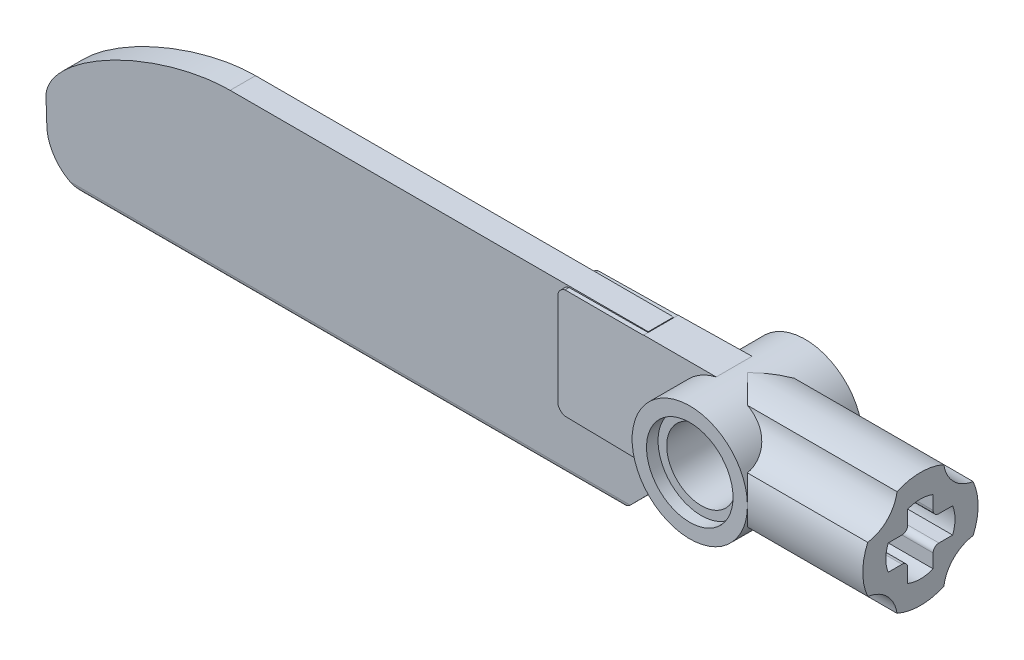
ISO-10303-21;
HEADER;
FILE_DESCRIPTION(('STEP AP214'),'2;1');
FILE_NAME('part.step','',(''),(''),'','','');
FILE_SCHEMA(('AUTOMOTIVE_DESIGN { 1 0 10303 214 1 1 1 1 }'));
ENDSEC;
DATA;
#1=APPLICATION_CONTEXT('core data for automotive mechanical design processes');
#2=APPLICATION_PROTOCOL_DEFINITION('international standard','automotive_design',2000,#1);
#3=PRODUCT_CONTEXT('',#1,'mechanical');
#4=PRODUCT('Part','Part','',(#3));
#5=PRODUCT_RELATED_PRODUCT_CATEGORY('part','',(#4));
#6=PRODUCT_DEFINITION_FORMATION('','',#4);
#7=PRODUCT_DEFINITION_CONTEXT('part definition',#1,'design');
#8=PRODUCT_DEFINITION('design','',#6,#7);
#9=PRODUCT_DEFINITION_SHAPE('','',#8);
#10=(LENGTH_UNIT() NAMED_UNIT(*) SI_UNIT(.MILLI.,.METRE.));
#11=(NAMED_UNIT(*) PLANE_ANGLE_UNIT() SI_UNIT($,.RADIAN.));
#12=(NAMED_UNIT(*) SI_UNIT($,.STERADIAN.) SOLID_ANGLE_UNIT());
#13=UNCERTAINTY_MEASURE_WITH_UNIT(LENGTH_MEASURE(1.E-05),#10,'distance_accuracy_value','');
#14=(GEOMETRIC_REPRESENTATION_CONTEXT(3) GLOBAL_UNCERTAINTY_ASSIGNED_CONTEXT((#13)) GLOBAL_UNIT_ASSIGNED_CONTEXT((#10,
#11,#12)) REPRESENTATION_CONTEXT('',''));
#15=CARTESIAN_POINT('',(0.,0.,0.));
#16=DIRECTION('',(0.,0.,1.));
#17=DIRECTION('',(1.,0.,0.));
#18=AXIS2_PLACEMENT_3D('',#15,#16,#17);
#19=CARTESIAN_POINT('',(-24.,0.,0.));
#20=DIRECTION('',(-1.,0.,0.));
#21=DIRECTION('',(0.,0.,1.));
#22=AXIS2_PLACEMENT_3D('',#19,#20,#21);
#23=PLANE('',#22);
#24=DIRECTION('',(0.,0.999481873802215,-0.0321867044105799));
#25=VECTOR('',#24,1.);
#26=CARTESIAN_POINT('',(-24.,-7.52093367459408,-0.512466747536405));
#27=LINE('',#26,#25);
#28=CARTESIAN_POINT('',(-24.,-3.29962198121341,-0.648407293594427));
#29=VERTEX_POINT('',#28);
#30=CARTESIAN_POINT('',(-24.,3.29945101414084,-0.860919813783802));
#31=VERTEX_POINT('',#30);
#32=EDGE_CURVE('E865',#29,#31,#27,.T.);
#33=ORIENTED_EDGE('',*,*,#32,.T.);
#34=DIRECTION('',(0.,0.0321867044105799,0.999481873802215));
#35=VECTOR('',#34,1.);
#36=CARTESIAN_POINT('',(-24.,3.18685591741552,-4.35729386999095));
#37=LINE('',#36,#35);
#38=CARTESIAN_POINT('',(-24.,3.29029372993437,-1.14527758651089));
#39=VERTEX_POINT('',#38);
#40=EDGE_CURVE('E457',#39,#31,#37,.T.);
#41=ORIENTED_EDGE('',*,*,#40,.F.);
#42=DIRECTION('',(0.,1.,0.));
#43=VECTOR('',#42,1.);
#44=CARTESIAN_POINT('',(-24.,3.9,-1.14527758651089));
#45=LINE('',#44,#43);
#46=CARTESIAN_POINT('',(-24.,-3.29962198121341,-1.1452775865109));
#47=VERTEX_POINT('',#46);
#48=EDGE_CURVE('E886',#47,#39,#45,.T.);
#49=ORIENTED_EDGE('',*,*,#48,.F.);
#50=CARTESIAN_POINT('',(-24.,-3.29962198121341,-0.623347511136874));
#51=CARTESIAN_POINT('',(-24.,-3.29962198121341,-0.807119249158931));
#52=CARTESIAN_POINT('',(-24.,-3.29962198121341,-0.990890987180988));
#53=CARTESIAN_POINT('',(-24.,-3.29962198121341,-1.17466272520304));
#54=(BOUNDED_CURVE() B_SPLINE_CURVE(3,(#50,#51,#52,#53),.UNSPECIFIED.,.F.,
.F.) B_SPLINE_CURVE_WITH_KNOTS((4,4),(-0.000626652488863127,-7.5337274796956E-05),
.UNSPECIFIED.) CURVE() GEOMETRIC_REPRESENTATION_ITEM() RATIONAL_B_SPLINE_CURVE((1.,1.,1.,1.)) REPRESENTATION_ITEM(''));
#55=EDGE_CURVE('E2031',#47,#29,#54,.F.);
#56=ORIENTED_EDGE('',*,*,#55,.T.);
#57=EDGE_LOOP('',(#33,#41,#49,#56));
#58=FACE_BOUND('',#57,.T.);
#59=ADVANCED_FACE('F42',(#58),#23,.T.);
#60=CARTESIAN_POINT('',(-12.,3.9,-1.25));
#61=DIRECTION('',(-0.00872653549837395,0.999961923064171,0.));
#62=DIRECTION('',(-0.999961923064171,-0.00872653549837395,0.));
#63=AXIS2_PLACEMENT_3D('',#60,#61,#62);
#64=PLANE('',#63);
#65=DIRECTION('',(0.,0.,-1.));
#66=VECTOR('',#65,1.);
#67=CARTESIAN_POINT('',(-18.,3.84763879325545,-1.25));
#68=LINE('',#67,#66);
#69=CARTESIAN_POINT('',(-18.,3.84763879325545,1.19763879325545));
#70=VERTEX_POINT('',#69);
#71=CARTESIAN_POINT('',(-18.,3.84763879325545,0.87857331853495));
#72=VERTEX_POINT('',#71);
#73=EDGE_CURVE('E443',#70,#72,#68,.T.);
#74=ORIENTED_EDGE('',*,*,#73,.F.);
#75=DIRECTION('',(0.99992385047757,0.00872620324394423,0.00872620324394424));
#76=VECTOR('',#75,1.);
#77=CARTESIAN_POINT('',(-12.0218138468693,3.89980963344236,1.24980963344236));
#78=LINE('',#77,#76);
#79=CARTESIAN_POINT('',(-12.9234691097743,3.89194100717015,1.24194100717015));
#80=VERTEX_POINT('',#79);
#81=EDGE_CURVE('E1139',#70,#80,#78,.T.);
#82=ORIENTED_EDGE('',*,*,#81,.T.);
#83=DIRECTION('',(0.,0.,1.));
#84=VECTOR('',#83,1.);
#85=CARTESIAN_POINT('',(-12.9234691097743,3.89194100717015,-4.));
#86=LINE('',#85,#84);
#87=CARTESIAN_POINT('',(-12.9234691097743,3.89194100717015,-1.24194100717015));
#88=VERTEX_POINT('',#87);
#89=EDGE_CURVE('E1946',#80,#88,#86,.F.);
#90=ORIENTED_EDGE('',*,*,#89,.T.);
#91=DIRECTION('',(0.99992385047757,0.00872620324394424,-0.00872620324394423));
#92=VECTOR('',#91,1.);
#93=CARTESIAN_POINT('',(-12.,3.9,-1.25));
#94=LINE('',#93,#92);
#95=CARTESIAN_POINT('',(-18.,3.84763879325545,-1.19763879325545));
#96=VERTEX_POINT('',#95);
#97=EDGE_CURVE('E2068',#96,#88,#94,.T.);
#98=ORIENTED_EDGE('',*,*,#97,.F.);
#99=DIRECTION('',(0.,0.,1.));
#100=VECTOR('',#99,1.);
#101=CARTESIAN_POINT('',(-18.,3.84763879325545,-1.25));
#102=LINE('',#101,#100);
#103=CARTESIAN_POINT('',(-18.,3.84763879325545,-0.87857331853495));
#104=VERTEX_POINT('',#103);
#105=EDGE_CURVE('E890',#96,#104,#102,.T.);
#106=ORIENTED_EDGE('',*,*,#105,.T.);
#107=EDGE_CURVE('E1115',#104,#72,#102,.T.);
#108=ORIENTED_EDGE('',*,*,#107,.T.);
#109=EDGE_LOOP('',(#74,#82,#90,#98,#106,#108));
#110=FACE_BOUND('',#109,.T.);
#111=ADVANCED_FACE('F1083',(#110),#64,.T.);
#112=CARTESIAN_POINT('',(-12.,3.9,-1.25));
#113=DIRECTION('',(-0.00872653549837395,0.,-0.999961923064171));
#114=DIRECTION('',(-0.999961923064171,0.,0.00872653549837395));
#115=AXIS2_PLACEMENT_3D('',#112,#113,#114);
#116=PLANE('',#115);
#117=ORIENTED_EDGE('',*,*,#48,.T.);
#118=CARTESIAN_POINT('',(-23.3467209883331,3.13350439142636,-1.15097866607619));
#119=DIRECTION('',(-0.00872653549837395,0.,-0.999961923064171));
#120=DIRECTION('',(-0.261539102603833,0.965190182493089,0.00228241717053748));
#121=AXIS2_PLACEMENT_3D('',#118,#119,#120);
#122=ELLIPSE('',#121,0.67214270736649,0.67176887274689);
#123=CARTESIAN_POINT('',(-23.5008225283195,3.7877414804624,-1.14963384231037));
#124=VERTEX_POINT('',#123);
#125=EDGE_CURVE('E461',#39,#124,#122,.T.);
#126=ORIENTED_EDGE('',*,*,#125,.T.);
#127=DIRECTION('',(0.999936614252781,0.00711469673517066,-0.00872631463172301));
#128=VECTOR('',#127,1.);
#129=CARTESIAN_POINT('',(-11.9997835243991,3.86957307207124,-1.25000188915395));
#130=LINE('',#129,#128);
#131=CARTESIAN_POINT('',(-18.,3.8268806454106,-1.19763879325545));
#132=VERTEX_POINT('',#131);
#133=EDGE_CURVE('E54',#124,#132,#130,.T.);
#134=ORIENTED_EDGE('',*,*,#133,.T.);
#135=DIRECTION('',(0.,1.,0.));
#136=VECTOR('',#135,1.);
#137=CARTESIAN_POINT('',(-18.,3.9,-1.19763879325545));
#138=LINE('',#137,#136);
#139=EDGE_CURVE('E464',#132,#96,#138,.T.);
#140=ORIENTED_EDGE('',*,*,#139,.T.);
#141=ORIENTED_EDGE('',*,*,#97,.T.);
#142=CARTESIAN_POINT('',(-12.,0.,-1.25));
#143=DIRECTION('',(-0.00872653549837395,0.,-0.999961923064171));
#144=DIRECTION('',(-0.999961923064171,0.,0.00872653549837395));
#145=AXIS2_PLACEMENT_3D('',#142,#143,#144);
#146=ELLIPSE('',#145,4.00015231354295,4.);
#147=CARTESIAN_POINT('',(-12.9234691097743,-3.89194100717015,-1.24194100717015));
#148=VERTEX_POINT('',#147);
#149=EDGE_CURVE('E1955',#88,#148,#146,.F.);
#150=ORIENTED_EDGE('',*,*,#149,.T.);
#151=DIRECTION('',(0.99992385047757,-0.00872620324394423,-0.00872620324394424));
#152=VECTOR('',#151,1.);
#153=CARTESIAN_POINT('',(-12.,-3.9,-1.25));
#154=LINE('',#153,#152);
#155=CARTESIAN_POINT('',(-23.5043632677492,-3.79960294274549,-1.14960294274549));
#156=VERTEX_POINT('',#155);
#157=EDGE_CURVE('E1132',#156,#148,#154,.T.);
#158=ORIENTED_EDGE('',*,*,#157,.F.);
#159=CARTESIAN_POINT('',(-24.,-3.29962198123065,-1.14527758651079));
#160=CARTESIAN_POINT('',(-23.9999999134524,-3.30188097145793,-1.14527758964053));
#161=CARTESIAN_POINT('',(-23.9999579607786,-3.30413975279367,-1.14527810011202));
#162=CARTESIAN_POINT('',(-23.9997923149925,-3.30874976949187,-1.14528006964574));
#163=CARTESIAN_POINT('',(-23.9996652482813,-3.31110088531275,-1.14528156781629));
#164=CARTESIAN_POINT('',(-23.9993251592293,-3.31589638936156,-1.14528551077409));
#165=CARTESIAN_POINT('',(-23.9991087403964,-3.31834053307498,-1.14528799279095));
#166=CARTESIAN_POINT('',(-23.9985855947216,-3.32332278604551,-1.14529390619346));
#167=CARTESIAN_POINT('',(-23.9982754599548,-3.32586053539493,-1.14529737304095));
#168=CARTESIAN_POINT('',(-23.9975605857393,-3.33103034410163,-1.14530525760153));
#169=CARTESIAN_POINT('',(-23.9971524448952,-3.33366193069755,-1.14530970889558));
#170=CARTESIAN_POINT('',(-23.9962372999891,-3.33901942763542,-1.1453195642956));
#171=CARTESIAN_POINT('',(-23.9957269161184,-3.34174475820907,-1.14532500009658));
#172=CARTESIAN_POINT('',(-23.9946031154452,-3.34728941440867,-1.14533682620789));
#173=CARTESIAN_POINT('',(-23.9939863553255,-3.35010806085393,-1.14534324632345));
#174=CARTESIAN_POINT('',(-23.9926457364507,-3.35583852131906,-1.14535704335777));
#175=CARTESIAN_POINT('',(-23.9919185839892,-3.35874956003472,-1.14536444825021));
#176=CARTESIAN_POINT('',(-23.9895253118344,-3.36779265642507,-1.14538855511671));
#177=CARTESIAN_POINT('',(-23.9877182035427,-3.37388775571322,-1.14540639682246));
#178=CARTESIAN_POINT('',(-23.983644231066,-3.38643420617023,-1.14544582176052));
#179=CARTESIAN_POINT('',(-23.9813528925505,-3.39287751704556,-1.14546758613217));
#180=CARTESIAN_POINT('',(-23.9762854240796,-3.40609874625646,-1.14551488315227));
#181=CARTESIAN_POINT('',(-23.9734864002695,-3.4128678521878,-1.1455405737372));
#182=CARTESIAN_POINT('',(-23.9673845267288,-3.42670983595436,-1.14559574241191));
#183=CARTESIAN_POINT('',(-23.964060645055,-3.43377339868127,-1.1456253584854));
#184=CARTESIAN_POINT('',(-23.9568970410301,-3.44816493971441,-1.14568839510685));
#185=CARTESIAN_POINT('',(-23.9530383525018,-3.45548344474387,-1.14572193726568));
#186=CARTESIAN_POINT('',(-23.9448015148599,-3.47033683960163,-1.14579283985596));
#187=CARTESIAN_POINT('',(-23.9404066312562,-3.47786242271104,-1.14583030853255));
#188=CARTESIAN_POINT('',(-23.9311031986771,-3.49307386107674,-1.14590907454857));
#189=CARTESIAN_POINT('',(-23.9261802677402,-3.5007509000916,-1.14595046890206));
#190=CARTESIAN_POINT('',(-23.9158367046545,-3.51620196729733,-1.14603709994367));
#191=CARTESIAN_POINT('',(-23.910404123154,-3.52396798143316,-1.14608242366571));
#192=CARTESIAN_POINT('',(-23.8990677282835,-3.53952792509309,-1.1461769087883));
#193=CARTESIAN_POINT('',(-23.8931544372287,-3.54731494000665,-1.14622614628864));
#194=CARTESIAN_POINT('',(-23.8808935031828,-3.56284372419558,-1.14632852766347));
#195=CARTESIAN_POINT('',(-23.8745388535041,-3.57057995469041,-1.14638173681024));
#196=CARTESIAN_POINT('',(-23.8614417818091,-3.5859321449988,-1.14649185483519));
#197=CARTESIAN_POINT('',(-23.8546947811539,-3.59354419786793,-1.14654880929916));
#198=CARTESIAN_POINT('',(-23.8408685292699,-3.60857276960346,-1.14666728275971));
#199=CARTESIAN_POINT('',(-23.8337870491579,-3.61598723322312,-1.14672883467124));
#200=CARTESIAN_POINT('',(-23.8150987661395,-3.63484248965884,-1.14689003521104));
#201=CARTESIAN_POINT('',(-23.8032853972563,-3.64607992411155,-1.14699074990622));
#202=CARTESIAN_POINT('',(-23.77982992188,-3.6670902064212,-1.14718561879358));
#203=CARTESIAN_POINT('',(-23.7682304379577,-3.67691069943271,-1.14727975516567));
#204=CARTESIAN_POINT('',(-23.7454879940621,-3.69504466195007,-1.14746302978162));
#205=CARTESIAN_POINT('',(-23.734390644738,-3.70341520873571,-1.14755190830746));
#206=CARTESIAN_POINT('',(-23.7128607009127,-3.718693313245,-1.14772445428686));
#207=CARTESIAN_POINT('',(-23.7024726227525,-3.72566346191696,-1.14780775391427));
#208=CARTESIAN_POINT('',(-23.6824939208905,-3.73824692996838,-1.14796933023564));
#209=CARTESIAN_POINT('',(-23.672944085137,-3.74392480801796,-1.14804712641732));
#210=CARTESIAN_POINT('',(-23.654710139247,-3.75406720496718,-1.14819774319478));
#211=CARTESIAN_POINT('',(-23.6460615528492,-3.75859535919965,-1.14827002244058));
#212=CARTESIAN_POINT('',(-23.6296479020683,-3.76659871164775,-1.14840963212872));
#213=CARTESIAN_POINT('',(-23.6219124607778,-3.77013441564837,-1.14847640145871));
#214=CARTESIAN_POINT('',(-23.6073066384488,-3.77631505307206,-1.14860497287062));
#215=CARTESIAN_POINT('',(-23.6004599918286,-3.77901582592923,-1.1486662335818));
#216=CARTESIAN_POINT('',(-23.5875895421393,-3.78368054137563,-1.1487837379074));
#217=CARTESIAN_POINT('',(-23.5815840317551,-3.78569471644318,-1.14883949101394));
#218=CARTESIAN_POINT('',(-23.5703399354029,-3.78912611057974,-1.14894590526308));
#219=CARTESIAN_POINT('',(-23.5651149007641,-3.79058751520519,-1.14899614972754));
#220=CARTESIAN_POINT('',(-23.5553696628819,-3.7930364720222,-1.14909145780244));
#221=CARTESIAN_POINT('',(-23.5508590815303,-3.79406211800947,-1.14913619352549));
#222=CARTESIAN_POINT('',(-23.5424797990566,-3.79574528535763,-1.14922038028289));
#223=CARTESIAN_POINT('',(-23.5386176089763,-3.79643505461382,-1.14925960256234));
#224=CARTESIAN_POINT('',(-23.5314748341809,-3.79753551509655,-1.14933266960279));
#225=CARTESIAN_POINT('',(-23.528198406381,-3.79797304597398,-1.14936638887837));
#226=CARTESIAN_POINT('',(-23.5221717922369,-3.79864276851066,-1.14942830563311));
#227=CARTESIAN_POINT('',(-23.5194240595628,-3.79889693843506,-1.14945649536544));
#228=CARTESIAN_POINT('',(-23.514405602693,-3.79926010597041,-1.14950733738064));
#229=CARTESIAN_POINT('',(-23.5121361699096,-3.79938679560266,-1.14953008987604));
#230=CARTESIAN_POINT('',(-23.5080320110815,-3.7995431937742,-1.14956964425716));
#231=CARTESIAN_POINT('',(-23.506197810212,-3.79958688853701,-1.14958674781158));
#232=CARTESIAN_POINT('',(-23.5043632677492,-3.79960294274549,-1.14960294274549));
#233=B_SPLINE_CURVE_WITH_KNOTS('',3,(#159,#160,#161,#162,#163,#164,#165,#166,#167,#168,#169,
#170,#171,#172,#173,#174,#175,#176,#177,#178,#179,#180,#181,#182,#183,#184,#185,#186,#187,#188,
#189,#190,#191,#192,#193,#194,#195,#196,#197,#198,#199,#200,#201,#202,#203,#204,#205,#206,#207,
#208,#209,#210,#211,#212,#213,#214,#215,#216,#217,#218,#219,#220,#221,#222,#223,#224,#225,#226,
#227,#228,#229,#230,#231,#232),.UNSPECIFIED.,.F.,.F.,(4,2,2,2,2,2,2,2,2,2,2,2,2,2,2,2,2,2,2,2,2,
2,2,2,2,2,2,2,2,2,2,2,2,2,2,2,4),(0.,0.00677628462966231,0.0138384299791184,0.0211981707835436,
0.0288666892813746,0.0368545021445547,0.0451713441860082,0.0538260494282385,0.0628264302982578,
0.0818878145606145,0.102394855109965,0.124361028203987,0.147772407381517,0.172584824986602,
0.19872189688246,0.226074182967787,0.254499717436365,0.283826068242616,0.313853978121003,
0.344362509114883,0.375115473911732,0.423999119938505,0.469570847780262,0.511250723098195,
0.548762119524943,0.582077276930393,0.611350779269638,0.636855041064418,0.658925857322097,
0.677921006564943,0.694191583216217,0.708064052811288,0.719830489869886,0.729744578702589,
0.738021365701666,0.744839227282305,0.750342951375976),.UNSPECIFIED.);
#234=EDGE_CURVE('E2027',#156,#47,#233,.F.);
#235=ORIENTED_EDGE('',*,*,#234,.T.);
#236=EDGE_LOOP('',(#117,#126,#134,#140,#141,#150,#158,#235));
#237=FACE_BOUND('',#236,.T.);
#238=ADVANCED_FACE('F676',(#237),#116,.T.);
#239=CARTESIAN_POINT('',(-12.,-3.9,-1.25));
#240=DIRECTION('',(-0.00872653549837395,-0.999961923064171,0.));
#241=DIRECTION('',(0.999961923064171,-0.00872653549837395,0.));
#242=AXIS2_PLACEMENT_3D('',#239,#240,#241);
#243=PLANE('',#242);
#244=CARTESIAN_POINT('',(-15.5775370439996,-3.86877930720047,-0.693216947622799));
#245=CARTESIAN_POINT('',(-15.5775370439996,-3.86877930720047,-0.231072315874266));
#246=CARTESIAN_POINT('',(-15.5775370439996,-3.86877930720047,0.231072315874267));
#247=CARTESIAN_POINT('',(-15.5775370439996,-3.86877930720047,0.6932169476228));
#248=(BOUNDED_CURVE() B_SPLINE_CURVE(3,(#244,#245,#246,#247),.UNSPECIFIED.,.F.,
.F.) B_SPLINE_CURVE_WITH_KNOTS((4,4),(-0.0019432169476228,-0.000556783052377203),
.UNSPECIFIED.) CURVE() GEOMETRIC_REPRESENTATION_ITEM() RATIONAL_B_SPLINE_CURVE((1.,1.,1.,1.)) REPRESENTATION_ITEM(''));
#249=CARTESIAN_POINT('',(-15.5775370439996,-3.86877930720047,0.630078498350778));
#250=VERTEX_POINT('',#249);
#251=CARTESIAN_POINT('',(-15.5775370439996,-3.86877930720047,-0.630078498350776));
#252=VERTEX_POINT('',#251);
#253=EDGE_CURVE('E659',#250,#252,#248,.F.);
#254=ORIENTED_EDGE('',*,*,#253,.T.);
#255=DIRECTION('',(-0.999961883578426,0.00872653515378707,-0.000281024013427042));
#256=VECTOR('',#255,1.);
#257=CARTESIAN_POINT('',(-12.0001744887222,-3.89999847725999,-0.629073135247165));
#258=LINE('',#257,#256);
#259=CARTESIAN_POINT('',(-18.,-3.84763879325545,-0.630759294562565));
#260=VERTEX_POINT('',#259);
#261=EDGE_CURVE('E830',#252,#260,#258,.T.);
#262=ORIENTED_EDGE('',*,*,#261,.T.);
#263=DIRECTION('',(0.,0.,-1.));
#264=VECTOR('',#263,1.);
#265=CARTESIAN_POINT('',(-18.,-3.84763879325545,-1.25));
#266=LINE('',#265,#264);
#267=CARTESIAN_POINT('',(-18.,-3.84763879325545,-0.879999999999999));
#268=VERTEX_POINT('',#267);
#269=EDGE_CURVE('E1957',#260,#268,#266,.T.);
#270=ORIENTED_EDGE('',*,*,#269,.T.);
#271=DIRECTION('',(0.999961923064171,-0.00872653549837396,0.));
#272=VECTOR('',#271,1.);
#273=CARTESIAN_POINT('',(-12.,-3.9,-0.88));
#274=LINE('',#273,#272);
#275=CARTESIAN_POINT('',(-23.5043632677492,-3.79960294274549,-0.88));
#276=VERTEX_POINT('',#275);
#277=EDGE_CURVE('E1136',#276,#268,#274,.T.);
#278=ORIENTED_EDGE('',*,*,#277,.F.);
#279=CARTESIAN_POINT('',(-23.5043632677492,-3.79960294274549,-1.17466272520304));
#280=CARTESIAN_POINT('',(-23.5043632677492,-3.79960294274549,-0.990890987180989));
#281=CARTESIAN_POINT('',(-23.5043632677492,-3.79960294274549,-0.80711924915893));
#282=CARTESIAN_POINT('',(-23.5043632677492,-3.79960294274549,-0.623347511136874));
#283=(BOUNDED_CURVE() B_SPLINE_CURVE(3,(#279,#280,#281,#282),.UNSPECIFIED.,.F.,
.F.) B_SPLINE_CURVE_WITH_KNOTS((4,4),(-0.000626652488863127,-7.5337274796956E-05),
.UNSPECIFIED.) CURVE() GEOMETRIC_REPRESENTATION_ITEM() RATIONAL_B_SPLINE_CURVE((1.,1.,1.,1.)) REPRESENTATION_ITEM(''));
#284=EDGE_CURVE('E2030',#276,#156,#283,.F.);
#285=ORIENTED_EDGE('',*,*,#284,.T.);
#286=ORIENTED_EDGE('',*,*,#157,.T.);
#287=DIRECTION('',(0.,0.,1.));
#288=VECTOR('',#287,1.);
#289=CARTESIAN_POINT('',(-12.9234691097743,-3.89194100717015,-4.));
#290=LINE('',#289,#288);
#291=CARTESIAN_POINT('',(-12.9234691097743,-3.89194100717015,1.24194100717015));
#292=VERTEX_POINT('',#291);
#293=EDGE_CURVE('E1951',#148,#292,#290,.T.);
#294=ORIENTED_EDGE('',*,*,#293,.T.);
#295=DIRECTION('',(0.99992385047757,-0.00872620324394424,0.00872620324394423));
#296=VECTOR('',#295,1.);
#297=CARTESIAN_POINT('',(-12.0680592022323,-3.89940605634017,1.24940605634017));
#298=LINE('',#297,#296);
#299=CARTESIAN_POINT('',(-23.5043632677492,-3.79960294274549,1.14960294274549));
#300=VERTEX_POINT('',#299);
#301=EDGE_CURVE('E1135',#300,#292,#298,.T.);
#302=ORIENTED_EDGE('',*,*,#301,.F.);
#303=CARTESIAN_POINT('',(-23.5043632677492,-3.79960294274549,0.623347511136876));
#304=CARTESIAN_POINT('',(-23.5043632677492,-3.79960294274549,0.807119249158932));
#305=CARTESIAN_POINT('',(-23.5043632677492,-3.79960294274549,0.990890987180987));
#306=CARTESIAN_POINT('',(-23.5043632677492,-3.79960294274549,1.17466272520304));
#307=(BOUNDED_CURVE() B_SPLINE_CURVE(3,(#303,#304,#305,#306),.UNSPECIFIED.,.F.,
.F.) B_SPLINE_CURVE_WITH_KNOTS((4,4),(-0.00242466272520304,-0.00187334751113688),
.UNSPECIFIED.) CURVE() GEOMETRIC_REPRESENTATION_ITEM() RATIONAL_B_SPLINE_CURVE((1.,1.,1.,1.)) REPRESENTATION_ITEM(''));
#308=CARTESIAN_POINT('',(-23.5043632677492,-3.79960294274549,0.88));
#309=VERTEX_POINT('',#308);
#310=EDGE_CURVE('E1999',#300,#309,#307,.F.);
#311=ORIENTED_EDGE('',*,*,#310,.T.);
#312=DIRECTION('',(-0.999961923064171,0.00872653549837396,0.));
#313=VECTOR('',#312,1.);
#314=CARTESIAN_POINT('',(-12.,-3.9,0.88));
#315=LINE('',#314,#313);
#316=CARTESIAN_POINT('',(-18.,-3.84763879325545,0.88));
#317=VERTEX_POINT('',#316);
#318=EDGE_CURVE('E1140',#317,#309,#315,.T.);
#319=ORIENTED_EDGE('',*,*,#318,.F.);
#320=CARTESIAN_POINT('',(-18.,-3.84763879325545,0.630759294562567));
#321=VERTEX_POINT('',#320);
#322=EDGE_CURVE('E1143',#317,#321,#266,.T.);
#323=ORIENTED_EDGE('',*,*,#322,.T.);
#324=DIRECTION('',(0.999961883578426,-0.00872653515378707,-0.000281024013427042));
#325=VECTOR('',#324,1.);
#326=CARTESIAN_POINT('',(-11.9994719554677,-3.90000460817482,0.629072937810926));
#327=LINE('',#326,#325);
#328=EDGE_CURVE('E837',#321,#250,#327,.T.);
#329=ORIENTED_EDGE('',*,*,#328,.T.);
#330=EDGE_LOOP('',(#254,#262,#270,#278,#285,#286,#294,#302,#311,#319,#323,#329));
#331=FACE_BOUND('',#330,.T.);
#332=ADVANCED_FACE('F666',(#331),#243,.T.);
#333=CARTESIAN_POINT('',(-60.,0.,0.));
#334=DIRECTION('',(-1.,0.,0.));
#335=DIRECTION('',(0.,0.,1.));
#336=AXIS2_PLACEMENT_3D('',#333,#334,#335);
#337=PLANE('',#336);
#338=DIRECTION('',(0.,0.,-1.));
#339=VECTOR('',#338,1.);
#340=CARTESIAN_POINT('',(-60.,-4.90805899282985,0.));
#341=LINE('',#340,#339);
#342=CARTESIAN_POINT('',(-60.,-4.90805899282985,-0.596610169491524));
#343=VERTEX_POINT('',#342);
#344=CARTESIAN_POINT('',(-60.,-4.90805899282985,0.596610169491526));
#345=VERTEX_POINT('',#344);
#346=EDGE_CURVE('E1153',#343,#345,#341,.F.);
#347=ORIENTED_EDGE('',*,*,#346,.T.);
#348=DIRECTION('',(0.,0.999481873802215,0.0321867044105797));
#349=VECTOR('',#348,1.);
#350=CARTESIAN_POINT('',(-60.,-0.0242776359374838,0.7538844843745));
#351=LINE('',#350,#349);
#352=CARTESIAN_POINT('',(-60.,-3.10805899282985,0.654576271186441));
#353=VERTEX_POINT('',#352);
#354=EDGE_CURVE('E1166',#345,#353,#351,.T.);
#355=ORIENTED_EDGE('',*,*,#354,.T.);
#356=CARTESIAN_POINT('',(-60.,-3.10805899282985,-0.968000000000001));
#357=CARTESIAN_POINT('',(-60.,-3.10805899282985,-0.322666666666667));
#358=CARTESIAN_POINT('',(-60.,-3.10805899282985,0.322666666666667));
#359=CARTESIAN_POINT('',(-60.,-3.10805899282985,0.968));
#360=(BOUNDED_CURVE() B_SPLINE_CURVE(3,(#356,#357,#358,#359),.UNSPECIFIED.,.F.,
.F.) B_SPLINE_CURVE_WITH_KNOTS((4,4),(-8.80000000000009E-05,0.001848),
.UNSPECIFIED.) CURVE() GEOMETRIC_REPRESENTATION_ITEM() RATIONAL_B_SPLINE_CURVE((1.,1.,1.,1.)) REPRESENTATION_ITEM(''));
#361=CARTESIAN_POINT('',(-60.,-3.10805899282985,-0.65457627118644));
#362=VERTEX_POINT('',#361);
#363=EDGE_CURVE('E1197',#353,#362,#360,.F.);
#364=ORIENTED_EDGE('',*,*,#363,.T.);
#365=DIRECTION('',(0.,-0.999481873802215,0.0321867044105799));
#366=VECTOR('',#365,1.);
#367=CARTESIAN_POINT('',(-60.,-0.0242776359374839,-0.7538844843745));
#368=LINE('',#367,#366);
#369=EDGE_CURVE('E1174',#362,#343,#368,.T.);
#370=ORIENTED_EDGE('',*,*,#369,.T.);
#371=EDGE_LOOP('',(#347,#355,#364,#370));
#372=FACE_BOUND('',#371,.T.);
#373=ADVANCED_FACE('F540',(#372),#337,.T.);
#374=CARTESIAN_POINT('',(-57.,-4.90805899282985,-0.880000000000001));
#375=DIRECTION('',(0.,0.,-1.));
#376=DIRECTION('',(-1.,0.,0.));
#377=AXIS2_PLACEMENT_3D('',#374,#375,#376);
#378=CYLINDRICAL_SURFACE('',#377,3.);
#379=CARTESIAN_POINT('',(-58.4740711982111,-7.52093367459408,0.512466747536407));
#380=CARTESIAN_POINT('',(-58.4292231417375,-7.54624212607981,0.511602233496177));
#381=CARTESIAN_POINT('',(-58.3838133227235,-7.57033132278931,0.508476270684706));
#382=CARTESIAN_POINT('',(-58.2922340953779,-7.61596080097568,0.4985626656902));
#383=CARTESIAN_POINT('',(-58.2460665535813,-7.63750651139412,0.49178300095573));
#384=CARTESIAN_POINT('',(-58.1533457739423,-7.67795875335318,0.475448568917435));
#385=CARTESIAN_POINT('',(-58.1067951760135,-7.69687663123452,0.465906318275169));
#386=CARTESIAN_POINT('',(-58.0132262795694,-7.7322181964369,0.444605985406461));
#387=CARTESIAN_POINT('',(-57.9662076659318,-7.74864006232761,0.432846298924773));
#388=CARTESIAN_POINT('',(-57.8442733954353,-7.78787961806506,0.400215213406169));
#389=CARTESIAN_POINT('',(-57.7691013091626,-7.80883194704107,0.378033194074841));
#390=CARTESIAN_POINT('',(-57.6182606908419,-7.84468500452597,0.330763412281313));
#391=CARTESIAN_POINT('',(-57.5425919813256,-7.85958343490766,0.305674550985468));
#392=CARTESIAN_POINT('',(-57.315017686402,-7.89542266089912,0.227672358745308));
#393=CARTESIAN_POINT('',(-57.1625056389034,-7.90751950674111,0.172012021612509));
#394=CARTESIAN_POINT('',(-57.0068597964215,-7.9080531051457,0.115178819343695));
#395=CARTESIAN_POINT('',(-57.0034298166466,-7.90805898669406,0.113926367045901));
#396=CARTESIAN_POINT('',(-57.,-7.90805899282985,0.112673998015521));
#397=B_SPLINE_CURVE_WITH_KNOTS('',3,(#379,#380,#381,#382,#383,#384,#385,#386,#387,#388,#389,
#390,#391,#392,#393,#394,#395,#396),.UNSPECIFIED.,.F.,.F.,(4,2,2,2,2,2,2,2,4),(0.,
0.154340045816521,0.308344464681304,0.461661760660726,0.61509040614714,0.858118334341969,
1.10123843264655,1.58735459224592,1.59830905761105),.UNSPECIFIED.);
#398=CARTESIAN_POINT('',(-57.,-7.90805899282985,0.112673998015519));
#399=VERTEX_POINT('',#398);
#400=CARTESIAN_POINT('',(-58.4740711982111,-7.52093367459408,0.512466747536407));
#401=VERTEX_POINT('',#400);
#402=EDGE_CURVE('E521',#399,#401,#397,.F.);
#403=ORIENTED_EDGE('',*,*,#402,.T.);
#404=CARTESIAN_POINT('',(-57.,-4.90805899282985,0.596610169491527));
#405=DIRECTION('',(0.,-0.0321867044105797,0.999481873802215));
#406=DIRECTION('',(0.,-0.999481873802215,-0.0321867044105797));
#407=AXIS2_PLACEMENT_3D('',#404,#405,#406);
#408=ELLIPSE('',#407,3.00155518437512,3.);
#409=EDGE_CURVE('E1163',#401,#345,#408,.F.);
#410=ORIENTED_EDGE('',*,*,#409,.T.);
#411=ORIENTED_EDGE('',*,*,#346,.F.);
#412=CARTESIAN_POINT('',(-57.,-4.90805899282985,-0.596610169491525));
#413=DIRECTION('',(0.,-0.0321867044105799,-0.999481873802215));
#414=DIRECTION('',(0.,0.999481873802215,-0.0321867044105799));
#415=AXIS2_PLACEMENT_3D('',#412,#413,#414);
#416=ELLIPSE('',#415,3.00155518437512,3.);
#417=CARTESIAN_POINT('',(-58.4740711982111,-7.52093367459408,-0.512466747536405));
#418=VERTEX_POINT('',#417);
#419=EDGE_CURVE('E1171',#343,#418,#416,.F.);
#420=ORIENTED_EDGE('',*,*,#419,.T.);
#421=CARTESIAN_POINT('',(-58.4740711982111,-7.52093367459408,-0.512466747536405));
#422=CARTESIAN_POINT('',(-58.4292231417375,-7.54624212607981,-0.511602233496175));
#423=CARTESIAN_POINT('',(-58.3838133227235,-7.57033132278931,-0.508476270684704));
#424=CARTESIAN_POINT('',(-58.2922340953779,-7.61596080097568,-0.498562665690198));
#425=CARTESIAN_POINT('',(-58.2460665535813,-7.63750651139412,-0.491783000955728));
#426=CARTESIAN_POINT('',(-58.1533457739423,-7.67795875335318,-0.475448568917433));
#427=CARTESIAN_POINT('',(-58.1067951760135,-7.69687663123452,-0.465906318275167));
#428=CARTESIAN_POINT('',(-58.0132262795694,-7.7322181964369,-0.444605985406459));
#429=CARTESIAN_POINT('',(-57.9662076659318,-7.74864006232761,-0.432846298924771));
#430=CARTESIAN_POINT('',(-57.8442733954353,-7.78787961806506,-0.400215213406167));
#431=CARTESIAN_POINT('',(-57.7691013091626,-7.80883194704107,-0.378033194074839));
#432=CARTESIAN_POINT('',(-57.6182606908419,-7.84468500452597,-0.330763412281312));
#433=CARTESIAN_POINT('',(-57.5425919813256,-7.85958343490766,-0.305674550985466));
#434=CARTESIAN_POINT('',(-57.315017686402,-7.89542266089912,-0.227672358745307));
#435=CARTESIAN_POINT('',(-57.1625056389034,-7.90751950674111,-0.172012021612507));
#436=CARTESIAN_POINT('',(-57.0068597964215,-7.9080531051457,-0.115178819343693));
#437=CARTESIAN_POINT('',(-57.0034298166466,-7.90805898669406,-0.113926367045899));
#438=CARTESIAN_POINT('',(-57.,-7.90805899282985,-0.112673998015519));
#439=B_SPLINE_CURVE_WITH_KNOTS('',3,(#421,#422,#423,#424,#425,#426,#427,#428,#429,#430,#431,
#432,#433,#434,#435,#436,#437,#438),.UNSPECIFIED.,.F.,.F.,(4,2,2,2,2,2,2,2,4),(0.,
0.154340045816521,0.308344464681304,0.461661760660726,0.61509040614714,0.858118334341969,
1.10123843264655,1.58735459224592,1.59830905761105),.UNSPECIFIED.);
#440=CARTESIAN_POINT('',(-57.,-7.90805899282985,-0.112673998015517));
#441=VERTEX_POINT('',#440);
#442=EDGE_CURVE('E512',#418,#441,#439,.T.);
#443=ORIENTED_EDGE('',*,*,#442,.T.);
#444=DIRECTION('',(0.,0.,-1.));
#445=VECTOR('',#444,1.);
#446=CARTESIAN_POINT('',(-57.,-7.90805899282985,-0.880000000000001));
#447=LINE('',#446,#445);
#448=EDGE_CURVE('E1150',#399,#441,#447,.T.);
#449=ORIENTED_EDGE('',*,*,#448,.F.);
#450=EDGE_LOOP('',(#403,#410,#411,#420,#443,#449));
#451=FACE_BOUND('',#450,.T.);
#452=ADVANCED_FACE('F535',(#451),#378,.T.);
#453=CARTESIAN_POINT('',(-47.,3.89194100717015,-0.968000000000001));
#454=CARTESIAN_POINT('',(-47.,3.89194100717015,-0.322666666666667));
#455=CARTESIAN_POINT('',(-47.,3.89194100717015,0.322666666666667));
#456=CARTESIAN_POINT('',(-47.,3.89194100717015,0.968));
#457=CARTESIAN_POINT('',(-60.,3.89194100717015,-0.968000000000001));
#458=CARTESIAN_POINT('',(-60.,3.89194100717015,-0.322666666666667));
#459=CARTESIAN_POINT('',(-60.,3.89194100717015,0.322666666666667));
#460=CARTESIAN_POINT('',(-60.,3.89194100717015,0.968));
#461=CARTESIAN_POINT('',(-60.,-3.10805899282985,-0.968000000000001));
#462=CARTESIAN_POINT('',(-60.,-3.10805899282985,-0.322666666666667));
#463=CARTESIAN_POINT('',(-60.,-3.10805899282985,0.322666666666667));
#464=CARTESIAN_POINT('',(-60.,-3.10805899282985,0.968));
#465=(BOUNDED_SURFACE() B_SPLINE_SURFACE(2,3,((#453,#454,#455,#456),(#457,#458,#459,#460),(#461,
#462,#463,#464)),.UNSPECIFIED.,.F.,.F.,.F.) B_SPLINE_SURFACE_WITH_KNOTS((3,3),(4,4),(0.,1.),
(-8.80000000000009E-05,0.001848),
.UNSPECIFIED.) GEOMETRIC_REPRESENTATION_ITEM() RATIONAL_B_SPLINE_SURFACE(((1.,1.,1.,1.),
(0.428571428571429,0.428571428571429,0.428571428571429,0.428571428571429),(1.,1.,1.,1.))) REPRESENTATION_ITEM('') SURFACE());
#466=CARTESIAN_POINT('',(-60.,-3.10805899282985,0.654576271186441));
#467=CARTESIAN_POINT('',(-59.9999971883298,-3.04793057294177,0.65651261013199));
#468=CARTESIAN_POINT('',(-59.996084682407,-2.98793499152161,0.658444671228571));
#469=CARTESIAN_POINT('',(-59.9815801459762,-2.86898393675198,0.662275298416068));
#470=CARTESIAN_POINT('',(-59.9710153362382,-2.81002522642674,0.664173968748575));
#471=CARTESIAN_POINT('',(-59.9445598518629,-2.69443815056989,0.667896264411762));
#472=CARTESIAN_POINT('',(-59.9287649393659,-2.63778709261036,0.669720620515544));
#473=CARTESIAN_POINT('',(-59.8926872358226,-2.52587355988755,0.673324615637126));
#474=CARTESIAN_POINT('',(-59.8723989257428,-2.47061288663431,0.675104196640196));
#475=CARTESIAN_POINT('',(-59.81593528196,-2.33168059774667,0.679578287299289));
#476=CARTESIAN_POINT('',(-59.7771534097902,-2.24906962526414,0.682238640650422));
#477=CARTESIAN_POINT('',(-59.6928022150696,-2.08743231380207,0.68744391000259));
#478=CARTESIAN_POINT('',(-59.6472310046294,-2.00840697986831,0.689988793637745));
#479=CARTESIAN_POINT('',(-59.550297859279,-1.85288154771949,0.694997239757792));
#480=CARTESIAN_POINT('',(-59.4988811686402,-1.77641579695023,0.697459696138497));
#481=CARTESIAN_POINT('',(-59.3917549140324,-1.62659451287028,0.702284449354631));
#482=CARTESIAN_POINT('',(-59.3360459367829,-1.55323855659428,0.704646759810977));
#483=CARTESIAN_POINT('',(-59.1695847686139,-1.34473463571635,0.711361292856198));
#484=CARTESIAN_POINT('',(-59.0542956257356,-1.21320210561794,0.71559708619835));
#485=CARTESIAN_POINT('',(-58.8146836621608,-0.958396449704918,0.723802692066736));
#486=CARTESIAN_POINT('',(-58.6903469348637,-0.835136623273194,0.727772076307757));
#487=CARTESIAN_POINT('',(-58.4348456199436,-0.595751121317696,0.735481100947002));
#488=CARTESIAN_POINT('',(-58.3036762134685,-0.479630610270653,0.739220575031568));
#489=CARTESIAN_POINT('',(-58.0357328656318,-0.253448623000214,0.746504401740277));
#490=CARTESIAN_POINT('',(-57.8989469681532,-0.143401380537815,0.750048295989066));
#491=CARTESIAN_POINT('',(-57.6211656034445,0.0709498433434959,0.756951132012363));
#492=CARTESIAN_POINT('',(-57.4801742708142,0.175259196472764,0.760310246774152));
#493=CARTESIAN_POINT('',(-57.1945869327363,0.378758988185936,0.766863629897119));
#494=CARTESIAN_POINT('',(-57.0499915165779,0.477950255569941,0.770057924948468));
#495=CARTESIAN_POINT('',(-56.7472321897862,0.678572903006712,0.776518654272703));
#496=CARTESIAN_POINT('',(-56.5888378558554,0.779656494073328,0.779773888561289));
#497=CARTESIAN_POINT('',(-56.2689543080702,0.976817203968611,0.786123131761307));
#498=CARTESIAN_POINT('',(-56.1074648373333,1.07289390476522,0.789217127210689));
#499=CARTESIAN_POINT('',(-55.6186373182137,1.35422478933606,0.798276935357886));
#500=CARTESIAN_POINT('',(-55.2872020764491,1.53240813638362,0.804015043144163));
#501=CARTESIAN_POINT('',(-54.615413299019,1.87140689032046,0.814931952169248));
#502=CARTESIAN_POINT('',(-54.2750554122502,2.03221362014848,0.820110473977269));
#503=CARTESIAN_POINT('',(-53.5879842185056,2.33641411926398,0.82990676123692));
#504=CARTESIAN_POINT('',(-53.241295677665,2.47986376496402,0.834526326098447));
#505=CARTESIAN_POINT('',(-52.5415728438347,2.74970044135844,0.843215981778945));
#506=CARTESIAN_POINT('',(-52.188542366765,2.87609736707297,0.847286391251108));
#507=CARTESIAN_POINT('',(-51.4765737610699,3.11099849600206,0.854851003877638));
#508=CARTESIAN_POINT('',(-51.1176364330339,3.21950510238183,0.858345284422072));
#509=CARTESIAN_POINT('',(-50.6028688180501,3.35985250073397,0.862864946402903));
#510=CARTESIAN_POINT('',(-50.4492310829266,3.39983098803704,0.864152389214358));
#511=CARTESIAN_POINT('',(-50.1410326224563,3.47600171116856,0.866605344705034));
#512=CARTESIAN_POINT('',(-49.9864720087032,3.51219439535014,0.867770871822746));
#513=CARTESIAN_POINT('',(-49.6765102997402,3.58051605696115,0.869971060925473));
#514=CARTESIAN_POINT('',(-49.5211095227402,3.61264647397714,0.871005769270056));
#515=CARTESIAN_POINT('',(-49.2095291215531,3.67250047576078,0.87293327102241));
#516=CARTESIAN_POINT('',(-49.0533498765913,3.70022602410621,0.873826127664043));
#517=CARTESIAN_POINT('',(-48.7401510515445,3.7508594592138,0.87545669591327));
#518=CARTESIAN_POINT('',(-48.5831312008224,3.77376568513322,0.876194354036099));
#519=CARTESIAN_POINT('',(-48.2683698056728,3.81418758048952,0.877496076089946));
#520=CARTESIAN_POINT('',(-48.1106281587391,3.83170245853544,0.878060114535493));
#521=CARTESIAN_POINT('',(-47.7944306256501,3.860615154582,0.878991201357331));
#522=CARTESIAN_POINT('',(-47.6359742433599,3.872007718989,0.879358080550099));
#523=CARTESIAN_POINT('',(-47.3978546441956,3.88375308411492,0.87973632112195));
#524=CARTESIAN_POINT('',(-47.3183199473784,3.88677800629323,0.879833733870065));
#525=CARTESIAN_POINT('',(-47.1591923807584,3.89086988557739,0.879965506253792));
#526=CARTESIAN_POINT('',(-47.0795995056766,3.89193663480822,0.879999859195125));
#527=CARTESIAN_POINT('',(-47.,3.89194100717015,0.880000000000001));
#528=B_SPLINE_CURVE_WITH_KNOTS('',3,(#466,#467,#468,#469,#470,#471,#472,#473,#474,#475,#476,
#477,#478,#479,#480,#481,#482,#483,#484,#485,#486,#487,#488,#489,#490,#491,#492,#493,#494,#495,
#496,#497,#498,#499,#500,#501,#502,#503,#504,#505,#506,#507,#508,#509,#510,#511,#512,#513,#514,
#515,#516,#517,#518,#519,#520,#521,#522,#523,#524,#525,#526,#527),.UNSPECIFIED.,.F.,.F.,(4,2,2,
2,2,2,2,2,2,2,2,2,2,2,2,2,2,2,2,2,2,2,2,2,2,2,2,2,2,2,4),(0.,0.180161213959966,
0.359589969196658,0.53590002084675,0.712427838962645,0.985883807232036,1.25941595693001,
1.53576243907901,1.81207121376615,2.33630811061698,2.86136853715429,3.38680442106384,
3.91342357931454,4.43954102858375,4.96557301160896,5.52925441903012,6.0929828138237,
7.2213776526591,8.35033337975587,9.47555217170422,10.6001152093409,11.724527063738,
12.2007681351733,12.6769527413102,13.1529681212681,13.6287707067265,14.1047369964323,
14.5807731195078,15.0572170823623,15.2959724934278,15.5347532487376),.UNSPECIFIED.);
#529=CARTESIAN_POINT('',(-47.,3.89194100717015,0.88));
#530=VERTEX_POINT('',#529);
#531=EDGE_CURVE('E522',#353,#530,#528,.T.);
#532=CARTESIAN_POINT('',(-47.,3.89194100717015,0.968));
#533=CARTESIAN_POINT('',(-47.,3.89194100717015,0.322666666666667));
#534=CARTESIAN_POINT('',(-47.,3.89194100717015,-0.322666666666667));
#535=CARTESIAN_POINT('',(-47.,3.89194100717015,-0.968000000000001));
#536=(BOUNDED_CURVE() B_SPLINE_CURVE(3,(#532,#533,#534,#535),.UNSPECIFIED.,.F.,
.F.) B_SPLINE_CURVE_WITH_KNOTS((4,4),(-8.80000000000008E-05,0.001848),
.UNSPECIFIED.) CURVE() GEOMETRIC_REPRESENTATION_ITEM() RATIONAL_B_SPLINE_CURVE((1.,1.,1.,1.)) REPRESENTATION_ITEM(''));
#537=CARTESIAN_POINT('',(-47.,3.89194100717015,-0.88));
#538=VERTEX_POINT('',#537);
#539=EDGE_CURVE('E1156',#538,#530,#536,.F.);
#540=CARTESIAN_POINT('',(-47.,3.89194100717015,-0.88));
#541=CARTESIAN_POINT('',(-47.1097987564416,3.89192376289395,-0.879999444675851));
#542=CARTESIAN_POINT('',(-47.2195822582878,3.88990263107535,-0.879934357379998));
#543=CARTESIAN_POINT('',(-47.439000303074,3.88225132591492,-0.879687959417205));
#544=CARTESIAN_POINT('',(-47.5486348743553,3.8766219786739,-0.87950667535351));
#545=CARTESIAN_POINT('',(-47.7674422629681,3.86216876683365,-0.879041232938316));
#546=CARTESIAN_POINT('',(-47.8766155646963,3.8533520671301,-0.878757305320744));
#547=CARTESIAN_POINT('',(-48.094692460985,3.83281793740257,-0.878096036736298));
#548=CARTESIAN_POINT('',(-48.2035960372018,3.8211003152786,-0.877718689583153));
#549=CARTESIAN_POINT('',(-48.5297193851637,3.78199506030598,-0.876459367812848));
#550=CARTESIAN_POINT('',(-48.7464705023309,3.750646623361,-0.875449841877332));
#551=CARTESIAN_POINT('',(-49.1769932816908,3.67914489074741,-0.87314724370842));
#552=CARTESIAN_POINT('',(-49.3907751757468,3.63905193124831,-0.871856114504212));
#553=CARTESIAN_POINT('',(-49.8168126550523,3.55094943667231,-0.869018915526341));
#554=CARTESIAN_POINT('',(-50.0290673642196,3.50293568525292,-0.867472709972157));
#555=CARTESIAN_POINT('',(-50.4518541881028,3.39975145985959,-0.864149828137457));
#556=CARTESIAN_POINT('',(-50.6623860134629,3.34457980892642,-0.862373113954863));
#557=CARTESIAN_POINT('',(-51.1716360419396,3.20252534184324,-0.857798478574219));
#558=CARTESIAN_POINT('',(-51.4693965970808,3.11219957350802,-0.854889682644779));
#559=CARTESIAN_POINT('',(-52.0607867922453,2.91917500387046,-0.848673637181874));
#560=CARTESIAN_POINT('',(-52.3544172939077,2.8164788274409,-0.845366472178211));
#561=CARTESIAN_POINT('',(-52.9384450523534,2.59886263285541,-0.838358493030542));
#562=CARTESIAN_POINT('',(-53.2288246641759,2.48389533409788,-0.834656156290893));
#563=CARTESIAN_POINT('',(-53.8047101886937,2.24231118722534,-0.826876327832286));
#564=CARTESIAN_POINT('',(-54.0902159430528,2.11569396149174,-0.822798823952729));
#565=CARTESIAN_POINT('',(-54.5879535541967,1.8824529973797,-0.815287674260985));
#566=CARTESIAN_POINT('',(-54.8013510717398,1.77830794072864,-0.811933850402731));
#567=CARTESIAN_POINT('',(-55.2246076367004,1.56301619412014,-0.805000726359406));
#568=CARTESIAN_POINT('',(-55.4344664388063,1.45186902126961,-0.801421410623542));
#569=CARTESIAN_POINT('',(-55.850219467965,1.22221316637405,-0.794025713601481));
#570=CARTESIAN_POINT('',(-56.0561122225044,1.10370181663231,-0.790209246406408));
#571=CARTESIAN_POINT('',(-56.4621009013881,0.859516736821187,-0.782345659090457));
#572=CARTESIAN_POINT('',(-56.6622221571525,0.733885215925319,-0.778299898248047));
#573=CARTESIAN_POINT('',(-57.0568593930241,0.474212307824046,-0.76993755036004));
#574=CARTESIAN_POINT('',(-57.2513769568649,0.340173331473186,-0.765621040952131));
#575=CARTESIAN_POINT('',(-57.6334740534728,0.0627280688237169,-0.756686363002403));
#576=CARTESIAN_POINT('',(-57.8210581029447,-0.0806719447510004,-0.752068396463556));
#577=CARTESIAN_POINT('',(-58.0970581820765,-0.304951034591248,-0.744845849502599));
#578=CARTESIAN_POINT('',(-58.1887667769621,-0.381794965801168,-0.742371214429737));
#579=CARTESIAN_POINT('',(-58.3695390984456,-0.53854242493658,-0.737323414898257));
#580=CARTESIAN_POINT('',(-58.4586028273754,-0.618445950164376,-0.734750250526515));
#581=CARTESIAN_POINT('',(-58.6342040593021,-0.782171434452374,-0.7294777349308));
#582=CARTESIAN_POINT('',(-58.720720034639,-0.866016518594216,-0.726777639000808));
#583=CARTESIAN_POINT('',(-58.8899265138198,-1.03749032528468,-0.721255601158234));
#584=CARTESIAN_POINT('',(-58.9726173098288,-1.12511875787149,-0.718433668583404));
#585=CARTESIAN_POINT('',(-59.1073003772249,-1.27561767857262,-0.713587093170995));
#586=CARTESIAN_POINT('',(-59.1605784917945,-1.33733896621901,-0.711599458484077));
#587=CARTESIAN_POINT('',(-59.2645893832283,-1.46290924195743,-0.707555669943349));
#588=CARTESIAN_POINT('',(-59.3153218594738,-1.52675847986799,-0.705499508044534));
#589=CARTESIAN_POINT('',(-59.4137833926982,-1.65681431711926,-0.701311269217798));
#590=CARTESIAN_POINT('',(-59.4615102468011,-1.72302259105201,-0.699179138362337));
#591=CARTESIAN_POINT('',(-59.5526302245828,-1.8570060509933,-0.694864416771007));
#592=CARTESIAN_POINT('',(-59.5960749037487,-1.92474605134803,-0.692682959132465));
#593=CARTESIAN_POINT('',(-59.6785425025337,-2.06284865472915,-0.688235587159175));
#594=CARTESIAN_POINT('',(-59.7175678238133,-2.13320980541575,-0.685969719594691));
#595=CARTESIAN_POINT('',(-59.7900632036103,-2.27663896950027,-0.681350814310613));
#596=CARTESIAN_POINT('',(-59.8235383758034,-2.34970441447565,-0.678997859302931));
#597=CARTESIAN_POINT('',(-59.8969033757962,-2.531992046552,-0.673127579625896));
#598=CARTESIAN_POINT('',(-59.933031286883,-2.64285060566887,-0.669557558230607));
#599=CARTESIAN_POINT('',(-59.9673437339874,-2.79442746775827,-0.664676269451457));
#600=CARTESIAN_POINT('',(-59.9748277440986,-2.83310278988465,-0.663430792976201));
#601=CARTESIAN_POINT('',(-59.9870717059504,-2.91094330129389,-0.660924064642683));
#602=CARTESIAN_POINT('',(-59.9918284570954,-2.95010901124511,-0.659662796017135));
#603=CARTESIAN_POINT('',(-59.99830010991,-3.02886071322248,-0.657126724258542));
#604=CARTESIAN_POINT('',(-60.000001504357,-3.06844779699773,-0.655851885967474));
#605=CARTESIAN_POINT('',(-60.,-3.10805899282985,-0.65457627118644));
#606=B_SPLINE_CURVE_WITH_KNOTS('',3,(#540,#541,#542,#543,#544,#545,#546,#547,#548,#549,#550,
#551,#552,#553,#554,#555,#556,#557,#558,#559,#560,#561,#562,#563,#564,#565,#566,#567,#568,#569,
#570,#571,#572,#573,#574,#575,#576,#577,#578,#579,#580,#581,#582,#583,#584,#585,#586,#587,#588,
#589,#590,#591,#592,#593,#594,#595,#596,#597,#598,#599,#600,#601,#602,#603,#604,#605),
.UNSPECIFIED.,.F.,.F.,(4,2,2,2,2,2,2,2,2,2,2,2,2,2,2,2,2,2,2,2,2,2,2,2,2,2,2,2,2,2,2,2,4),(0.,
0.329356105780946,0.658636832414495,0.987181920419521,1.31574877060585,1.97252580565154,
2.62490696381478,3.27763652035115,3.93047354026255,4.86368178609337,5.79669236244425,
6.73343730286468,7.67021261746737,8.38253059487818,9.09489775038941,9.80752448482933,
10.5162965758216,11.2248663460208,11.9329660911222,12.2919301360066,12.6508938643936,
13.0123207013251,13.373719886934,13.618343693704,13.8629963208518,14.1078262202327,
14.3492090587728,14.590460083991,14.8314875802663,15.1796435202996,15.2978085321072,
15.4161119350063,15.534937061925),.UNSPECIFIED.);
#607=EDGE_CURVE('E1199',#538,#362,#606,.T.);
#608=ORIENTED_EDGE('',*,*,#363,.F.);
#609=ORIENTED_EDGE('',*,*,#531,.T.);
#610=ORIENTED_EDGE('',*,*,#539,.F.);
#611=ORIENTED_EDGE('',*,*,#607,.T.);
#612=EDGE_LOOP('',(#608,#609,#610,#611));
#613=FACE_BOUND('',#612,.T.);
#614=ADVANCED_FACE('F539',(#613),#465,.T.);
#615=CARTESIAN_POINT('',(-12.,0.,-4.));
#616=DIRECTION('',(0.,0.,1.));
#617=DIRECTION('',(1.,0.,0.));
#618=AXIS2_PLACEMENT_3D('',#615,#616,#617);
#619=CYLINDRICAL_SURFACE('',#618,2.4);
#620=CARTESIAN_POINT('',(-12.,0.,-3.2));
#621=DIRECTION('',(0.,0.,-1.));
#622=DIRECTION('',(-1.,0.,0.));
#623=AXIS2_PLACEMENT_3D('',#620,#621,#622);
#624=CIRCLE('',#623,2.4);
#625=CARTESIAN_POINT('',(-14.4,0.,-3.2));
#626=VERTEX_POINT('',#625);
#627=EDGE_CURVE('E1848',#626,#626,#624,.F.);
#628=ORIENTED_EDGE('',*,*,#627,.F.);
#629=EDGE_LOOP('',(#628));
#630=FACE_BOUND('',#629,.T.);
#631=CARTESIAN_POINT('',(-12.,0.,3.2));
#632=DIRECTION('',(0.,0.,1.));
#633=DIRECTION('',(1.,0.,0.));
#634=AXIS2_PLACEMENT_3D('',#631,#632,#633);
#635=CIRCLE('',#634,2.4);
#636=CARTESIAN_POINT('',(-9.6,0.,3.2));
#637=VERTEX_POINT('',#636);
#638=EDGE_CURVE('E1853',#637,#637,#635,.F.);
#639=ORIENTED_EDGE('',*,*,#638,.F.);
#640=EDGE_LOOP('',(#639));
#641=FACE_BOUND('',#640,.T.);
#642=ADVANCED_FACE('F555',(#630,#641),#619,.F.);
#643=CARTESIAN_POINT('',(-12.,0.,-4.));
#644=DIRECTION('',(0.,0.,1.));
#645=DIRECTION('',(1.,0.,0.));
#646=AXIS2_PLACEMENT_3D('',#643,#644,#645);
#647=CYLINDRICAL_SURFACE('',#646,4.);
#648=ORIENTED_EDGE('',*,*,#149,.F.);
#649=ORIENTED_EDGE('',*,*,#89,.F.);
#650=CARTESIAN_POINT('',(-12.,0.,1.25));
#651=DIRECTION('',(-0.00872653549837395,0.,0.999961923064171));
#652=DIRECTION('',(0.999961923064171,0.,0.00872653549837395));
#653=AXIS2_PLACEMENT_3D('',#650,#651,#652);
#654=ELLIPSE('',#653,4.00015231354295,4.);
#655=EDGE_CURVE('E1948',#292,#80,#654,.F.);
#656=ORIENTED_EDGE('',*,*,#655,.F.);
#657=ORIENTED_EDGE('',*,*,#293,.F.);
#658=EDGE_LOOP('',(#648,#649,#656,#657));
#659=FACE_BOUND('',#658,.T.);
#660=CARTESIAN_POINT('',(-10.375086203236,-3.65508620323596,1.62491379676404));
#661=CARTESIAN_POINT('',(-10.2823139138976,-3.61387188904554,1.63092923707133));
#662=CARTESIAN_POINT('',(-10.1911709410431,-3.56909577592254,1.6384992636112));
#663=CARTESIAN_POINT('',(-10.0126857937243,-3.47287100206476,1.65807936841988));
#664=CARTESIAN_POINT('',(-9.92535378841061,-3.4214057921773,1.67010060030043));
#665=CARTESIAN_POINT('',(-9.7549201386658,-3.31209012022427,1.70000011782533));
#666=CARTESIAN_POINT('',(-9.67185200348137,-3.25419788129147,1.71791841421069));
#667=CARTESIAN_POINT('',(-9.51161777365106,-3.13337103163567,1.76101246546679));
#668=CARTESIAN_POINT('',(-9.43444436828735,-3.07044287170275,1.78617903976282));
#669=CARTESIAN_POINT('',(-9.26343126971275,-2.92025141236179,1.85455544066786));
#670=CARTESIAN_POINT('',(-9.17204364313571,-2.83158792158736,1.90095472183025));
#671=CARTESIAN_POINT('',(-9.00335038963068,-2.65238561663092,2.01130610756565));
#672=CARTESIAN_POINT('',(-8.92598770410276,-2.56185614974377,2.07518430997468));
#673=CARTESIAN_POINT('',(-8.82101407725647,-2.42844107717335,2.18517706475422));
#674=CARTESIAN_POINT('',(-8.78775386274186,-2.38418821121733,2.22439555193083));
#675=CARTESIAN_POINT('',(-8.72509637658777,-2.29735939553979,2.30748194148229));
#676=CARTESIAN_POINT('',(-8.69569745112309,-2.2547827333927,2.35134783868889));
#677=CARTESIAN_POINT('',(-8.64070585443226,-2.17200832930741,2.44362830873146));
#678=CARTESIAN_POINT('',(-8.6151186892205,-2.13181407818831,2.49204929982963));
#679=CARTESIAN_POINT('',(-8.56770483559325,-2.05460502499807,2.5930577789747));
#680=CARTESIAN_POINT('',(-8.54587776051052,-2.01758989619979,2.64564483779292));
#681=CARTESIAN_POINT('',(-8.48962965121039,-1.91902233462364,2.79865941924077));
#682=CARTESIAN_POINT('',(-8.45926306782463,-1.86177889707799,2.9034421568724));
#683=CARTESIAN_POINT('',(-8.40905565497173,-1.76301379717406,3.12233368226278));
#684=CARTESIAN_POINT('',(-8.38920111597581,-1.72147167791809,3.23643009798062));
#685=CARTESIAN_POINT('',(-8.36751785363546,-1.67490117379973,3.40287021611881));
#686=CARTESIAN_POINT('',(-8.36190160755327,-1.6626424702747,3.4528132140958));
#687=CARTESIAN_POINT('',(-8.35224853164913,-1.64135387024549,3.55343145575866));
#688=CARTESIAN_POINT('',(-8.34820866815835,-1.63231777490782,3.60410509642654));
#689=CARTESIAN_POINT('',(-8.34491379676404,-1.62491379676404,3.65508620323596));
#690=B_SPLINE_CURVE_WITH_KNOTS('',3,(#660,#661,#662,#663,#664,#665,#666,#667,#668,#669,#670,
#671,#672,#673,#674,#675,#676,#677,#678,#679,#680,#681,#682,#683,#684,#685,#686,#687,#688,#689),
.UNSPECIFIED.,.F.,.F.,(4,2,2,2,2,2,2,2,2,2,2,2,2,2,4),(0.,0.305068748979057,0.61090715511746,
0.918864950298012,1.22643439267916,1.63131432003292,2.03450815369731,2.23779057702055,
2.44098564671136,2.64447143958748,2.84793629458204,3.21562348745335,3.58282996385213,
3.73791688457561,3.89270385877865),.UNSPECIFIED.);
#691=CARTESIAN_POINT('',(-10.375086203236,-3.65508620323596,1.62491379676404));
#692=VERTEX_POINT('',#691);
#693=CARTESIAN_POINT('',(-8.34491379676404,-1.62491379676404,3.65508620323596));
#694=VERTEX_POINT('',#693);
#695=EDGE_CURVE('E1053',#692,#694,#690,.T.);
#696=ORIENTED_EDGE('',*,*,#695,.T.);
#697=CARTESIAN_POINT('',(-12.,0.,0.));
#698=DIRECTION('',(0.707106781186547,0.,-0.707106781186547));
#699=DIRECTION('',(0.707106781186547,0.,0.707106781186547));
#700=AXIS2_PLACEMENT_3D('',#697,#698,#699);
#701=ELLIPSE('',#700,5.65685424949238,4.);
#702=CARTESIAN_POINT('',(-8.,0.,4.));
#703=VERTEX_POINT('',#702);
#704=EDGE_CURVE('E1060',#694,#703,#701,.F.);
#705=ORIENTED_EDGE('',*,*,#704,.T.);
#706=CARTESIAN_POINT('',(-12.,0.,4.));
#707=DIRECTION('',(0.,0.,1.));
#708=DIRECTION('',(1.,0.,0.));
#709=AXIS2_PLACEMENT_3D('',#706,#707,#708);
#710=CIRCLE('',#709,4.);
#711=EDGE_CURVE('E1856',#703,#703,#710,.T.);
#712=ORIENTED_EDGE('',*,*,#711,.F.);
#713=CARTESIAN_POINT('',(-8.34491379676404,1.62491379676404,3.65508620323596));
#714=VERTEX_POINT('',#713);
#715=EDGE_CURVE('E1059',#703,#714,#701,.F.);
#716=ORIENTED_EDGE('',*,*,#715,.T.);
#717=CARTESIAN_POINT('',(-8.34491379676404,1.62491379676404,3.65508620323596));
#718=CARTESIAN_POINT('',(-8.3488076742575,1.63365001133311,3.59486576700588));
#719=CARTESIAN_POINT('',(-8.35374090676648,1.64468450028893,3.53504696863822));
#720=CARTESIAN_POINT('',(-8.36580861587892,1.67119258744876,3.41662458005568));
#721=CARTESIAN_POINT('',(-8.37294319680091,1.68666639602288,3.35802104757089));
#722=CARTESIAN_POINT('',(-8.38953041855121,1.72188341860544,3.24248433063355));
#723=CARTESIAN_POINT('',(-8.39898155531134,1.74162386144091,3.18555008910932));
#724=CARTESIAN_POINT('',(-8.42034957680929,1.78513025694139,3.07373991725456));
#725=CARTESIAN_POINT('',(-8.4322663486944,1.80889602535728,3.0188638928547));
#726=CARTESIAN_POINT('',(-8.4720037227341,1.88589257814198,2.85777764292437));
#727=CARTESIAN_POINT('',(-8.50380523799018,1.94480861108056,2.75515449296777));
#728=CARTESIAN_POINT('',(-8.57916850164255,2.07448831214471,2.56268164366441));
#729=CARTESIAN_POINT('',(-8.62272229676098,2.14524395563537,2.47282336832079));
#730=CARTESIAN_POINT('',(-8.72181458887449,2.29376630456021,2.30858168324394));
#731=CARTESIAN_POINT('',(-8.7772230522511,2.37145199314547,2.2340463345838));
#732=CARTESIAN_POINT('',(-8.90015898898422,2.53002759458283,2.10000614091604));
#733=CARTESIAN_POINT('',(-8.96768565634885,2.61091729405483,2.0405002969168));
#734=CARTESIAN_POINT('',(-9.11744135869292,2.77557544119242,1.93338471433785));
#735=CARTESIAN_POINT('',(-9.20021716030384,2.85929767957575,1.88647591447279));
#736=CARTESIAN_POINT('',(-9.37668242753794,3.02202717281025,1.80641185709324));
#737=CARTESIAN_POINT('',(-9.47039743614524,3.10102271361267,1.77328964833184));
#738=CARTESIAN_POINT('',(-9.63000037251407,3.22321618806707,1.72863096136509));
#739=CARTESIAN_POINT('',(-9.69319824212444,3.26875895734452,1.71365358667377));
#740=CARTESIAN_POINT('',(-9.82271881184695,3.35642029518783,1.68744785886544));
#741=CARTESIAN_POINT('',(-9.88904285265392,3.39853737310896,1.67622113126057));
#742=CARTESIAN_POINT('',(-10.024041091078,3.47875259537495,1.65692530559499));
#743=CARTESIAN_POINT('',(-10.0927016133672,3.51687009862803,1.64884043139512));
#744=CARTESIAN_POINT('',(-10.2322762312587,3.58905785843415,1.63516177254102));
#745=CARTESIAN_POINT('',(-10.3031880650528,3.62313202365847,1.62956556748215));
#746=CARTESIAN_POINT('',(-10.375086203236,3.65508620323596,1.62491379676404));
#747=B_SPLINE_CURVE_WITH_KNOTS('',3,(#717,#718,#719,#720,#721,#722,#723,#724,#725,#726,#727,
#728,#729,#730,#731,#732,#733,#734,#735,#736,#737,#738,#739,#740,#741,#742,#743,#744,#745,#746),
.UNSPECIFIED.,.F.,.F.,(4,2,2,2,2,2,2,2,2,2,2,2,2,2,4),(0.,0.182870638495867,0.365749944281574,
0.548510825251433,0.73126334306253,1.09690984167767,1.46230950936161,1.82388969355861,
2.18544583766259,2.56420913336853,2.9438752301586,3.18164590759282,3.41951950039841,
3.65618273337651,3.89261528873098),.UNSPECIFIED.);
#748=CARTESIAN_POINT('',(-10.375086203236,3.65508620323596,1.62491379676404));
#749=VERTEX_POINT('',#748);
#750=EDGE_CURVE('E1044',#714,#749,#747,.T.);
#751=ORIENTED_EDGE('',*,*,#750,.T.);
#752=CARTESIAN_POINT('',(-12.,0.,0.));
#753=DIRECTION('',(0.707106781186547,0.,-0.707106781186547));
#754=DIRECTION('',(0.707106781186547,0.,0.707106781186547));
#755=AXIS2_PLACEMENT_3D('',#752,#753,#754);
#756=ELLIPSE('',#755,5.65685424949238,4.);
#757=CARTESIAN_POINT('',(-12.,4.,0.));
#758=VERTEX_POINT('',#757);
#759=EDGE_CURVE('E2109',#749,#758,#756,.F.);
#760=ORIENTED_EDGE('',*,*,#759,.T.);
#761=CARTESIAN_POINT('',(-12.,0.,0.));
#762=DIRECTION('',(0.707106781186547,0.,0.707106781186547));
#763=DIRECTION('',(0.707106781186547,0.,-0.707106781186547));
#764=AXIS2_PLACEMENT_3D('',#761,#762,#763);
#765=ELLIPSE('',#764,5.65685424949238,4.);
#766=CARTESIAN_POINT('',(-10.375086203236,3.65508620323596,-1.62491379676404));
#767=VERTEX_POINT('',#766);
#768=EDGE_CURVE('E2117',#758,#767,#765,.F.);
#769=ORIENTED_EDGE('',*,*,#768,.T.);
#770=CARTESIAN_POINT('',(-10.375086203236,3.65508620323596,-1.62491379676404));
#771=CARTESIAN_POINT('',(-10.2823139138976,3.61387188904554,-1.63092923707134));
#772=CARTESIAN_POINT('',(-10.1911709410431,3.56909577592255,-1.63849926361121));
#773=CARTESIAN_POINT('',(-10.0126857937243,3.47287100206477,-1.65807936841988));
#774=CARTESIAN_POINT('',(-9.92535378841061,3.4214057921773,-1.67010060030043));
#775=CARTESIAN_POINT('',(-9.75492013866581,3.31209012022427,-1.70000011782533));
#776=CARTESIAN_POINT('',(-9.67185200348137,3.25419788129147,-1.71791841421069));
#777=CARTESIAN_POINT('',(-9.51161777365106,3.13337103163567,-1.76101246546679));
#778=CARTESIAN_POINT('',(-9.43444436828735,3.07044287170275,-1.78617903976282));
#779=CARTESIAN_POINT('',(-9.26343126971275,2.92025141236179,-1.85455544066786));
#780=CARTESIAN_POINT('',(-9.17204364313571,2.83158792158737,-1.90095472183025));
#781=CARTESIAN_POINT('',(-9.00335038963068,2.65238561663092,-2.01130610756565));
#782=CARTESIAN_POINT('',(-8.92598770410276,2.56185614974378,-2.07518430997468));
#783=CARTESIAN_POINT('',(-8.82101407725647,2.42844107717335,-2.18517706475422));
#784=CARTESIAN_POINT('',(-8.78775386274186,2.38418821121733,-2.22439555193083));
#785=CARTESIAN_POINT('',(-8.72509637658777,2.29735939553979,-2.30748194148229));
#786=CARTESIAN_POINT('',(-8.6956974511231,2.2547827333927,-2.35134783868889));
#787=CARTESIAN_POINT('',(-8.64070585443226,2.17200832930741,-2.44362830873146));
#788=CARTESIAN_POINT('',(-8.6151186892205,2.13181407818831,-2.49204929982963));
#789=CARTESIAN_POINT('',(-8.56770483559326,2.05460502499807,-2.5930577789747));
#790=CARTESIAN_POINT('',(-8.54587776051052,2.01758989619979,-2.64564483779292));
#791=CARTESIAN_POINT('',(-8.48962965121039,1.91902233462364,-2.79865941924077));
#792=CARTESIAN_POINT('',(-8.45926306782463,1.86177889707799,-2.9034421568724));
#793=CARTESIAN_POINT('',(-8.40905565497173,1.76301379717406,-3.12233368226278));
#794=CARTESIAN_POINT('',(-8.38920111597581,1.72147167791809,-3.23643009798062));
#795=CARTESIAN_POINT('',(-8.36751785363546,1.67490117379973,-3.40287021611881));
#796=CARTESIAN_POINT('',(-8.36190160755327,1.6626424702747,-3.4528132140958));
#797=CARTESIAN_POINT('',(-8.35224853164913,1.6413538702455,-3.55343145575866));
#798=CARTESIAN_POINT('',(-8.34820866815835,1.63231777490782,-3.60410509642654));
#799=CARTESIAN_POINT('',(-8.34491379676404,1.62491379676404,-3.65508620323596));
#800=B_SPLINE_CURVE_WITH_KNOTS('',3,(#770,#771,#772,#773,#774,#775,#776,#777,#778,#779,#780,
#781,#782,#783,#784,#785,#786,#787,#788,#789,#790,#791,#792,#793,#794,#795,#796,#797,#798,#799),
.UNSPECIFIED.,.F.,.F.,(4,2,2,2,2,2,2,2,2,2,2,2,2,2,4),(0.,0.305068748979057,0.61090715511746,
0.918864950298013,1.22643439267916,1.63131432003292,2.03450815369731,2.23779057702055,
2.44098564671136,2.64447143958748,2.84793629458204,3.21562348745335,3.58282996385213,
3.73791688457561,3.89270385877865),.UNSPECIFIED.);
#801=CARTESIAN_POINT('',(-8.34491379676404,1.62491379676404,-3.65508620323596));
#802=VERTEX_POINT('',#801);
#803=EDGE_CURVE('E1037',#767,#802,#800,.T.);
#804=ORIENTED_EDGE('',*,*,#803,.T.);
#805=CARTESIAN_POINT('',(-12.,0.,0.));
#806=DIRECTION('',(0.707106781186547,0.,0.707106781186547));
#807=DIRECTION('',(0.707106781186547,0.,-0.707106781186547));
#808=AXIS2_PLACEMENT_3D('',#805,#806,#807);
#809=ELLIPSE('',#808,5.65685424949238,4.);
#810=CARTESIAN_POINT('',(-8.,0.,-4.));
#811=VERTEX_POINT('',#810);
#812=EDGE_CURVE('E987',#802,#811,#809,.F.);
#813=ORIENTED_EDGE('',*,*,#812,.T.);
#814=CARTESIAN_POINT('',(-12.,0.,-4.));
#815=DIRECTION('',(0.,0.,1.));
#816=DIRECTION('',(1.,0.,0.));
#817=AXIS2_PLACEMENT_3D('',#814,#815,#816);
#818=CIRCLE('',#817,4.);
#819=EDGE_CURVE('E1847',#811,#811,#818,.T.);
#820=ORIENTED_EDGE('',*,*,#819,.T.);
#821=CARTESIAN_POINT('',(-8.34491379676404,-1.62491379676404,-3.65508620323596));
#822=VERTEX_POINT('',#821);
#823=EDGE_CURVE('E2118',#811,#822,#809,.F.);
#824=ORIENTED_EDGE('',*,*,#823,.T.);
#825=CARTESIAN_POINT('',(-8.34491379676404,-1.62491379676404,-3.65508620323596));
#826=CARTESIAN_POINT('',(-8.3488076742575,-1.63365001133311,-3.59486576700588));
#827=CARTESIAN_POINT('',(-8.35374090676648,-1.64468450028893,-3.53504696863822));
#828=CARTESIAN_POINT('',(-8.36580861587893,-1.67119258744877,-3.41662458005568));
#829=CARTESIAN_POINT('',(-8.37294319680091,-1.68666639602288,-3.35802104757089));
#830=CARTESIAN_POINT('',(-8.38953041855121,-1.72188341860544,-3.24248433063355));
#831=CARTESIAN_POINT('',(-8.39898155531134,-1.74162386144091,-3.18555008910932));
#832=CARTESIAN_POINT('',(-8.42034957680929,-1.78513025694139,-3.07373991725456));
#833=CARTESIAN_POINT('',(-8.4322663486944,-1.80889602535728,-3.0188638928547));
#834=CARTESIAN_POINT('',(-8.4720037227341,-1.88589257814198,-2.85777764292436));
#835=CARTESIAN_POINT('',(-8.50380523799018,-1.94480861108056,-2.75515449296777));
#836=CARTESIAN_POINT('',(-8.57916850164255,-2.07448831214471,-2.56268164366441));
#837=CARTESIAN_POINT('',(-8.62272229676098,-2.14524395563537,-2.47282336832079));
#838=CARTESIAN_POINT('',(-8.72181458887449,-2.29376630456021,-2.30858168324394));
#839=CARTESIAN_POINT('',(-8.7772230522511,-2.37145199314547,-2.2340463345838));
#840=CARTESIAN_POINT('',(-8.90015898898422,-2.53002759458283,-2.10000614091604));
#841=CARTESIAN_POINT('',(-8.96768565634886,-2.61091729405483,-2.0405002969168));
#842=CARTESIAN_POINT('',(-9.11744135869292,-2.77557544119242,-1.93338471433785));
#843=CARTESIAN_POINT('',(-9.20021716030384,-2.85929767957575,-1.88647591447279));
#844=CARTESIAN_POINT('',(-9.37668242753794,-3.02202717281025,-1.80641185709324));
#845=CARTESIAN_POINT('',(-9.47039743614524,-3.10102271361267,-1.77328964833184));
#846=CARTESIAN_POINT('',(-9.63000037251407,-3.22321618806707,-1.72863096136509));
#847=CARTESIAN_POINT('',(-9.69319824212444,-3.26875895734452,-1.71365358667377));
#848=CARTESIAN_POINT('',(-9.82271881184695,-3.35642029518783,-1.68744785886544));
#849=CARTESIAN_POINT('',(-9.88904285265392,-3.39853737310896,-1.67622113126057));
#850=CARTESIAN_POINT('',(-10.024041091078,-3.47875259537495,-1.65692530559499));
#851=CARTESIAN_POINT('',(-10.0927016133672,-3.51687009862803,-1.64884043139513));
#852=CARTESIAN_POINT('',(-10.2322762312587,-3.58905785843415,-1.63516177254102));
#853=CARTESIAN_POINT('',(-10.3031880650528,-3.62313202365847,-1.62956556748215));
#854=CARTESIAN_POINT('',(-10.375086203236,-3.65508620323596,-1.62491379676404));
#855=B_SPLINE_CURVE_WITH_KNOTS('',3,(#825,#826,#827,#828,#829,#830,#831,#832,#833,#834,#835,
#836,#837,#838,#839,#840,#841,#842,#843,#844,#845,#846,#847,#848,#849,#850,#851,#852,#853,#854),
.UNSPECIFIED.,.F.,.F.,(4,2,2,2,2,2,2,2,2,2,2,2,2,2,4),(0.,0.182870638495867,0.365749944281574,
0.548510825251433,0.73126334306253,1.09690984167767,1.4623095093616,1.82388969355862,
2.18544583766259,2.56420913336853,2.9438752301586,3.18164590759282,3.4195195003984,
3.6561827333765,3.89261528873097),.UNSPECIFIED.);
#856=CARTESIAN_POINT('',(-10.375086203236,-3.65508620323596,-1.62491379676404));
#857=VERTEX_POINT('',#856);
#858=EDGE_CURVE('E978',#822,#857,#855,.T.);
#859=ORIENTED_EDGE('',*,*,#858,.T.);
#860=CARTESIAN_POINT('',(-12.,0.,0.));
#861=DIRECTION('',(0.707106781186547,0.,0.707106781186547));
#862=DIRECTION('',(0.707106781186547,0.,-0.707106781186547));
#863=AXIS2_PLACEMENT_3D('',#860,#861,#862);
#864=ELLIPSE('',#863,5.65685424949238,4.);
#865=CARTESIAN_POINT('',(-12.,-4.,0.));
#866=VERTEX_POINT('',#865);
#867=EDGE_CURVE('E940',#857,#866,#864,.F.);
#868=ORIENTED_EDGE('',*,*,#867,.T.);
#869=CARTESIAN_POINT('',(-12.,0.,0.));
#870=DIRECTION('',(0.707106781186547,0.,-0.707106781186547));
#871=DIRECTION('',(0.707106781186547,0.,0.707106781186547));
#872=AXIS2_PLACEMENT_3D('',#869,#870,#871);
#873=ELLIPSE('',#872,5.65685424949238,4.);
#874=EDGE_CURVE('E977',#866,#692,#873,.F.);
#875=ORIENTED_EDGE('',*,*,#874,.T.);
#876=EDGE_LOOP('',(#696,#705,#712,#716,#751,#760,#769,#804,#813,#820,#824,#859,#868,#875));
#877=FACE_BOUND('',#876,.T.);
#878=ADVANCED_FACE('F1427',(#659,#877),#647,.T.);
#879=CARTESIAN_POINT('',(-12.,0.,-4.));
#880=DIRECTION('',(0.,0.,1.));
#881=DIRECTION('',(1.,0.,0.));
#882=AXIS2_PLACEMENT_3D('',#879,#880,#881);
#883=PLANE('',#882);
#884=CARTESIAN_POINT('',(-12.,0.,-4.));
#885=DIRECTION('',(0.,0.,1.));
#886=DIRECTION('',(1.,0.,0.));
#887=AXIS2_PLACEMENT_3D('',#884,#885,#886);
#888=CIRCLE('',#887,3.);
#889=CARTESIAN_POINT('',(-9.,0.,-4.));
#890=VERTEX_POINT('',#889);
#891=EDGE_CURVE('E986',#890,#890,#888,.T.);
#892=ORIENTED_EDGE('',*,*,#891,.T.);
#893=EDGE_LOOP('',(#892));
#894=FACE_BOUND('',#893,.T.);
#895=ORIENTED_EDGE('',*,*,#819,.F.);
#896=EDGE_LOOP('',(#895));
#897=FACE_BOUND('',#896,.T.);
#898=ADVANCED_FACE('F1435',(#894,#897),#883,.F.);
#899=CARTESIAN_POINT('',(-12.,0.,4.));
#900=DIRECTION('',(0.,0.,1.));
#901=DIRECTION('',(1.,0.,0.));
#902=AXIS2_PLACEMENT_3D('',#899,#900,#901);
#903=PLANE('',#902);
#904=CARTESIAN_POINT('',(-12.,0.,4.));
#905=DIRECTION('',(0.,0.,1.));
#906=DIRECTION('',(1.,0.,0.));
#907=AXIS2_PLACEMENT_3D('',#904,#905,#906);
#908=CIRCLE('',#907,3.);
#909=CARTESIAN_POINT('',(-9.,0.,4.));
#910=VERTEX_POINT('',#909);
#911=EDGE_CURVE('E1851',#910,#910,#908,.T.);
#912=ORIENTED_EDGE('',*,*,#911,.F.);
#913=EDGE_LOOP('',(#912));
#914=FACE_BOUND('',#913,.T.);
#915=ORIENTED_EDGE('',*,*,#711,.T.);
#916=EDGE_LOOP('',(#915));
#917=FACE_BOUND('',#916,.T.);
#918=ADVANCED_FACE('F1445',(#914,#917),#903,.T.);
#919=CARTESIAN_POINT('',(-12.,0.,3.2));
#920=DIRECTION('',(0.,0.,1.));
#921=DIRECTION('',(1.,0.,0.));
#922=AXIS2_PLACEMENT_3D('',#919,#920,#921);
#923=PLANE('',#922);
#924=CARTESIAN_POINT('',(-12.,0.,3.2));
#925=DIRECTION('',(0.,0.,1.));
#926=DIRECTION('',(1.,0.,0.));
#927=AXIS2_PLACEMENT_3D('',#924,#925,#926);
#928=CIRCLE('',#927,3.);
#929=CARTESIAN_POINT('',(-9.,0.,3.2));
#930=VERTEX_POINT('',#929);
#931=EDGE_CURVE('E1857',#930,#930,#928,.T.);
#932=ORIENTED_EDGE('',*,*,#931,.T.);
#933=EDGE_LOOP('',(#932));
#934=FACE_BOUND('',#933,.T.);
#935=ORIENTED_EDGE('',*,*,#638,.T.);
#936=EDGE_LOOP('',(#935));
#937=FACE_BOUND('',#936,.T.);
#938=ADVANCED_FACE('F1454',(#934,#937),#923,.T.);
#939=CARTESIAN_POINT('',(-12.,0.,3.2));
#940=DIRECTION('',(0.,0.,1.));
#941=DIRECTION('',(1.,0.,0.));
#942=AXIS2_PLACEMENT_3D('',#939,#940,#941);
#943=CYLINDRICAL_SURFACE('',#942,3.);
#944=ORIENTED_EDGE('',*,*,#931,.F.);
#945=EDGE_LOOP('',(#944));
#946=FACE_BOUND('',#945,.T.);
#947=ORIENTED_EDGE('',*,*,#911,.T.);
#948=EDGE_LOOP('',(#947));
#949=FACE_BOUND('',#948,.T.);
#950=ADVANCED_FACE('F1463',(#946,#949),#943,.F.);
#951=CARTESIAN_POINT('',(-12.,0.,-3.2));
#952=DIRECTION('',(0.,0.,-1.));
#953=DIRECTION('',(1.,0.,0.));
#954=AXIS2_PLACEMENT_3D('',#951,#952,#953);
#955=PLANE('',#954);
#956=CARTESIAN_POINT('',(-12.,0.,-3.2));
#957=DIRECTION('',(0.,0.,1.));
#958=DIRECTION('',(1.,0.,0.));
#959=AXIS2_PLACEMENT_3D('',#956,#957,#958);
#960=CIRCLE('',#959,3.);
#961=CARTESIAN_POINT('',(-9.,0.,-3.2));
#962=VERTEX_POINT('',#961);
#963=EDGE_CURVE('E1852',#962,#962,#960,.T.);
#964=ORIENTED_EDGE('',*,*,#963,.F.);
#965=EDGE_LOOP('',(#964));
#966=FACE_BOUND('',#965,.T.);
#967=ORIENTED_EDGE('',*,*,#627,.T.);
#968=EDGE_LOOP('',(#967));
#969=FACE_BOUND('',#968,.T.);
#970=ADVANCED_FACE('F998',(#966,#969),#955,.T.);
#971=CARTESIAN_POINT('',(-12.,0.,-3.2));
#972=DIRECTION('',(0.,0.,-1.));
#973=DIRECTION('',(-1.,0.,0.));
#974=AXIS2_PLACEMENT_3D('',#971,#972,#973);
#975=CYLINDRICAL_SURFACE('',#974,3.);
#976=ORIENTED_EDGE('',*,*,#963,.T.);
#977=EDGE_LOOP('',(#976));
#978=FACE_BOUND('',#977,.T.);
#979=ORIENTED_EDGE('',*,*,#891,.F.);
#980=EDGE_LOOP('',(#979));
#981=FACE_BOUND('',#980,.T.);
#982=ADVANCED_FACE('F1079',(#978,#981),#975,.F.);
#983=CARTESIAN_POINT('',(-16.001,0.,0.));
#984=DIRECTION('',(1.,0.,0.));
#985=DIRECTION('',(0.,0.,-1.));
#986=AXIS2_PLACEMENT_3D('',#983,#984,#985);
#987=CYLINDRICAL_SURFACE('',#986,4.);
#988=ORIENTED_EDGE('',*,*,#812,.F.);
#989=DIRECTION('',(1.,0.,0.));
#990=VECTOR('',#989,1.);
#991=CARTESIAN_POINT('',(-16.001,1.62491379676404,-3.65508620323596));
#992=LINE('',#991,#990);
#993=CARTESIAN_POINT('',(0.,1.62491379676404,-3.65508620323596));
#994=VERTEX_POINT('',#993);
#995=EDGE_CURVE('E1134',#802,#994,#992,.T.);
#996=ORIENTED_EDGE('',*,*,#995,.T.);
#997=CARTESIAN_POINT('',(0.,0.,0.));
#998=DIRECTION('',(1.,0.,0.));
#999=DIRECTION('',(0.,0.,-1.));
#1000=AXIS2_PLACEMENT_3D('',#997,#998,#999);
#1001=CIRCLE('',#1000,4.);
#1002=CARTESIAN_POINT('',(0.,-1.62491379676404,-3.65508620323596));
#1003=VERTEX_POINT('',#1002);
#1004=EDGE_CURVE('E920',#1003,#994,#1001,.T.);
#1005=ORIENTED_EDGE('',*,*,#1004,.F.);
#1006=DIRECTION('',(1.,0.,0.));
#1007=VECTOR('',#1006,1.);
#1008=CARTESIAN_POINT('',(-16.001,-1.62491379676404,-3.65508620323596));
#1009=LINE('',#1008,#1007);
#1010=EDGE_CURVE('E971',#822,#1003,#1009,.T.);
#1011=ORIENTED_EDGE('',*,*,#1010,.F.);
#1012=ORIENTED_EDGE('',*,*,#823,.F.);
#1013=EDGE_LOOP('',(#988,#996,#1005,#1011,#1012));
#1014=FACE_BOUND('',#1013,.T.);
#1015=ADVANCED_FACE('F1070',(#1014),#987,.T.);
#1016=CARTESIAN_POINT('',(-16.001,0.,0.));
#1017=DIRECTION('',(1.,0.,0.));
#1018=DIRECTION('',(0.,0.,-1.));
#1019=AXIS2_PLACEMENT_3D('',#1016,#1017,#1018);
#1020=CYLINDRICAL_SURFACE('',#1019,4.);
#1021=ORIENTED_EDGE('',*,*,#867,.F.);
#1022=DIRECTION('',(1.,0.,0.));
#1023=VECTOR('',#1022,1.);
#1024=CARTESIAN_POINT('',(-16.001,-3.65508620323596,-1.62491379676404));
#1025=LINE('',#1024,#1023);
#1026=CARTESIAN_POINT('',(0.,-3.65508620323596,-1.62491379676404));
#1027=VERTEX_POINT('',#1026);
#1028=EDGE_CURVE('E1875',#857,#1027,#1025,.T.);
#1029=ORIENTED_EDGE('',*,*,#1028,.T.);
#1030=CARTESIAN_POINT('',(0.,0.,0.));
#1031=DIRECTION('',(1.,0.,0.));
#1032=DIRECTION('',(0.,0.,-1.));
#1033=AXIS2_PLACEMENT_3D('',#1030,#1031,#1032);
#1034=CIRCLE('',#1033,4.);
#1035=CARTESIAN_POINT('',(0.,-3.65508620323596,1.62491379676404));
#1036=VERTEX_POINT('',#1035);
#1037=EDGE_CURVE('E902',#1036,#1027,#1034,.T.);
#1038=ORIENTED_EDGE('',*,*,#1037,.F.);
#1039=DIRECTION('',(1.,0.,0.));
#1040=VECTOR('',#1039,1.);
#1041=CARTESIAN_POINT('',(-16.001,-3.65508620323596,1.62491379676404));
#1042=LINE('',#1041,#1040);
#1043=EDGE_CURVE('E1879',#692,#1036,#1042,.T.);
#1044=ORIENTED_EDGE('',*,*,#1043,.F.);
#1045=ORIENTED_EDGE('',*,*,#874,.F.);
#1046=EDGE_LOOP('',(#1021,#1029,#1038,#1044,#1045));
#1047=FACE_BOUND('',#1046,.T.);
#1048=ADVANCED_FACE('F1067',(#1047),#1020,.T.);
#1049=CARTESIAN_POINT('',(-16.001,0.,0.));
#1050=DIRECTION('',(1.,0.,0.));
#1051=DIRECTION('',(0.,0.,-1.));
#1052=AXIS2_PLACEMENT_3D('',#1049,#1050,#1051);
#1053=CYLINDRICAL_SURFACE('',#1052,4.);
#1054=ORIENTED_EDGE('',*,*,#768,.F.);
#1055=ORIENTED_EDGE('',*,*,#759,.F.);
#1056=DIRECTION('',(1.,0.,0.));
#1057=VECTOR('',#1056,1.);
#1058=CARTESIAN_POINT('',(-16.001,3.65508620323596,1.62491379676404));
#1059=LINE('',#1058,#1057);
#1060=CARTESIAN_POINT('',(0.,3.65508620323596,1.62491379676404));
#1061=VERTEX_POINT('',#1060);
#1062=EDGE_CURVE('E1872',#749,#1061,#1059,.T.);
#1063=ORIENTED_EDGE('',*,*,#1062,.T.);
#1064=CARTESIAN_POINT('',(0.,0.,0.));
#1065=DIRECTION('',(1.,0.,0.));
#1066=DIRECTION('',(0.,0.,-1.));
#1067=AXIS2_PLACEMENT_3D('',#1064,#1065,#1066);
#1068=CIRCLE('',#1067,4.);
#1069=CARTESIAN_POINT('',(0.,3.65508620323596,-1.62491379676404));
#1070=VERTEX_POINT('',#1069);
#1071=EDGE_CURVE('E914',#1070,#1061,#1068,.T.);
#1072=ORIENTED_EDGE('',*,*,#1071,.F.);
#1073=DIRECTION('',(1.,0.,0.));
#1074=VECTOR('',#1073,1.);
#1075=CARTESIAN_POINT('',(-16.001,3.65508620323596,-1.62491379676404));
#1076=LINE('',#1075,#1074);
#1077=EDGE_CURVE('E923',#767,#1070,#1076,.T.);
#1078=ORIENTED_EDGE('',*,*,#1077,.F.);
#1079=EDGE_LOOP('',(#1054,#1055,#1063,#1072,#1078));
#1080=FACE_BOUND('',#1079,.T.);
#1081=ADVANCED_FACE('F1069',(#1080),#1053,.T.);
#1082=CARTESIAN_POINT('',(-16.001,2.23284571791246,0.88));
#1083=DIRECTION('',(0.,0.,1.));
#1084=DIRECTION('',(0.,-1.,0.));
#1085=AXIS2_PLACEMENT_3D('',#1082,#1083,#1084);
#1086=PLANE('',#1085);
#1087=DIRECTION('',(0.,-1.,0.));
#1088=VECTOR('',#1087,1.);
#1089=CARTESIAN_POINT('',(0.,2.23284571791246,0.88));
#1090=LINE('',#1089,#1088);
#1091=CARTESIAN_POINT('',(0.,2.23284571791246,0.88));
#1092=VERTEX_POINT('',#1091);
#1093=CARTESIAN_POINT('',(0.,1.28,0.88));
#1094=VERTEX_POINT('',#1093);
#1095=EDGE_CURVE('E924',#1092,#1094,#1090,.T.);
#1096=ORIENTED_EDGE('',*,*,#1095,.T.);
#1097=DIRECTION('',(1.,0.,0.));
#1098=VECTOR('',#1097,1.);
#1099=CARTESIAN_POINT('',(-16.001,1.28,0.88));
#1100=LINE('',#1099,#1098);
#1101=CARTESIAN_POINT('',(-8.21032982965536,1.28,0.88));
#1102=VERTEX_POINT('',#1101);
#1103=EDGE_CURVE('E1819',#1094,#1102,#1100,.F.);
#1104=ORIENTED_EDGE('',*,*,#1103,.T.);
#1105=CARTESIAN_POINT('',(-12.,0.,0.88));
#1106=DIRECTION('',(0.,0.,1.));
#1107=DIRECTION('',(0.,-1.,0.));
#1108=AXIS2_PLACEMENT_3D('',#1105,#1106,#1107);
#1109=CIRCLE('',#1108,4.);
#1110=CARTESIAN_POINT('',(-8.68120503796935,2.23284571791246,0.88));
#1111=VERTEX_POINT('',#1110);
#1112=EDGE_CURVE('E1874',#1102,#1111,#1109,.T.);
#1113=ORIENTED_EDGE('',*,*,#1112,.T.);
#1114=DIRECTION('',(1.,0.,0.));
#1115=VECTOR('',#1114,1.);
#1116=CARTESIAN_POINT('',(-16.001,2.23284571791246,0.88));
#1117=LINE('',#1116,#1115);
#1118=EDGE_CURVE('E928',#1111,#1092,#1117,.T.);
#1119=ORIENTED_EDGE('',*,*,#1118,.T.);
#1120=EDGE_LOOP('',(#1096,#1104,#1113,#1119));
#1121=FACE_BOUND('',#1120,.T.);
#1122=ADVANCED_FACE('F1076',(#1121),#1086,.F.);
#1123=CARTESIAN_POINT('',(-16.001,0.,0.));
#1124=DIRECTION('',(1.,0.,0.));
#1125=DIRECTION('',(0.,0.,-1.));
#1126=AXIS2_PLACEMENT_3D('',#1123,#1124,#1125);
#1127=CYLINDRICAL_SURFACE('',#1126,2.4);
#1128=ORIENTED_EDGE('',*,*,#1118,.F.);
#1129=CARTESIAN_POINT('',(-8.68120503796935,2.23284571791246,0.88));
#1130=CARTESIAN_POINT('',(-8.69482831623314,2.25309234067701,0.828620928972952));
#1131=CARTESIAN_POINT('',(-8.70757605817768,2.27164319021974,0.776354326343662));
#1132=CARTESIAN_POINT('',(-8.73098263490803,2.30519938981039,0.670197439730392));
#1133=CARTESIAN_POINT('',(-8.74163990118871,2.32020207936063,0.616305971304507));
#1134=CARTESIAN_POINT('',(-8.76988650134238,2.3595410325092,0.452845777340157));
#1135=CARTESIAN_POINT('',(-8.78383107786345,2.37832380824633,0.341200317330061));
#1136=CARTESIAN_POINT('',(-8.79993135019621,2.3999494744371,0.114984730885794));
#1137=CARTESIAN_POINT('',(-8.80202875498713,2.40271355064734,0.000402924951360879));
#1138=CARTESIAN_POINT('',(-8.79394278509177,2.39191046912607,-0.227516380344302));
#1139=CARTESIAN_POINT('',(-8.78376511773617,2.37835090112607,-0.3408544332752));
#1140=CARTESIAN_POINT('',(-8.75793359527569,2.34292434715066,-0.525726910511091));
#1141=CARTESIAN_POINT('',(-8.74524960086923,2.32535237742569,-0.598565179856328));
#1142=CARTESIAN_POINT('',(-8.7159654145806,2.28380057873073,-0.741475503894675));
#1143=CARTESIAN_POINT('',(-8.69937059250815,2.25982953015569,-0.81155119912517));
#1144=CARTESIAN_POINT('',(-8.68120503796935,2.23284571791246,-0.88));
#1145=B_SPLINE_CURVE_WITH_KNOTS('',3,(#1129,#1130,#1131,#1132,#1133,#1134,#1135,#1136,#1137,
#1138,#1139,#1140,#1141,#1142,#1143,#1144),.UNSPECIFIED.,.F.,.F.,(4,2,2,2,2,2,2,4),(0.,
0.170568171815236,0.341263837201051,0.681696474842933,1.02380267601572,1.36574987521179,
1.59333538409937,1.82061020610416),.UNSPECIFIED.);
#1146=CARTESIAN_POINT('',(-8.68120503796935,2.23284571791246,-0.88));
#1147=VERTEX_POINT('',#1146);
#1148=EDGE_CURVE('E927',#1111,#1147,#1145,.T.);
#1149=ORIENTED_EDGE('',*,*,#1148,.T.);
#1150=DIRECTION('',(1.,0.,0.));
#1151=VECTOR('',#1150,1.);
#1152=CARTESIAN_POINT('',(-16.001,2.23284571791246,-0.88));
#1153=LINE('',#1152,#1151);
#1154=CARTESIAN_POINT('',(0.,2.23284571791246,-0.88));
#1155=VERTEX_POINT('',#1154);
#1156=EDGE_CURVE('E933',#1147,#1155,#1153,.T.);
#1157=ORIENTED_EDGE('',*,*,#1156,.T.);
#1158=CARTESIAN_POINT('',(0.,0.,0.));
#1159=DIRECTION('',(1.,0.,0.));
#1160=DIRECTION('',(0.,0.,-1.));
#1161=AXIS2_PLACEMENT_3D('',#1158,#1159,#1160);
#1162=CIRCLE('',#1161,2.4);
#1163=EDGE_CURVE('E929',#1155,#1092,#1162,.T.);
#1164=ORIENTED_EDGE('',*,*,#1163,.T.);
#1165=EDGE_LOOP('',(#1128,#1149,#1157,#1164));
#1166=FACE_BOUND('',#1165,.T.);
#1167=ADVANCED_FACE('F1504',(#1166),#1127,.F.);
#1168=CARTESIAN_POINT('',(-16.001,2.23284571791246,-0.88));
#1169=DIRECTION('',(0.,0.,-1.));
#1170=DIRECTION('',(0.,1.,0.));
#1171=AXIS2_PLACEMENT_3D('',#1168,#1169,#1170);
#1172=PLANE('',#1171);
#1173=CARTESIAN_POINT('',(-12.,0.,-0.88));
#1174=DIRECTION('',(0.,0.,-1.));
#1175=DIRECTION('',(0.,1.,0.));
#1176=AXIS2_PLACEMENT_3D('',#1173,#1174,#1175);
#1177=CIRCLE('',#1176,4.);
#1178=CARTESIAN_POINT('',(-8.21032982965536,1.28,-0.88));
#1179=VERTEX_POINT('',#1178);
#1180=EDGE_CURVE('E932',#1147,#1179,#1177,.T.);
#1181=ORIENTED_EDGE('',*,*,#1180,.T.);
#1182=DIRECTION('',(1.,0.,0.));
#1183=VECTOR('',#1182,1.);
#1184=CARTESIAN_POINT('',(-16.001,1.28,-0.88));
#1185=LINE('',#1184,#1183);
#1186=CARTESIAN_POINT('',(0.,1.28,-0.88));
#1187=VERTEX_POINT('',#1186);
#1188=EDGE_CURVE('E1844',#1179,#1187,#1185,.T.);
#1189=ORIENTED_EDGE('',*,*,#1188,.T.);
#1190=DIRECTION('',(0.,1.,0.));
#1191=VECTOR('',#1190,1.);
#1192=CARTESIAN_POINT('',(0.,2.23284571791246,-0.88));
#1193=LINE('',#1192,#1191);
#1194=EDGE_CURVE('E934',#1187,#1155,#1193,.T.);
#1195=ORIENTED_EDGE('',*,*,#1194,.T.);
#1196=ORIENTED_EDGE('',*,*,#1156,.F.);
#1197=EDGE_LOOP('',(#1181,#1189,#1195,#1196));
#1198=FACE_BOUND('',#1197,.T.);
#1199=ADVANCED_FACE('F1509',(#1198),#1172,.F.);
#1200=CARTESIAN_POINT('',(-16.001,0.,0.));
#1201=DIRECTION('',(1.,0.,0.));
#1202=DIRECTION('',(0.,0.,-1.));
#1203=AXIS2_PLACEMENT_3D('',#1200,#1201,#1202);
#1204=CYLINDRICAL_SURFACE('',#1203,2.4);
#1205=DIRECTION('',(1.,0.,0.));
#1206=VECTOR('',#1205,1.);
#1207=CARTESIAN_POINT('',(-16.001,0.88,-2.23284571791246));
#1208=LINE('',#1207,#1206);
#1209=CARTESIAN_POINT('',(-8.09800051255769,0.88,-2.23284571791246));
#1210=VERTEX_POINT('',#1209);
#1211=CARTESIAN_POINT('',(0.,0.88,-2.23284571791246));
#1212=VERTEX_POINT('',#1211);
#1213=EDGE_CURVE('E941',#1210,#1212,#1208,.T.);
#1214=ORIENTED_EDGE('',*,*,#1213,.F.);
#1215=CARTESIAN_POINT('',(-8.09800051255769,0.88,-2.23284571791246));
#1216=CARTESIAN_POINT('',(-8.08579484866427,0.825913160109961,-2.25416880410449));
#1217=CARTESIAN_POINT('',(-8.07456555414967,0.770847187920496,-2.27359374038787));
#1218=CARTESIAN_POINT('',(-8.05426184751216,0.659062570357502,-2.30847545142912));
#1219=CARTESIAN_POINT('',(-8.04518828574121,0.602343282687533,-2.32393066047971));
#1220=CARTESIAN_POINT('',(-8.02941555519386,0.487654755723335,-2.35067138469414));
#1221=CARTESIAN_POINT('',(-8.02271415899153,0.429686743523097,-2.36196081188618));
#1222=CARTESIAN_POINT('',(-8.01182231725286,0.312870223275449,-2.38025482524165));
#1223=CARTESIAN_POINT('',(-8.00763143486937,0.254021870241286,-2.38726015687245));
#1224=CARTESIAN_POINT('',(-7.99897856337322,0.0764143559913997,-2.40171885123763));
#1225=CARTESIAN_POINT('',(-7.99846942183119,-0.0431711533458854,-2.40255961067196));
#1226=CARTESIAN_POINT('',(-8.00808351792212,-0.280563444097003,-2.38651085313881));
#1227=CARTESIAN_POINT('',(-8.01819636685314,-0.398371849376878,-2.36963866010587));
#1228=CARTESIAN_POINT('',(-8.04125139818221,-0.576501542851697,-2.3306237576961));
#1229=CARTESIAN_POINT('',(-8.05082209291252,-0.638629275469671,-2.31435586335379));
#1230=CARTESIAN_POINT('',(-8.07254367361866,-0.76088247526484,-2.27708910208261));
#1231=CARTESIAN_POINT('',(-8.08469061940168,-0.821010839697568,-2.25609745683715));
#1232=CARTESIAN_POINT('',(-8.09800051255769,-0.880000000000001,-2.23284571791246));
#1233=B_SPLINE_CURVE_WITH_KNOTS('',3,(#1215,#1216,#1217,#1218,#1219,#1220,#1221,#1222,#1223,
#1224,#1225,#1226,#1227,#1228,#1229,#1230,#1231,#1232),.UNSPECIFIED.,.F.,.F.,(4,2,2,2,2,2,2,2,
4),(0.,0.178184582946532,0.356439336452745,0.534526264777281,0.712582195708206,1.06941857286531,
1.42590627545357,1.6204728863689,1.81474404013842),.UNSPECIFIED.);
#1234=CARTESIAN_POINT('',(-8.09800051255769,-0.88,-2.23284571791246));
#1235=VERTEX_POINT('',#1234);
#1236=EDGE_CURVE('E936',#1210,#1235,#1233,.T.);
#1237=ORIENTED_EDGE('',*,*,#1236,.T.);
#1238=DIRECTION('',(1.,0.,0.));
#1239=VECTOR('',#1238,1.);
#1240=CARTESIAN_POINT('',(-16.001,-0.88,-2.23284571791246));
#1241=LINE('',#1240,#1239);
#1242=CARTESIAN_POINT('',(0.,-0.88,-2.23284571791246));
#1243=VERTEX_POINT('',#1242);
#1244=EDGE_CURVE('E946',#1235,#1243,#1241,.T.);
#1245=ORIENTED_EDGE('',*,*,#1244,.T.);
#1246=CARTESIAN_POINT('',(0.,0.,0.));
#1247=DIRECTION('',(1.,0.,0.));
#1248=DIRECTION('',(0.,0.,-1.));
#1249=AXIS2_PLACEMENT_3D('',#1246,#1247,#1248);
#1250=CIRCLE('',#1249,2.4);
#1251=EDGE_CURVE('E942',#1243,#1212,#1250,.T.);
#1252=ORIENTED_EDGE('',*,*,#1251,.T.);
#1253=EDGE_LOOP('',(#1214,#1237,#1245,#1252));
#1254=FACE_BOUND('',#1253,.T.);
#1255=ADVANCED_FACE('F1516',(#1254),#1204,.F.);
#1256=CARTESIAN_POINT('',(-16.001,-0.88,-2.23284571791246));
#1257=DIRECTION('',(0.,-1.,0.));
#1258=DIRECTION('',(0.,0.,-1.));
#1259=AXIS2_PLACEMENT_3D('',#1256,#1257,#1258);
#1260=PLANE('',#1259);
#1261=DIRECTION('',(0.,0.,1.));
#1262=VECTOR('',#1261,1.);
#1263=CARTESIAN_POINT('',(-8.09800051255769,-0.88,-4.));
#1264=LINE('',#1263,#1262);
#1265=CARTESIAN_POINT('',(-8.09800051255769,-0.88,-1.28));
#1266=VERTEX_POINT('',#1265);
#1267=EDGE_CURVE('E945',#1235,#1266,#1264,.T.);
#1268=ORIENTED_EDGE('',*,*,#1267,.T.);
#1269=DIRECTION('',(1.,0.,0.));
#1270=VECTOR('',#1269,1.);
#1271=CARTESIAN_POINT('',(-16.001,-0.88,-1.28));
#1272=LINE('',#1271,#1270);
#1273=CARTESIAN_POINT('',(0.,-0.88,-1.28));
#1274=VERTEX_POINT('',#1273);
#1275=EDGE_CURVE('E1826',#1266,#1274,#1272,.T.);
#1276=ORIENTED_EDGE('',*,*,#1275,.T.);
#1277=DIRECTION('',(0.,0.,-1.));
#1278=VECTOR('',#1277,1.);
#1279=CARTESIAN_POINT('',(0.,-0.88,-2.23284571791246));
#1280=LINE('',#1279,#1278);
#1281=EDGE_CURVE('E947',#1274,#1243,#1280,.T.);
#1282=ORIENTED_EDGE('',*,*,#1281,.T.);
#1283=ORIENTED_EDGE('',*,*,#1244,.F.);
#1284=EDGE_LOOP('',(#1268,#1276,#1282,#1283));
#1285=FACE_BOUND('',#1284,.T.);
#1286=ADVANCED_FACE('F1521',(#1285),#1260,.F.);
#1287=CARTESIAN_POINT('',(-16.001,-0.88,-0.88));
#1288=DIRECTION('',(0.,0.,-1.));
#1289=DIRECTION('',(0.,1.,0.));
#1290=AXIS2_PLACEMENT_3D('',#1287,#1288,#1289);
#1291=PLANE('',#1290);
#1292=DIRECTION('',(0.,1.,0.));
#1293=VECTOR('',#1292,1.);
#1294=CARTESIAN_POINT('',(0.,-0.88,-0.88));
#1295=LINE('',#1294,#1293);
#1296=CARTESIAN_POINT('',(0.,-2.23284571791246,-0.88));
#1297=VERTEX_POINT('',#1296);
#1298=CARTESIAN_POINT('',(0.,-1.28,-0.88));
#1299=VERTEX_POINT('',#1298);
#1300=EDGE_CURVE('E950',#1297,#1299,#1295,.T.);
#1301=ORIENTED_EDGE('',*,*,#1300,.T.);
#1302=DIRECTION('',(1.,0.,0.));
#1303=VECTOR('',#1302,1.);
#1304=CARTESIAN_POINT('',(-16.001,-1.28,-0.88));
#1305=LINE('',#1304,#1303);
#1306=CARTESIAN_POINT('',(-8.21032982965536,-1.28,-0.88));
#1307=VERTEX_POINT('',#1306);
#1308=EDGE_CURVE('E1824',#1299,#1307,#1305,.F.);
#1309=ORIENTED_EDGE('',*,*,#1308,.T.);
#1310=CARTESIAN_POINT('',(-12.,0.,-0.88));
#1311=DIRECTION('',(0.,0.,-1.));
#1312=DIRECTION('',(0.,1.,0.));
#1313=AXIS2_PLACEMENT_3D('',#1310,#1311,#1312);
#1314=CIRCLE('',#1313,4.);
#1315=CARTESIAN_POINT('',(-8.68120503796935,-2.23284571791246,-0.879999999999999));
#1316=VERTEX_POINT('',#1315);
#1317=EDGE_CURVE('E949',#1307,#1316,#1314,.T.);
#1318=ORIENTED_EDGE('',*,*,#1317,.T.);
#1319=DIRECTION('',(1.,0.,0.));
#1320=VECTOR('',#1319,1.);
#1321=CARTESIAN_POINT('',(-16.001,-2.23284571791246,-0.88));
#1322=LINE('',#1321,#1320);
#1323=EDGE_CURVE('E954',#1316,#1297,#1322,.T.);
#1324=ORIENTED_EDGE('',*,*,#1323,.T.);
#1325=EDGE_LOOP('',(#1301,#1309,#1318,#1324));
#1326=FACE_BOUND('',#1325,.T.);
#1327=ADVANCED_FACE('F1534',(#1326),#1291,.F.);
#1328=CARTESIAN_POINT('',(-16.001,0.,0.));
#1329=DIRECTION('',(1.,0.,0.));
#1330=DIRECTION('',(0.,0.,-1.));
#1331=AXIS2_PLACEMENT_3D('',#1328,#1329,#1330);
#1332=CYLINDRICAL_SURFACE('',#1331,2.4);
#1333=ORIENTED_EDGE('',*,*,#1323,.F.);
#1334=CARTESIAN_POINT('',(-8.68120503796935,-2.23284571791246,-0.879999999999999));
#1335=CARTESIAN_POINT('',(-8.69482831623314,-2.25309234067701,-0.828620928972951));
#1336=CARTESIAN_POINT('',(-8.70757605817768,-2.27164319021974,-0.776354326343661));
#1337=CARTESIAN_POINT('',(-8.73098263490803,-2.30519938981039,-0.670197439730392));
#1338=CARTESIAN_POINT('',(-8.74163990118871,-2.32020207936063,-0.616305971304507));
#1339=CARTESIAN_POINT('',(-8.76988650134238,-2.3595410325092,-0.452845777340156));
#1340=CARTESIAN_POINT('',(-8.78383107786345,-2.37832380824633,-0.34120031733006));
#1341=CARTESIAN_POINT('',(-8.79993135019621,-2.3999494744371,-0.114984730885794));
#1342=CARTESIAN_POINT('',(-8.80202875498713,-2.40271355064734,-0.000402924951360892));
#1343=CARTESIAN_POINT('',(-8.79394278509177,-2.39191046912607,0.227516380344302));
#1344=CARTESIAN_POINT('',(-8.78376511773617,-2.37835090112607,0.340854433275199));
#1345=CARTESIAN_POINT('',(-8.75793359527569,-2.34292434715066,0.525726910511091));
#1346=CARTESIAN_POINT('',(-8.74524960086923,-2.32535237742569,0.598565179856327));
#1347=CARTESIAN_POINT('',(-8.7159654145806,-2.28380057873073,0.741475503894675));
#1348=CARTESIAN_POINT('',(-8.69937059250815,-2.25982953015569,0.811551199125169));
#1349=CARTESIAN_POINT('',(-8.68120503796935,-2.23284571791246,0.88));
#1350=B_SPLINE_CURVE_WITH_KNOTS('',3,(#1334,#1335,#1336,#1337,#1338,#1339,#1340,#1341,#1342,
#1343,#1344,#1345,#1346,#1347,#1348,#1349),.UNSPECIFIED.,.F.,.F.,(4,2,2,2,2,2,2,4),(0.,
0.170568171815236,0.341263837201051,0.681696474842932,1.02380267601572,1.36574987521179,
1.59333538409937,1.82061020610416),.UNSPECIFIED.);
#1351=CARTESIAN_POINT('',(-8.68120503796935,-2.23284571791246,0.879999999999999));
#1352=VERTEX_POINT('',#1351);
#1353=EDGE_CURVE('E953',#1316,#1352,#1350,.T.);
#1354=ORIENTED_EDGE('',*,*,#1353,.T.);
#1355=DIRECTION('',(1.,0.,0.));
#1356=VECTOR('',#1355,1.);
#1357=CARTESIAN_POINT('',(-16.001,-2.23284571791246,0.88));
#1358=LINE('',#1357,#1356);
#1359=CARTESIAN_POINT('',(0.,-2.23284571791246,0.88));
#1360=VERTEX_POINT('',#1359);
#1361=EDGE_CURVE('E959',#1352,#1360,#1358,.T.);
#1362=ORIENTED_EDGE('',*,*,#1361,.T.);
#1363=CARTESIAN_POINT('',(0.,0.,0.));
#1364=DIRECTION('',(1.,0.,0.));
#1365=DIRECTION('',(0.,0.,-1.));
#1366=AXIS2_PLACEMENT_3D('',#1363,#1364,#1365);
#1367=CIRCLE('',#1366,2.4);
#1368=EDGE_CURVE('E955',#1360,#1297,#1367,.T.);
#1369=ORIENTED_EDGE('',*,*,#1368,.T.);
#1370=EDGE_LOOP('',(#1333,#1354,#1362,#1369));
#1371=FACE_BOUND('',#1370,.T.);
#1372=ADVANCED_FACE('F1528',(#1371),#1332,.F.);
#1373=CARTESIAN_POINT('',(-16.001,-0.88,0.88));
#1374=DIRECTION('',(0.,0.,1.));
#1375=DIRECTION('',(0.,-1.,0.));
#1376=AXIS2_PLACEMENT_3D('',#1373,#1374,#1375);
#1377=PLANE('',#1376);
#1378=CARTESIAN_POINT('',(-12.,0.,0.88));
#1379=DIRECTION('',(0.,0.,1.));
#1380=DIRECTION('',(0.,-1.,0.));
#1381=AXIS2_PLACEMENT_3D('',#1378,#1379,#1380);
#1382=CIRCLE('',#1381,4.);
#1383=CARTESIAN_POINT('',(-8.21032982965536,-1.28,0.88));
#1384=VERTEX_POINT('',#1383);
#1385=EDGE_CURVE('E958',#1352,#1384,#1382,.T.);
#1386=ORIENTED_EDGE('',*,*,#1385,.T.);
#1387=DIRECTION('',(1.,0.,0.));
#1388=VECTOR('',#1387,1.);
#1389=CARTESIAN_POINT('',(-16.001,-1.28,0.88));
#1390=LINE('',#1389,#1388);
#1391=CARTESIAN_POINT('',(0.,-1.28,0.88));
#1392=VERTEX_POINT('',#1391);
#1393=EDGE_CURVE('E1831',#1384,#1392,#1390,.T.);
#1394=ORIENTED_EDGE('',*,*,#1393,.T.);
#1395=DIRECTION('',(0.,-1.,0.));
#1396=VECTOR('',#1395,1.);
#1397=CARTESIAN_POINT('',(0.,-0.88,0.88));
#1398=LINE('',#1397,#1396);
#1399=EDGE_CURVE('E960',#1392,#1360,#1398,.T.);
#1400=ORIENTED_EDGE('',*,*,#1399,.T.);
#1401=ORIENTED_EDGE('',*,*,#1361,.F.);
#1402=EDGE_LOOP('',(#1386,#1394,#1400,#1401));
#1403=FACE_BOUND('',#1402,.T.);
#1404=ADVANCED_FACE('F1533',(#1403),#1377,.F.);
#1405=CARTESIAN_POINT('',(-16.001,-0.88,0.88));
#1406=DIRECTION('',(0.,-1.,0.));
#1407=DIRECTION('',(0.,0.,-1.));
#1408=AXIS2_PLACEMENT_3D('',#1405,#1406,#1407);
#1409=PLANE('',#1408);
#1410=DIRECTION('',(0.,0.,-1.));
#1411=VECTOR('',#1410,1.);
#1412=CARTESIAN_POINT('',(0.,-0.88,0.88));
#1413=LINE('',#1412,#1411);
#1414=CARTESIAN_POINT('',(0.,-0.880000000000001,2.23284571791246));
#1415=VERTEX_POINT('',#1414);
#1416=CARTESIAN_POINT('',(0.,-0.88,1.28));
#1417=VERTEX_POINT('',#1416);
#1418=EDGE_CURVE('E963',#1415,#1417,#1413,.T.);
#1419=ORIENTED_EDGE('',*,*,#1418,.T.);
#1420=DIRECTION('',(1.,0.,0.));
#1421=VECTOR('',#1420,1.);
#1422=CARTESIAN_POINT('',(-16.001,-0.88,1.28));
#1423=LINE('',#1422,#1421);
#1424=CARTESIAN_POINT('',(-8.09800051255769,-0.879999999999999,1.28));
#1425=VERTEX_POINT('',#1424);
#1426=EDGE_CURVE('E1829',#1417,#1425,#1423,.F.);
#1427=ORIENTED_EDGE('',*,*,#1426,.T.);
#1428=DIRECTION('',(0.,0.,1.));
#1429=VECTOR('',#1428,1.);
#1430=CARTESIAN_POINT('',(-8.09800051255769,-0.879999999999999,-4.));
#1431=LINE('',#1430,#1429);
#1432=CARTESIAN_POINT('',(-8.09800051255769,-0.88,2.23284571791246));
#1433=VERTEX_POINT('',#1432);
#1434=EDGE_CURVE('E962',#1425,#1433,#1431,.T.);
#1435=ORIENTED_EDGE('',*,*,#1434,.T.);
#1436=DIRECTION('',(1.,0.,0.));
#1437=VECTOR('',#1436,1.);
#1438=CARTESIAN_POINT('',(-16.001,-0.880000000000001,2.23284571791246));
#1439=LINE('',#1438,#1437);
#1440=EDGE_CURVE('E967',#1433,#1415,#1439,.T.);
#1441=ORIENTED_EDGE('',*,*,#1440,.T.);
#1442=EDGE_LOOP('',(#1419,#1427,#1435,#1441));
#1443=FACE_BOUND('',#1442,.T.);
#1444=ADVANCED_FACE('F1548',(#1443),#1409,.F.);
#1445=CARTESIAN_POINT('',(-16.001,0.,0.));
#1446=DIRECTION('',(1.,0.,0.));
#1447=DIRECTION('',(0.,0.,-1.));
#1448=AXIS2_PLACEMENT_3D('',#1445,#1446,#1447);
#1449=CYLINDRICAL_SURFACE('',#1448,2.4);
#1450=ORIENTED_EDGE('',*,*,#1440,.F.);
#1451=CARTESIAN_POINT('',(-8.09800051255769,-0.88,2.23284571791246));
#1452=CARTESIAN_POINT('',(-8.08579484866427,-0.825913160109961,2.25416880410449));
#1453=CARTESIAN_POINT('',(-8.07456555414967,-0.770847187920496,2.27359374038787));
#1454=CARTESIAN_POINT('',(-8.05426184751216,-0.659062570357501,2.30847545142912));
#1455=CARTESIAN_POINT('',(-8.04518828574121,-0.602343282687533,2.32393066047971));
#1456=CARTESIAN_POINT('',(-8.02941555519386,-0.487654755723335,2.35067138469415));
#1457=CARTESIAN_POINT('',(-8.02271415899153,-0.429686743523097,2.36196081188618));
#1458=CARTESIAN_POINT('',(-8.01182231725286,-0.312870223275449,2.38025482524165));
#1459=CARTESIAN_POINT('',(-8.00763143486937,-0.254021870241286,2.38726015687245));
#1460=CARTESIAN_POINT('',(-7.99897856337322,-0.0764143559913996,2.40171885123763));
#1461=CARTESIAN_POINT('',(-7.99846942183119,0.0431711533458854,2.40255961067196));
#1462=CARTESIAN_POINT('',(-8.00808351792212,0.280563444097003,2.38651085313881));
#1463=CARTESIAN_POINT('',(-8.01819636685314,0.398371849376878,2.36963866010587));
#1464=CARTESIAN_POINT('',(-8.04125139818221,0.576501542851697,2.3306237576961));
#1465=CARTESIAN_POINT('',(-8.05082209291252,0.638629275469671,2.31435586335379));
#1466=CARTESIAN_POINT('',(-8.07254367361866,0.760882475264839,2.27708910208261));
#1467=CARTESIAN_POINT('',(-8.08469061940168,0.821010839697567,2.25609745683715));
#1468=CARTESIAN_POINT('',(-8.09800051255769,0.88,2.23284571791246));
#1469=B_SPLINE_CURVE_WITH_KNOTS('',3,(#1451,#1452,#1453,#1454,#1455,#1456,#1457,#1458,#1459,
#1460,#1461,#1462,#1463,#1464,#1465,#1466,#1467,#1468),.UNSPECIFIED.,.F.,.F.,(4,2,2,2,2,2,2,2,
4),(0.,0.178184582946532,0.356439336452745,0.534526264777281,0.712582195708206,1.06941857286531,
1.42590627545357,1.6204728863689,1.81474404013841),.UNSPECIFIED.);
#1470=CARTESIAN_POINT('',(-8.09800051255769,0.88,2.23284571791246));
#1471=VERTEX_POINT('',#1470);
#1472=EDGE_CURVE('E966',#1433,#1471,#1469,.T.);
#1473=ORIENTED_EDGE('',*,*,#1472,.T.);
#1474=DIRECTION('',(1.,0.,0.));
#1475=VECTOR('',#1474,1.);
#1476=CARTESIAN_POINT('',(-16.001,0.88,2.23284571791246));
#1477=LINE('',#1476,#1475);
#1478=CARTESIAN_POINT('',(0.,0.88,2.23284571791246));
#1479=VERTEX_POINT('',#1478);
#1480=EDGE_CURVE('E972',#1471,#1479,#1477,.T.);
#1481=ORIENTED_EDGE('',*,*,#1480,.T.);
#1482=CARTESIAN_POINT('',(0.,0.,0.));
#1483=DIRECTION('',(1.,0.,0.));
#1484=DIRECTION('',(0.,0.,-1.));
#1485=AXIS2_PLACEMENT_3D('',#1482,#1483,#1484);
#1486=CIRCLE('',#1485,2.4);
#1487=EDGE_CURVE('E968',#1479,#1415,#1486,.T.);
#1488=ORIENTED_EDGE('',*,*,#1487,.T.);
#1489=EDGE_LOOP('',(#1450,#1473,#1481,#1488));
#1490=FACE_BOUND('',#1489,.T.);
#1491=ADVANCED_FACE('F1543',(#1490),#1449,.F.);
#1492=CARTESIAN_POINT('',(-16.001,-4.,-4.));
#1493=DIRECTION('',(1.,0.,0.));
#1494=DIRECTION('',(0.,0.,-1.));
#1495=AXIS2_PLACEMENT_3D('',#1492,#1493,#1494);
#1496=CYLINDRICAL_SURFACE('',#1495,2.4);
#1497=ORIENTED_EDGE('',*,*,#858,.F.);
#1498=ORIENTED_EDGE('',*,*,#1010,.T.);
#1499=CARTESIAN_POINT('',(0.,-4.,-4.));
#1500=DIRECTION('',(-1.,0.,0.));
#1501=DIRECTION('',(0.,0.,-1.));
#1502=AXIS2_PLACEMENT_3D('',#1499,#1500,#1501);
#1503=CIRCLE('',#1502,2.4);
#1504=EDGE_CURVE('E898',#1027,#1003,#1503,.T.);
#1505=ORIENTED_EDGE('',*,*,#1504,.F.);
#1506=ORIENTED_EDGE('',*,*,#1028,.F.);
#1507=EDGE_LOOP('',(#1497,#1498,#1505,#1506));
#1508=FACE_BOUND('',#1507,.T.);
#1509=ADVANCED_FACE('F989',(#1508),#1496,.F.);
#1510=CARTESIAN_POINT('',(-16.001,-4.,4.));
#1511=DIRECTION('',(1.,0.,0.));
#1512=DIRECTION('',(0.,0.,-1.));
#1513=AXIS2_PLACEMENT_3D('',#1510,#1511,#1512);
#1514=CYLINDRICAL_SURFACE('',#1513,2.4);
#1515=ORIENTED_EDGE('',*,*,#695,.F.);
#1516=ORIENTED_EDGE('',*,*,#1043,.T.);
#1517=CARTESIAN_POINT('',(0.,-4.,4.));
#1518=DIRECTION('',(-1.,0.,0.));
#1519=DIRECTION('',(0.,0.,-1.));
#1520=AXIS2_PLACEMENT_3D('',#1517,#1518,#1519);
#1521=CIRCLE('',#1520,2.4);
#1522=CARTESIAN_POINT('',(0.,-1.62491379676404,3.65508620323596));
#1523=VERTEX_POINT('',#1522);
#1524=EDGE_CURVE('E905',#1523,#1036,#1521,.T.);
#1525=ORIENTED_EDGE('',*,*,#1524,.F.);
#1526=DIRECTION('',(1.,0.,0.));
#1527=VECTOR('',#1526,1.);
#1528=CARTESIAN_POINT('',(-16.001,-1.62491379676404,3.65508620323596));
#1529=LINE('',#1528,#1527);
#1530=EDGE_CURVE('E1877',#694,#1523,#1529,.T.);
#1531=ORIENTED_EDGE('',*,*,#1530,.F.);
#1532=EDGE_LOOP('',(#1515,#1516,#1525,#1531));
#1533=FACE_BOUND('',#1532,.T.);
#1534=ADVANCED_FACE('F1061',(#1533),#1514,.F.);
#1535=CARTESIAN_POINT('',(-16.001,0.,0.));
#1536=DIRECTION('',(1.,0.,0.));
#1537=DIRECTION('',(0.,0.,-1.));
#1538=AXIS2_PLACEMENT_3D('',#1535,#1536,#1537);
#1539=CYLINDRICAL_SURFACE('',#1538,4.);
#1540=ORIENTED_EDGE('',*,*,#704,.F.);
#1541=ORIENTED_EDGE('',*,*,#1530,.T.);
#1542=CARTESIAN_POINT('',(0.,0.,0.));
#1543=DIRECTION('',(1.,0.,0.));
#1544=DIRECTION('',(0.,0.,-1.));
#1545=AXIS2_PLACEMENT_3D('',#1542,#1543,#1544);
#1546=CIRCLE('',#1545,4.);
#1547=CARTESIAN_POINT('',(0.,1.62491379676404,3.65508620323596));
#1548=VERTEX_POINT('',#1547);
#1549=EDGE_CURVE('E908',#1548,#1523,#1546,.T.);
#1550=ORIENTED_EDGE('',*,*,#1549,.F.);
#1551=DIRECTION('',(1.,0.,0.));
#1552=VECTOR('',#1551,1.);
#1553=CARTESIAN_POINT('',(-16.001,1.62491379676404,3.65508620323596));
#1554=LINE('',#1553,#1552);
#1555=EDGE_CURVE('E1871',#714,#1548,#1554,.T.);
#1556=ORIENTED_EDGE('',*,*,#1555,.F.);
#1557=ORIENTED_EDGE('',*,*,#715,.F.);
#1558=EDGE_LOOP('',(#1540,#1541,#1550,#1556,#1557));
#1559=FACE_BOUND('',#1558,.T.);
#1560=ADVANCED_FACE('F1065',(#1559),#1539,.T.);
#1561=CARTESIAN_POINT('',(-16.001,4.,4.));
#1562=DIRECTION('',(1.,0.,0.));
#1563=DIRECTION('',(0.,0.,-1.));
#1564=AXIS2_PLACEMENT_3D('',#1561,#1562,#1563);
#1565=CYLINDRICAL_SURFACE('',#1564,2.4);
#1566=ORIENTED_EDGE('',*,*,#750,.F.);
#1567=ORIENTED_EDGE('',*,*,#1555,.T.);
#1568=CARTESIAN_POINT('',(0.,4.,4.));
#1569=DIRECTION('',(-1.,0.,0.));
#1570=DIRECTION('',(0.,0.,-1.));
#1571=AXIS2_PLACEMENT_3D('',#1568,#1569,#1570);
#1572=CIRCLE('',#1571,2.4);
#1573=EDGE_CURVE('E911',#1061,#1548,#1572,.T.);
#1574=ORIENTED_EDGE('',*,*,#1573,.F.);
#1575=ORIENTED_EDGE('',*,*,#1062,.F.);
#1576=EDGE_LOOP('',(#1566,#1567,#1574,#1575));
#1577=FACE_BOUND('',#1576,.T.);
#1578=ADVANCED_FACE('F1573',(#1577),#1565,.F.);
#1579=CARTESIAN_POINT('',(-16.001,4.,-4.));
#1580=DIRECTION('',(1.,0.,0.));
#1581=DIRECTION('',(0.,0.,-1.));
#1582=AXIS2_PLACEMENT_3D('',#1579,#1580,#1581);
#1583=CYLINDRICAL_SURFACE('',#1582,2.4);
#1584=ORIENTED_EDGE('',*,*,#803,.F.);
#1585=ORIENTED_EDGE('',*,*,#1077,.T.);
#1586=CARTESIAN_POINT('',(0.,4.,-4.));
#1587=DIRECTION('',(-1.,0.,0.));
#1588=DIRECTION('',(0.,0.,-1.));
#1589=AXIS2_PLACEMENT_3D('',#1586,#1587,#1588);
#1590=CIRCLE('',#1589,2.4);
#1591=EDGE_CURVE('E917',#994,#1070,#1590,.T.);
#1592=ORIENTED_EDGE('',*,*,#1591,.F.);
#1593=ORIENTED_EDGE('',*,*,#995,.F.);
#1594=EDGE_LOOP('',(#1584,#1585,#1592,#1593));
#1595=FACE_BOUND('',#1594,.T.);
#1596=ADVANCED_FACE('F1582',(#1595),#1583,.F.);
#1597=CARTESIAN_POINT('',(0.,2.,-2.));
#1598=DIRECTION('',(1.,0.,0.));
#1599=DIRECTION('',(0.,0.,-1.));
#1600=AXIS2_PLACEMENT_3D('',#1597,#1598,#1599);
#1601=PLANE('',#1600);
#1602=ORIENTED_EDGE('',*,*,#1194,.F.);
#1603=CARTESIAN_POINT('',(0.,1.28,-1.28));
#1604=DIRECTION('',(1.,0.,0.));
#1605=DIRECTION('',(0.,0.,-1.));
#1606=AXIS2_PLACEMENT_3D('',#1603,#1604,#1605);
#1607=CIRCLE('',#1606,0.4);
#1608=CARTESIAN_POINT('',(0.,0.88,-1.28));
#1609=VERTEX_POINT('',#1608);
#1610=EDGE_CURVE('E1836',#1187,#1609,#1607,.T.);
#1611=ORIENTED_EDGE('',*,*,#1610,.T.);
#1612=DIRECTION('',(0.,0.,1.));
#1613=VECTOR('',#1612,1.);
#1614=CARTESIAN_POINT('',(0.,0.88,-0.88));
#1615=LINE('',#1614,#1613);
#1616=EDGE_CURVE('E937',#1212,#1609,#1615,.T.);
#1617=ORIENTED_EDGE('',*,*,#1616,.F.);
#1618=ORIENTED_EDGE('',*,*,#1251,.F.);
#1619=ORIENTED_EDGE('',*,*,#1281,.F.);
#1620=CARTESIAN_POINT('',(0.,-1.28,-1.28));
#1621=DIRECTION('',(1.,0.,0.));
#1622=DIRECTION('',(0.,0.,-1.));
#1623=AXIS2_PLACEMENT_3D('',#1620,#1621,#1622);
#1624=CIRCLE('',#1623,0.4);
#1625=EDGE_CURVE('E1840',#1274,#1299,#1624,.T.);
#1626=ORIENTED_EDGE('',*,*,#1625,.T.);
#1627=ORIENTED_EDGE('',*,*,#1300,.F.);
#1628=ORIENTED_EDGE('',*,*,#1368,.F.);
#1629=ORIENTED_EDGE('',*,*,#1399,.F.);
#1630=CARTESIAN_POINT('',(0.,-1.28,1.28));
#1631=DIRECTION('',(1.,0.,0.));
#1632=DIRECTION('',(0.,0.,-1.));
#1633=AXIS2_PLACEMENT_3D('',#1630,#1631,#1632);
#1634=CIRCLE('',#1633,0.4);
#1635=EDGE_CURVE('E1838',#1392,#1417,#1634,.T.);
#1636=ORIENTED_EDGE('',*,*,#1635,.T.);
#1637=ORIENTED_EDGE('',*,*,#1418,.F.);
#1638=ORIENTED_EDGE('',*,*,#1487,.F.);
#1639=DIRECTION('',(0.,0.,1.));
#1640=VECTOR('',#1639,1.);
#1641=CARTESIAN_POINT('',(0.,0.88,2.23284571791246));
#1642=LINE('',#1641,#1640);
#1643=CARTESIAN_POINT('',(0.,0.88,1.28));
#1644=VERTEX_POINT('',#1643);
#1645=EDGE_CURVE('E973',#1644,#1479,#1642,.T.);
#1646=ORIENTED_EDGE('',*,*,#1645,.F.);
#1647=CARTESIAN_POINT('',(0.,1.28,1.28));
#1648=DIRECTION('',(1.,0.,0.));
#1649=DIRECTION('',(0.,0.,-1.));
#1650=AXIS2_PLACEMENT_3D('',#1647,#1648,#1649);
#1651=CIRCLE('',#1650,0.4);
#1652=EDGE_CURVE('E1842',#1644,#1094,#1651,.T.);
#1653=ORIENTED_EDGE('',*,*,#1652,.T.);
#1654=ORIENTED_EDGE('',*,*,#1095,.F.);
#1655=ORIENTED_EDGE('',*,*,#1163,.F.);
#1656=EDGE_LOOP('',(#1602,#1611,#1617,#1618,#1619,#1626,#1627,#1628,#1629,#1636,#1637,#1638,
#1646,#1653,#1654,#1655));
#1657=FACE_BOUND('',#1656,.T.);
#1658=ORIENTED_EDGE('',*,*,#1004,.T.);
#1659=ORIENTED_EDGE('',*,*,#1591,.T.);
#1660=ORIENTED_EDGE('',*,*,#1071,.T.);
#1661=ORIENTED_EDGE('',*,*,#1573,.T.);
#1662=ORIENTED_EDGE('',*,*,#1549,.T.);
#1663=ORIENTED_EDGE('',*,*,#1524,.T.);
#1664=ORIENTED_EDGE('',*,*,#1037,.T.);
#1665=ORIENTED_EDGE('',*,*,#1504,.T.);
#1666=EDGE_LOOP('',(#1658,#1659,#1660,#1661,#1662,#1663,#1664,#1665));
#1667=FACE_BOUND('',#1666,.T.);
#1668=ADVANCED_FACE('F680',(#1657,#1667),#1601,.T.);
#1669=CARTESIAN_POINT('',(-16.001,0.88,2.23284571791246));
#1670=DIRECTION('',(0.,1.,0.));
#1671=DIRECTION('',(0.,0.,1.));
#1672=AXIS2_PLACEMENT_3D('',#1669,#1670,#1671);
#1673=PLANE('',#1672);
#1674=DIRECTION('',(0.,0.,1.));
#1675=VECTOR('',#1674,1.);
#1676=CARTESIAN_POINT('',(-8.09800051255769,0.880000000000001,-4.));
#1677=LINE('',#1676,#1675);
#1678=CARTESIAN_POINT('',(-8.09800051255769,0.880000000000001,1.28));
#1679=VERTEX_POINT('',#1678);
#1680=EDGE_CURVE('E901',#1471,#1679,#1677,.F.);
#1681=ORIENTED_EDGE('',*,*,#1680,.T.);
#1682=DIRECTION('',(1.,0.,0.));
#1683=VECTOR('',#1682,1.);
#1684=CARTESIAN_POINT('',(-16.001,0.88,1.28));
#1685=LINE('',#1684,#1683);
#1686=EDGE_CURVE('E1821',#1679,#1644,#1685,.T.);
#1687=ORIENTED_EDGE('',*,*,#1686,.T.);
#1688=ORIENTED_EDGE('',*,*,#1645,.T.);
#1689=ORIENTED_EDGE('',*,*,#1480,.F.);
#1690=EDGE_LOOP('',(#1681,#1687,#1688,#1689));
#1691=FACE_BOUND('',#1690,.T.);
#1692=ADVANCED_FACE('F996',(#1691),#1673,.F.);
#1693=CARTESIAN_POINT('',(-16.001,0.88,-0.88));
#1694=DIRECTION('',(0.,1.,0.));
#1695=DIRECTION('',(0.,0.,1.));
#1696=AXIS2_PLACEMENT_3D('',#1693,#1694,#1695);
#1697=PLANE('',#1696);
#1698=ORIENTED_EDGE('',*,*,#1616,.T.);
#1699=DIRECTION('',(1.,0.,0.));
#1700=VECTOR('',#1699,1.);
#1701=CARTESIAN_POINT('',(-16.001,0.88,-1.28));
#1702=LINE('',#1701,#1700);
#1703=CARTESIAN_POINT('',(-8.09800051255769,0.88,-1.28));
#1704=VERTEX_POINT('',#1703);
#1705=EDGE_CURVE('E1834',#1609,#1704,#1702,.F.);
#1706=ORIENTED_EDGE('',*,*,#1705,.T.);
#1707=DIRECTION('',(0.,0.,1.));
#1708=VECTOR('',#1707,1.);
#1709=CARTESIAN_POINT('',(-8.09800051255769,0.88,-4.));
#1710=LINE('',#1709,#1708);
#1711=EDGE_CURVE('E975',#1704,#1210,#1710,.F.);
#1712=ORIENTED_EDGE('',*,*,#1711,.T.);
#1713=ORIENTED_EDGE('',*,*,#1213,.T.);
#1714=EDGE_LOOP('',(#1698,#1706,#1712,#1713));
#1715=FACE_BOUND('',#1714,.T.);
#1716=ADVANCED_FACE('F1648',(#1715),#1697,.F.);
#1717=ORIENTED_EDGE('',*,*,#1317,.F.);
#1718=CARTESIAN_POINT('',(-8.21032982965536,-1.28,-0.88));
#1719=CARTESIAN_POINT('',(-8.20260598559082,-1.25715882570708,-0.879981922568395));
#1720=CARTESIAN_POINT('',(-8.19510104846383,-1.23423188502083,-0.881956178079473));
#1721=CARTESIAN_POINT('',(-8.18068221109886,-1.18884860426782,-0.889847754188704));
#1722=CARTESIAN_POINT('',(-8.17376898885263,-1.16639282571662,-0.895769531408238));
#1723=CARTESIAN_POINT('',(-8.16069442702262,-1.12261326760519,-0.911527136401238));
#1724=CARTESIAN_POINT('',(-8.15453432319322,-1.10129138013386,-0.921369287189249));
#1725=CARTESIAN_POINT('',(-8.14309758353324,-1.06054250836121,-0.944754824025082));
#1726=CARTESIAN_POINT('',(-8.13782017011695,-1.04111386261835,-0.958294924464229));
#1727=CARTESIAN_POINT('',(-8.12838567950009,-1.00545115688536,-0.988202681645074));
#1728=CARTESIAN_POINT('',(-8.12419599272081,-0.989129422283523,-1.00445547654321));
#1729=CARTESIAN_POINT('',(-8.11673767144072,-0.95943148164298,-1.03965477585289));
#1730=CARTESIAN_POINT('',(-8.11346921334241,-0.9460558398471,-1.05860179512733));
#1731=CARTESIAN_POINT('',(-8.10796359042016,-0.923139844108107,-1.09792576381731));
#1732=CARTESIAN_POINT('',(-8.10569455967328,-0.913482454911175,-1.11823022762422));
#1733=CARTESIAN_POINT('',(-8.10202480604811,-0.897694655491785,-1.16023064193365));
#1734=CARTESIAN_POINT('',(-8.10062323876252,-0.891560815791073,-1.18192521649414));
#1735=CARTESIAN_POINT('',(-8.09910031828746,-0.884865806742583,-1.21650060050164));
#1736=CARTESIAN_POINT('',(-8.09868746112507,-0.88304189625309,-1.22913769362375));
#1737=CARTESIAN_POINT('',(-8.09813795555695,-0.880609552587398,-1.2545145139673));
#1738=CARTESIAN_POINT('',(-8.09800088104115,-0.879999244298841,-1.26725405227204));
#1739=CARTESIAN_POINT('',(-8.09800051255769,-0.88,-1.28));
#1740=B_SPLINE_CURVE_WITH_KNOTS('',3,(#1718,#1719,#1720,#1721,#1722,#1723,#1724,#1725,#1726,
#1727,#1728,#1729,#1730,#1731,#1732,#1733,#1734,#1735,#1736,#1737,#1738,#1739),.UNSPECIFIED.,
.F.,.F.,(4,2,2,2,2,2,2,2,2,2,4),(0.,0.0722708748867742,0.144623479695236,0.217093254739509,
0.289498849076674,0.359383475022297,0.429281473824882,0.496752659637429,0.564158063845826,
0.602427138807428,0.640637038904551),.UNSPECIFIED.);
#1741=EDGE_CURVE('E1789',#1307,#1266,#1740,.T.);
#1742=ORIENTED_EDGE('',*,*,#1741,.T.);
#1743=ORIENTED_EDGE('',*,*,#1267,.F.);
#1744=ORIENTED_EDGE('',*,*,#1236,.F.);
#1745=ORIENTED_EDGE('',*,*,#1711,.F.);
#1746=CARTESIAN_POINT('',(-8.09800051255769,0.88,-1.28));
#1747=CARTESIAN_POINT('',(-8.09800109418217,0.879978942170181,-1.25795239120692));
#1748=CARTESIAN_POINT('',(-8.09841139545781,0.881821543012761,-1.23591233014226));
#1749=CARTESIAN_POINT('',(-8.10005549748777,0.88907685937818,-1.19248720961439));
#1750=CARTESIAN_POINT('',(-8.10128824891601,0.894485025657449,-1.17110135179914));
#1751=CARTESIAN_POINT('',(-8.1045818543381,0.908717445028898,-1.12955813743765));
#1752=CARTESIAN_POINT('',(-8.10664299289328,0.917542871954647,-1.10940120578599));
#1753=CARTESIAN_POINT('',(-8.11159700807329,0.938315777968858,-1.07088184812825));
#1754=CARTESIAN_POINT('',(-8.11448983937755,0.950263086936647,-1.0525193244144));
#1755=CARTESIAN_POINT('',(-8.12112528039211,0.976995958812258,-1.01795140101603));
#1756=CARTESIAN_POINT('',(-8.12487386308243,0.991801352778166,-1.00176249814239));
#1757=CARTESIAN_POINT('',(-8.13318540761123,1.02372680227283,-0.97210576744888));
#1758=CARTESIAN_POINT('',(-8.13774847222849,1.04084714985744,-0.958638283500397));
#1759=CARTESIAN_POINT('',(-8.147753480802,1.07729355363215,-0.934457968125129));
#1760=CARTESIAN_POINT('',(-8.15321310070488,1.0966610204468,-0.923814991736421));
#1761=CARTESIAN_POINT('',(-8.16485376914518,1.13670043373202,-0.905906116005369));
#1762=CARTESIAN_POINT('',(-8.17103494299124,1.15737260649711,-0.898640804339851));
#1763=CARTESIAN_POINT('',(-8.1826587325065,1.19507729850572,-0.888738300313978));
#1764=CARTESIAN_POINT('',(-8.18798978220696,1.21197855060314,-0.885454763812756));
#1765=CARTESIAN_POINT('',(-8.19895104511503,1.24593316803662,-0.881085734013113));
#1766=CARTESIAN_POINT('',(-8.2045806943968,1.26298619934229,-0.879996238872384));
#1767=CARTESIAN_POINT('',(-8.21032982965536,1.28,-0.88));
#1768=B_SPLINE_CURVE_WITH_KNOTS('',3,(#1746,#1747,#1748,#1749,#1750,#1751,#1752,#1753,#1754,
#1755,#1756,#1757,#1758,#1759,#1760,#1761,#1762,#1763,#1764,#1765,#1766,#1767),.UNSPECIFIED.,
.F.,.F.,(4,2,2,2,2,2,2,2,2,2,4),(0.,0.0660509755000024,0.132017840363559,0.198007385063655,
0.263993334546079,0.330454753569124,0.396924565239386,0.464910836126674,0.5329089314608,
0.586846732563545,0.640686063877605),.UNSPECIFIED.);
#1769=EDGE_CURVE('E1812',#1704,#1179,#1768,.T.);
#1770=ORIENTED_EDGE('',*,*,#1769,.T.);
#1771=ORIENTED_EDGE('',*,*,#1180,.F.);
#1772=ORIENTED_EDGE('',*,*,#1148,.F.);
#1773=ORIENTED_EDGE('',*,*,#1112,.F.);
#1774=CARTESIAN_POINT('',(-8.21032982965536,1.28,0.88));
#1775=CARTESIAN_POINT('',(-8.20260598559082,1.25715882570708,0.879981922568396));
#1776=CARTESIAN_POINT('',(-8.19510104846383,1.23423188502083,0.881956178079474));
#1777=CARTESIAN_POINT('',(-8.18068221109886,1.18884860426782,0.889847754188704));
#1778=CARTESIAN_POINT('',(-8.17376898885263,1.16639282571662,0.895769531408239));
#1779=CARTESIAN_POINT('',(-8.16069442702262,1.12261326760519,0.911527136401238));
#1780=CARTESIAN_POINT('',(-8.15453432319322,1.10129138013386,0.92136928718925));
#1781=CARTESIAN_POINT('',(-8.14309758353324,1.06054250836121,0.944754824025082));
#1782=CARTESIAN_POINT('',(-8.13782017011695,1.04111386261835,0.95829492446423));
#1783=CARTESIAN_POINT('',(-8.12838567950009,1.00545115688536,0.988202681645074));
#1784=CARTESIAN_POINT('',(-8.12419599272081,0.989129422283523,1.00445547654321));
#1785=CARTESIAN_POINT('',(-8.11673767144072,0.95943148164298,1.03965477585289));
#1786=CARTESIAN_POINT('',(-8.11346921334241,0.9460558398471,1.05860179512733));
#1787=CARTESIAN_POINT('',(-8.10796359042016,0.923139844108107,1.09792576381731));
#1788=CARTESIAN_POINT('',(-8.10569455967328,0.913482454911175,1.11823022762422));
#1789=CARTESIAN_POINT('',(-8.10202480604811,0.897694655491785,1.16023064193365));
#1790=CARTESIAN_POINT('',(-8.10062323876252,0.891560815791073,1.18192521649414));
#1791=CARTESIAN_POINT('',(-8.09910031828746,0.884865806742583,1.21650060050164));
#1792=CARTESIAN_POINT('',(-8.09868746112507,0.88304189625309,1.22913769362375));
#1793=CARTESIAN_POINT('',(-8.09813795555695,0.880609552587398,1.2545145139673));
#1794=CARTESIAN_POINT('',(-8.09800088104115,0.879999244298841,1.26725405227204));
#1795=CARTESIAN_POINT('',(-8.09800051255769,0.88,1.28));
#1796=B_SPLINE_CURVE_WITH_KNOTS('',3,(#1774,#1775,#1776,#1777,#1778,#1779,#1780,#1781,#1782,
#1783,#1784,#1785,#1786,#1787,#1788,#1789,#1790,#1791,#1792,#1793,#1794,#1795),.UNSPECIFIED.,
.F.,.F.,(4,2,2,2,2,2,2,2,2,2,4),(0.,0.072270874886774,0.144623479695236,0.217093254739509,
0.289498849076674,0.359383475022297,0.429281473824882,0.496752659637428,0.564158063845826,
0.602427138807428,0.640637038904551),.UNSPECIFIED.);
#1797=EDGE_CURVE('E1796',#1102,#1679,#1796,.T.);
#1798=ORIENTED_EDGE('',*,*,#1797,.T.);
#1799=ORIENTED_EDGE('',*,*,#1680,.F.);
#1800=ORIENTED_EDGE('',*,*,#1472,.F.);
#1801=ORIENTED_EDGE('',*,*,#1434,.F.);
#1802=CARTESIAN_POINT('',(-8.09800051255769,-0.88,1.28));
#1803=CARTESIAN_POINT('',(-8.09800109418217,-0.879978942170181,1.25795239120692));
#1804=CARTESIAN_POINT('',(-8.09841139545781,-0.881821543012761,1.23591233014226));
#1805=CARTESIAN_POINT('',(-8.10005549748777,-0.88907685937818,1.19248720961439));
#1806=CARTESIAN_POINT('',(-8.10128824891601,-0.89448502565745,1.17110135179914));
#1807=CARTESIAN_POINT('',(-8.1045818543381,-0.908717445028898,1.12955813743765));
#1808=CARTESIAN_POINT('',(-8.10664299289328,-0.917542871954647,1.10940120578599));
#1809=CARTESIAN_POINT('',(-8.11159700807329,-0.938315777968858,1.07088184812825));
#1810=CARTESIAN_POINT('',(-8.11448983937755,-0.950263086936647,1.0525193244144));
#1811=CARTESIAN_POINT('',(-8.12112528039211,-0.976995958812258,1.01795140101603));
#1812=CARTESIAN_POINT('',(-8.12487386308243,-0.991801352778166,1.00176249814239));
#1813=CARTESIAN_POINT('',(-8.13318540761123,-1.02372680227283,0.972105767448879));
#1814=CARTESIAN_POINT('',(-8.13774847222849,-1.04084714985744,0.958638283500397));
#1815=CARTESIAN_POINT('',(-8.147753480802,-1.07729355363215,0.934457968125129));
#1816=CARTESIAN_POINT('',(-8.15321310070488,-1.0966610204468,0.923814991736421));
#1817=CARTESIAN_POINT('',(-8.16485376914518,-1.13670043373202,0.905906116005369));
#1818=CARTESIAN_POINT('',(-8.17103494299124,-1.15737260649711,0.89864080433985));
#1819=CARTESIAN_POINT('',(-8.1826587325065,-1.19507729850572,0.888738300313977));
#1820=CARTESIAN_POINT('',(-8.18798978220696,-1.21197855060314,0.885454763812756));
#1821=CARTESIAN_POINT('',(-8.19895104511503,-1.24593316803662,0.881085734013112));
#1822=CARTESIAN_POINT('',(-8.2045806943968,-1.26298619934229,0.879996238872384));
#1823=CARTESIAN_POINT('',(-8.21032982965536,-1.28,0.88));
#1824=B_SPLINE_CURVE_WITH_KNOTS('',3,(#1802,#1803,#1804,#1805,#1806,#1807,#1808,#1809,#1810,
#1811,#1812,#1813,#1814,#1815,#1816,#1817,#1818,#1819,#1820,#1821,#1822,#1823),.UNSPECIFIED.,
.F.,.F.,(4,2,2,2,2,2,2,2,2,2,4),(0.,0.0660509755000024,0.132017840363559,0.198007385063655,
0.263993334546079,0.330454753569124,0.396924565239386,0.464910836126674,0.5329089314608,
0.586846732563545,0.640686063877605),.UNSPECIFIED.);
#1825=EDGE_CURVE('E1797',#1425,#1384,#1824,.T.);
#1826=ORIENTED_EDGE('',*,*,#1825,.T.);
#1827=ORIENTED_EDGE('',*,*,#1385,.F.);
#1828=ORIENTED_EDGE('',*,*,#1353,.F.);
#1829=EDGE_LOOP('',(#1717,#1742,#1743,#1744,#1745,#1770,#1771,#1772,#1773,#1798,#1799,#1800,
#1801,#1826,#1827,#1828));
#1830=FACE_BOUND('',#1829,.T.);
#1831=ADVANCED_FACE('F1438',(#1830),#647,.T.);
#1832=CARTESIAN_POINT('',(-16.001,1.28,-1.28));
#1833=DIRECTION('',(1.,0.,0.));
#1834=DIRECTION('',(0.,0.,-1.));
#1835=AXIS2_PLACEMENT_3D('',#1832,#1833,#1834);
#1836=CYLINDRICAL_SURFACE('',#1835,0.4);
#1837=ORIENTED_EDGE('',*,*,#1769,.F.);
#1838=ORIENTED_EDGE('',*,*,#1705,.F.);
#1839=ORIENTED_EDGE('',*,*,#1610,.F.);
#1840=ORIENTED_EDGE('',*,*,#1188,.F.);
#1841=EDGE_LOOP('',(#1837,#1838,#1839,#1840));
#1842=FACE_BOUND('',#1841,.T.);
#1843=ADVANCED_FACE('F1666',(#1842),#1836,.T.);
#1844=CARTESIAN_POINT('',(-16.001,-1.28,1.28));
#1845=DIRECTION('',(1.,0.,0.));
#1846=DIRECTION('',(0.,0.,-1.));
#1847=AXIS2_PLACEMENT_3D('',#1844,#1845,#1846);
#1848=CYLINDRICAL_SURFACE('',#1847,0.4);
#1849=ORIENTED_EDGE('',*,*,#1825,.F.);
#1850=ORIENTED_EDGE('',*,*,#1426,.F.);
#1851=ORIENTED_EDGE('',*,*,#1635,.F.);
#1852=ORIENTED_EDGE('',*,*,#1393,.F.);
#1853=EDGE_LOOP('',(#1849,#1850,#1851,#1852));
#1854=FACE_BOUND('',#1853,.T.);
#1855=ADVANCED_FACE('F1674',(#1854),#1848,.T.);
#1856=CARTESIAN_POINT('',(-16.001,-1.28,-1.28));
#1857=DIRECTION('',(1.,0.,0.));
#1858=DIRECTION('',(0.,0.,-1.));
#1859=AXIS2_PLACEMENT_3D('',#1856,#1857,#1858);
#1860=CYLINDRICAL_SURFACE('',#1859,0.4);
#1861=ORIENTED_EDGE('',*,*,#1741,.F.);
#1862=ORIENTED_EDGE('',*,*,#1308,.F.);
#1863=ORIENTED_EDGE('',*,*,#1625,.F.);
#1864=ORIENTED_EDGE('',*,*,#1275,.F.);
#1865=EDGE_LOOP('',(#1861,#1862,#1863,#1864));
#1866=FACE_BOUND('',#1865,.T.);
#1867=ADVANCED_FACE('F1101',(#1866),#1860,.T.);
#1868=CARTESIAN_POINT('',(-16.001,1.28,1.28));
#1869=DIRECTION('',(1.,0.,0.));
#1870=DIRECTION('',(0.,0.,-1.));
#1871=AXIS2_PLACEMENT_3D('',#1868,#1869,#1870);
#1872=CYLINDRICAL_SURFACE('',#1871,0.4);
#1873=ORIENTED_EDGE('',*,*,#1797,.F.);
#1874=ORIENTED_EDGE('',*,*,#1103,.F.);
#1875=ORIENTED_EDGE('',*,*,#1652,.F.);
#1876=ORIENTED_EDGE('',*,*,#1686,.F.);
#1877=EDGE_LOOP('',(#1873,#1874,#1875,#1876));
#1878=FACE_BOUND('',#1877,.T.);
#1879=ADVANCED_FACE('F542',(#1878),#1872,.T.);
#1880=DIRECTION('',(0.,0.0321867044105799,-0.999481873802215));
#1881=VECTOR('',#1880,1.);
#1882=CARTESIAN_POINT('',(-24.,3.18685591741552,4.35729386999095));
#1883=LINE('',#1882,#1881);
#1884=CARTESIAN_POINT('',(-24.,3.29029372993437,1.14527758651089));
#1885=VERTEX_POINT('',#1884);
#1886=CARTESIAN_POINT('',(-24.,3.29945101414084,0.860919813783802));
#1887=VERTEX_POINT('',#1886);
#1888=EDGE_CURVE('E436',#1885,#1887,#1883,.T.);
#1889=ORIENTED_EDGE('',*,*,#1888,.T.);
#1890=DIRECTION('',(0.,-0.999481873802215,-0.0321867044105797));
#1891=VECTOR('',#1890,1.);
#1892=CARTESIAN_POINT('',(-24.,3.89194100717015,0.88));
#1893=LINE('',#1892,#1891);
#1894=CARTESIAN_POINT('',(-24.,-3.2996219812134,0.648407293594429));
#1895=VERTEX_POINT('',#1894);
#1896=EDGE_CURVE('E425',#1887,#1895,#1893,.T.);
#1897=ORIENTED_EDGE('',*,*,#1896,.T.);
#1898=CARTESIAN_POINT('',(-24.,-3.29962198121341,1.17466272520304));
#1899=CARTESIAN_POINT('',(-24.,-3.29962198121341,0.990890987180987));
#1900=CARTESIAN_POINT('',(-24.,-3.29962198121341,0.807119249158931));
#1901=CARTESIAN_POINT('',(-24.,-3.29962198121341,0.623347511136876));
#1902=(BOUNDED_CURVE() B_SPLINE_CURVE(3,(#1898,#1899,#1900,#1901),.UNSPECIFIED.,.F.,
.F.) B_SPLINE_CURVE_WITH_KNOTS((4,4),(-0.00242466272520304,-0.00187334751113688),
.UNSPECIFIED.) CURVE() GEOMETRIC_REPRESENTATION_ITEM() RATIONAL_B_SPLINE_CURVE((1.,1.,1.,1.)) REPRESENTATION_ITEM(''));
#1903=CARTESIAN_POINT('',(-24.,-3.29962198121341,1.14527758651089));
#1904=VERTEX_POINT('',#1903);
#1905=EDGE_CURVE('E1977',#1895,#1904,#1902,.F.);
#1906=ORIENTED_EDGE('',*,*,#1905,.T.);
#1907=DIRECTION('',(0.,-1.,0.));
#1908=VECTOR('',#1907,1.);
#1909=CARTESIAN_POINT('',(-24.,3.9,1.14527758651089));
#1910=LINE('',#1909,#1908);
#1911=EDGE_CURVE('E874',#1885,#1904,#1910,.T.);
#1912=ORIENTED_EDGE('',*,*,#1911,.F.);
#1913=EDGE_LOOP('',(#1889,#1897,#1906,#1912));
#1914=FACE_BOUND('',#1913,.T.);
#1915=ADVANCED_FACE('F1086',(#1914),#23,.T.);
#1916=CARTESIAN_POINT('',(-12.,3.9,1.25));
#1917=DIRECTION('',(-0.00872653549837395,0.,0.999961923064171));
#1918=DIRECTION('',(0.999961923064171,0.,0.00872653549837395));
#1919=AXIS2_PLACEMENT_3D('',#1916,#1917,#1918);
#1920=PLANE('',#1919);
#1921=CARTESIAN_POINT('',(-23.3467209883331,3.13350439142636,1.15097866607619));
#1922=DIRECTION('',(-0.00872653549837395,0.,0.999961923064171));
#1923=DIRECTION('',(-0.261539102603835,0.965190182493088,-0.00228241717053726));
#1924=AXIS2_PLACEMENT_3D('',#1921,#1922,#1923);
#1925=ELLIPSE('',#1924,0.67214270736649,0.67176887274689);
#1926=CARTESIAN_POINT('',(-23.5008225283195,3.7877414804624,1.14963384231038));
#1927=VERTEX_POINT('',#1926);
#1928=EDGE_CURVE('E412',#1885,#1927,#1925,.F.);
#1929=ORIENTED_EDGE('',*,*,#1928,.F.);
#1930=ORIENTED_EDGE('',*,*,#1911,.T.);
#1931=CARTESIAN_POINT('',(-23.5043632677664,-3.79960294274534,1.14960294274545));
#1932=CARTESIAN_POINT('',(-23.5062005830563,-3.79958686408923,1.14958672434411));
#1933=CARTESIAN_POINT('',(-23.5080375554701,-3.799543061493,1.14956959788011));
#1934=CARTESIAN_POINT('',(-23.5121469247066,-3.79938628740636,1.14953000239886));
#1935=CARTESIAN_POINT('',(-23.5144187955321,-3.79925932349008,1.14950723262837));
#1936=CARTESIAN_POINT('',(-23.519441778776,-3.79889544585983,1.14945636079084));
#1937=CARTESIAN_POINT('',(-23.5221915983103,-3.79864083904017,1.1494281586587));
#1938=CARTESIAN_POINT('',(-23.5282219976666,-3.79797009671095,1.14936622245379));
#1939=CARTESIAN_POINT('',(-23.5315001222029,-3.79753198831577,1.14933249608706));
#1940=CARTESIAN_POINT('',(-23.5386458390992,-3.79643026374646,1.149259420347));
#1941=CARTESIAN_POINT('',(-23.5425092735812,-3.79573982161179,1.14922019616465));
#1942=CARTESIAN_POINT('',(-23.5508905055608,-3.79405526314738,1.14913601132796));
#1943=CARTESIAN_POINT('',(-23.5554017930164,-3.79302892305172,1.14909127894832));
#1944=CARTESIAN_POINT('',(-23.5651477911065,-3.79057862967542,1.14899598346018));
#1945=CARTESIAN_POINT('',(-23.5703728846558,-3.78911661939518,1.14894574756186));
#1946=CARTESIAN_POINT('',(-23.5816163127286,-3.78568420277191,1.14883935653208));
#1947=CARTESIAN_POINT('',(-23.5876211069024,-3.78366966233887,1.14878361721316));
#1948=CARTESIAN_POINT('',(-23.6004891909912,-3.77900458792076,1.14866614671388));
#1949=CARTESIAN_POINT('',(-23.607334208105,-3.77630388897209,1.14860490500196));
#1950=CARTESIAN_POINT('',(-23.6219356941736,-3.77012400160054,1.1484763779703));
#1951=CARTESIAN_POINT('',(-23.6296684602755,-3.76658905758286,1.1484096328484));
#1952=CARTESIAN_POINT('',(-23.6460755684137,-3.75858809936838,1.14827007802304));
#1953=CARTESIAN_POINT('',(-23.6547203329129,-3.75406167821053,1.14819782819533));
#1954=CARTESIAN_POINT('',(-23.6729453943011,-3.74392391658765,1.14804727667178));
#1955=CARTESIAN_POINT('',(-23.6824902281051,-3.73824905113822,1.14796951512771));
#1956=CARTESIAN_POINT('',(-23.7024577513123,-3.72567305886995,1.14780801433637));
#1957=CARTESIAN_POINT('',(-23.7128397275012,-3.71870748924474,1.14772475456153));
#1958=CARTESIAN_POINT('',(-23.7343565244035,-3.70344020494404,1.14755229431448));
#1959=CARTESIAN_POINT('',(-23.7454469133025,-3.69507601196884,1.14746346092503));
#1960=CARTESIAN_POINT('',(-23.7681749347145,-3.67695648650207,1.14728028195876));
#1961=CARTESIAN_POINT('',(-23.7797670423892,-3.66714417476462,1.14718619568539));
#1962=CARTESIAN_POINT('',(-23.8032079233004,-3.64615183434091,1.1469914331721));
#1963=CARTESIAN_POINT('',(-23.8150141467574,-3.63492423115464,1.14689077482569));
#1964=CARTESIAN_POINT('',(-23.8336997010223,-3.61607762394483,1.14672959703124));
#1965=CARTESIAN_POINT('',(-23.8407849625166,-3.60866141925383,1.14666801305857));
#1966=CARTESIAN_POINT('',(-23.8546186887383,-3.59362904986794,1.14654947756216));
#1967=CARTESIAN_POINT('',(-23.8613693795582,-3.58601493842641,1.14649249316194));
#1968=CARTESIAN_POINT('',(-23.8744736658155,-3.570658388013,1.14638231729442));
#1969=CARTESIAN_POINT('',(-23.8808318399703,-3.56291985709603,1.1463290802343));
#1970=CARTESIAN_POINT('',(-23.893099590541,-3.547386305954,1.14622664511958));
#1971=CARTESIAN_POINT('',(-23.899016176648,-3.53959682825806,1.14617738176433));
#1972=CARTESIAN_POINT('',(-23.9103588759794,-3.52403186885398,1.14608284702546));
#1973=CARTESIAN_POINT('',(-23.915794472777,-3.5162633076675,1.14603749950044));
#1974=CARTESIAN_POINT('',(-23.9261437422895,-3.50080712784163,1.14595082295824));
#1975=CARTESIAN_POINT('',(-23.9310693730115,-3.49312753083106,1.14590940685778));
#1976=CARTESIAN_POINT('',(-23.9403778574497,-3.47791102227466,1.14583059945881));
#1977=CARTESIAN_POINT('',(-23.9447751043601,-3.47038293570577,1.14579311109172));
#1978=CARTESIAN_POINT('',(-23.9530163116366,-3.45552463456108,1.14572217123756));
#1979=CARTESIAN_POINT('',(-23.9568770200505,-3.44820373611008,1.14568861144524));
#1980=CARTESIAN_POINT('',(-23.9640443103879,-3.4338075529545,1.14562554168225));
#1981=CARTESIAN_POINT('',(-23.9673698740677,-3.42674175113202,1.14559591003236));
#1982=CARTESIAN_POINT('',(-23.9734747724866,-3.41289546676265,1.14554071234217));
#1983=CARTESIAN_POINT('',(-23.9762751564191,-3.40612430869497,1.14551500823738));
#1984=CARTESIAN_POINT('',(-23.9813450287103,-3.39289917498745,1.14546768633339));
#1985=CARTESIAN_POINT('',(-23.9836374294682,-3.38645402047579,1.14544591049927));
#1986=CARTESIAN_POINT('',(-23.9877132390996,-3.3739040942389,1.14540646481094));
#1987=CARTESIAN_POINT('',(-23.9895211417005,-3.36780737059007,1.14538861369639));
#1988=CARTESIAN_POINT('',(-23.9919154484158,-3.35876189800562,1.14536449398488));
#1989=CARTESIAN_POINT('',(-23.9926429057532,-3.35585013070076,1.14535708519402));
#1990=CARTESIAN_POINT('',(-23.9939840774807,-3.3501182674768,1.14534328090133));
#1991=CARTESIAN_POINT('',(-23.9946010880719,-3.34729894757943,1.14533685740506));
#1992=CARTESIAN_POINT('',(-23.9957253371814,-3.34175299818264,1.1453250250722));
#1993=CARTESIAN_POINT('',(-23.9962359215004,-3.33902704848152,1.14531958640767));
#1994=CARTESIAN_POINT('',(-23.9971514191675,-3.33366836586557,1.14530972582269));
#1995=CARTESIAN_POINT('',(-23.9975597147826,-3.33103621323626,1.14530527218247));
#1996=CARTESIAN_POINT('',(-23.9982748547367,-3.32586532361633,1.14529738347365));
#1997=CARTESIAN_POINT('',(-23.998585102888,-3.32332705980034,1.14529391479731));
#1998=CARTESIAN_POINT('',(-23.9991084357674,-3.31834382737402,1.14528799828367));
#1999=CARTESIAN_POINT('',(-23.9993249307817,-3.31589921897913,1.14528551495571));
#2000=CARTESIAN_POINT('',(-23.9996651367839,-3.3111028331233,1.14528156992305));
#2001=CARTESIAN_POINT('',(-23.9997922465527,-3.30875130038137,1.14528007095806));
#2002=CARTESIAN_POINT('',(-23.999957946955,-3.3041404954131,1.14527810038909));
#2003=CARTESIAN_POINT('',(-23.9999999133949,-3.30188134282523,1.14527758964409));
#2004=CARTESIAN_POINT('',(-24.,-3.29962198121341,1.14527758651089));
#2005=B_SPLINE_CURVE_WITH_KNOTS('',3,(#1931,#1932,#1933,#1934,#1935,#1936,#1937,#1938,#1939,
#1940,#1941,#1942,#1943,#1944,#1945,#1946,#1947,#1948,#1949,#1950,#1951,#1952,#1953,#1954,#1955,
#1956,#1957,#1958,#1959,#1960,#1961,#1962,#1963,#1964,#1965,#1966,#1967,#1968,#1969,#1970,#1971,
#1972,#1973,#1974,#1975,#1976,#1977,#1978,#1979,#1980,#1981,#1982,#1983,#1984,#1985,#1986,#1987,
#1988,#1989,#1990,#1991,#1992,#1993,#1994,#1995,#1996,#1997,#1998,#1999,#2000,#2001,#2002,#2003,
#2004),.UNSPECIFIED.,.F.,.F.,(4,2,2,2,2,2,2,2,2,2,2,2,2,2,2,2,2,2,2,2,2,2,2,2,2,2,2,2,2,2,2,2,2,
2,2,2,4),(0.,0.0055120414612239,0.0123372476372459,0.0206203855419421,0.0305397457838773,
0.0423102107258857,0.0561852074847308,0.0724564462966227,0.0914499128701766,0.113516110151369,
0.139012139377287,0.168273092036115,0.201570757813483,0.239059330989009,0.280711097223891,
0.326250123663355,0.375097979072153,0.405862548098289,0.436383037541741,0.466422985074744,
0.495761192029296,0.524198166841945,0.551561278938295,0.577708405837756,0.602529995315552,
0.625949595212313,0.647923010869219,0.668436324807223,0.687503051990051,0.696505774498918,
0.70516261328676,0.713481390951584,0.721470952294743,0.729141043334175,0.736502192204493,
0.743565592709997,0.750342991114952),.UNSPECIFIED.);
#2006=EDGE_CURVE('E2009',#1904,#300,#2005,.F.);
#2007=ORIENTED_EDGE('',*,*,#2006,.T.);
#2008=ORIENTED_EDGE('',*,*,#301,.T.);
#2009=ORIENTED_EDGE('',*,*,#655,.T.);
#2010=ORIENTED_EDGE('',*,*,#81,.F.);
#2011=DIRECTION('',(0.,1.,0.));
#2012=VECTOR('',#2011,1.);
#2013=CARTESIAN_POINT('',(-18.,3.9,1.19763879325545));
#2014=LINE('',#2013,#2012);
#2015=CARTESIAN_POINT('',(-18.,3.8268806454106,1.19763879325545));
#2016=VERTEX_POINT('',#2015);
#2017=EDGE_CURVE('E442',#2016,#70,#2014,.T.);
#2018=ORIENTED_EDGE('',*,*,#2017,.F.);
#2019=DIRECTION('',(0.999936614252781,0.00711469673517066,0.00872631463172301));
#2020=VECTOR('',#2019,1.);
#2021=CARTESIAN_POINT('',(-11.9997835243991,3.86957307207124,1.25000188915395));
#2022=LINE('',#2021,#2020);
#2023=EDGE_CURVE('E12',#1927,#2016,#2022,.T.);
#2024=ORIENTED_EDGE('',*,*,#2023,.F.);
#2025=EDGE_LOOP('',(#1929,#1930,#2007,#2008,#2009,#2010,#2018,#2024));
#2026=FACE_BOUND('',#2025,.T.);
#2027=ADVANCED_FACE('F677',(#2026),#1920,.T.);
#2028=CARTESIAN_POINT('',(-18.,0.,0.));
#2029=DIRECTION('',(-1.,0.,0.));
#2030=DIRECTION('',(0.,0.,1.));
#2031=AXIS2_PLACEMENT_3D('',#2028,#2029,#2030);
#2032=PLANE('',#2031);
#2033=DIRECTION('',(0.,0.,1.));
#2034=VECTOR('',#2033,1.);
#2035=CARTESIAN_POINT('',(-18.,3.89194100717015,-0.88));
#2036=LINE('',#2035,#2034);
#2037=CARTESIAN_POINT('',(-18.,3.89194100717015,-0.88));
#2038=VERTEX_POINT('',#2037);
#2039=CARTESIAN_POINT('',(-18.,3.89194100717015,0.88));
#2040=VERTEX_POINT('',#2039);
#2041=EDGE_CURVE('E1118',#2038,#2040,#2036,.T.);
#2042=ORIENTED_EDGE('',*,*,#2041,.T.);
#2043=DIRECTION('',(0.,-0.999481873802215,-0.0321867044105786));
#2044=VECTOR('',#2043,1.);
#2045=CARTESIAN_POINT('',(-18.,3.89194100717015,0.88));
#2046=LINE('',#2045,#2044);
#2047=EDGE_CURVE('E432',#2040,#72,#2046,.T.);
#2048=ORIENTED_EDGE('',*,*,#2047,.T.);
#2049=ORIENTED_EDGE('',*,*,#107,.F.);
#2050=DIRECTION('',(0.,-0.999481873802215,0.0321867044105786));
#2051=VECTOR('',#2050,1.);
#2052=CARTESIAN_POINT('',(-18.,3.89194100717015,-0.88));
#2053=LINE('',#2052,#2051);
#2054=EDGE_CURVE('E448',#2038,#104,#2053,.T.);
#2055=ORIENTED_EDGE('',*,*,#2054,.F.);
#2056=EDGE_LOOP('',(#2042,#2048,#2049,#2055));
#2057=FACE_BOUND('',#2056,.T.);
#2058=ADVANCED_FACE('F1099',(#2057),#2032,.F.);
#2059=CARTESIAN_POINT('',(-60.,-7.90805899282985,-0.880000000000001));
#2060=DIRECTION('',(0.,-1.,0.));
#2061=DIRECTION('',(0.,0.,-1.));
#2062=AXIS2_PLACEMENT_3D('',#2059,#2060,#2061);
#2063=PLANE('',#2062);
#2064=DIRECTION('',(0.,0.,1.));
#2065=VECTOR('',#2064,1.);
#2066=CARTESIAN_POINT('',(-20.6260195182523,-7.90805899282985,-4.));
#2067=LINE('',#2066,#2065);
#2068=CARTESIAN_POINT('',(-20.6260195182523,-7.90805899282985,-0.112673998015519));
#2069=VERTEX_POINT('',#2068);
#2070=CARTESIAN_POINT('',(-20.6260195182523,-7.90805899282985,0.112673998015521));
#2071=VERTEX_POINT('',#2070);
#2072=EDGE_CURVE('E467',#2069,#2071,#2067,.T.);
#2073=ORIENTED_EDGE('',*,*,#2072,.T.);
#2074=DIRECTION('',(1.,0.,0.));
#2075=VECTOR('',#2074,1.);
#2076=CARTESIAN_POINT('',(-64.,-7.90805899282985,0.112673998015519));
#2077=LINE('',#2076,#2075);
#2078=EDGE_CURVE('E1182',#399,#2071,#2077,.T.);
#2079=ORIENTED_EDGE('',*,*,#2078,.F.);
#2080=ORIENTED_EDGE('',*,*,#448,.T.);
#2081=DIRECTION('',(1.,0.,0.));
#2082=VECTOR('',#2081,1.);
#2083=CARTESIAN_POINT('',(-64.,-7.90805899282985,-0.112673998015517));
#2084=LINE('',#2083,#2082);
#2085=EDGE_CURVE('E1184',#441,#2069,#2084,.T.);
#2086=ORIENTED_EDGE('',*,*,#2085,.T.);
#2087=EDGE_LOOP('',(#2073,#2079,#2080,#2086));
#2088=FACE_BOUND('',#2087,.T.);
#2089=ADVANCED_FACE('F1229',(#2088),#2063,.T.);
#2090=CARTESIAN_POINT('',(-60.,3.89194100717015,-0.88));
#2091=DIRECTION('',(0.,1.,0.));
#2092=DIRECTION('',(0.,0.,1.));
#2093=AXIS2_PLACEMENT_3D('',#2090,#2091,#2092);
#2094=PLANE('',#2093);
#2095=DIRECTION('',(1.,0.,0.));
#2096=VECTOR('',#2095,1.);
#2097=CARTESIAN_POINT('',(-60.,3.89194100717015,-0.88));
#2098=LINE('',#2097,#2096);
#2099=EDGE_CURVE('E1122',#538,#2038,#2098,.T.);
#2100=ORIENTED_EDGE('',*,*,#2099,.F.);
#2101=ORIENTED_EDGE('',*,*,#539,.T.);
#2102=DIRECTION('',(1.,0.,0.));
#2103=VECTOR('',#2102,1.);
#2104=CARTESIAN_POINT('',(-60.,3.89194100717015,0.88));
#2105=LINE('',#2104,#2103);
#2106=EDGE_CURVE('E1120',#530,#2040,#2105,.T.);
#2107=ORIENTED_EDGE('',*,*,#2106,.T.);
#2108=ORIENTED_EDGE('',*,*,#2041,.F.);
#2109=EDGE_LOOP('',(#2100,#2101,#2107,#2108));
#2110=FACE_BOUND('',#2109,.T.);
#2111=ADVANCED_FACE('F1220',(#2110),#2094,.T.);
#2112=CARTESIAN_POINT('',(-64.,-7.52093367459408,-0.512466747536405));
#2113=DIRECTION('',(0.,-0.0321867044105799,-0.999481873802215));
#2114=DIRECTION('',(0.,0.999481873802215,-0.0321867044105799));
#2115=AXIS2_PLACEMENT_3D('',#2112,#2113,#2114);
#2116=PLANE('',#2115);
#2117=CARTESIAN_POINT('',(-20.6260195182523,-6.40805899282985,-0.548305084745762));
#2118=DIRECTION('',(0.,-0.0321867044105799,-0.999481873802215));
#2119=DIRECTION('',(0.,-0.999481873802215,0.0321867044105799));
#2120=AXIS2_PLACEMENT_3D('',#2117,#2118,#2119);
#2121=ELLIPSE('',#2120,1.50077759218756,1.5);
#2122=CARTESIAN_POINT('',(-19.6202810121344,-7.52093367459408,-0.512466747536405));
#2123=VERTEX_POINT('',#2122);
#2124=CARTESIAN_POINT('',(-19.5597083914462,-7.4630379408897,-0.514331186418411));
#2125=VERTEX_POINT('',#2124);
#2126=EDGE_CURVE('E69',#2123,#2125,#2121,.F.);
#2127=ORIENTED_EDGE('',*,*,#2126,.F.);
#2128=DIRECTION('',(1.,0.,0.));
#2129=VECTOR('',#2128,1.);
#2130=CARTESIAN_POINT('',(-64.,-7.52093367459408,-0.512466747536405));
#2131=LINE('',#2130,#2129);
#2132=EDGE_CURVE('E870',#418,#2123,#2131,.T.);
#2133=ORIENTED_EDGE('',*,*,#2132,.F.);
#2134=ORIENTED_EDGE('',*,*,#419,.F.);
#2135=ORIENTED_EDGE('',*,*,#369,.F.);
#2136=ORIENTED_EDGE('',*,*,#607,.F.);
#2137=ORIENTED_EDGE('',*,*,#2099,.T.);
#2138=ORIENTED_EDGE('',*,*,#2054,.T.);
#2139=CARTESIAN_POINT('',(-18.,3.8371664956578,-0.878236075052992));
#2140=VERTEX_POINT('',#2139);
#2141=EDGE_CURVE('E447',#104,#2140,#2053,.T.);
#2142=ORIENTED_EDGE('',*,*,#2141,.T.);
#2143=DIRECTION('',(-0.999972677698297,-0.00738831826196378,0.000237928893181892));
#2144=VECTOR('',#2143,1.);
#2145=CARTESIAN_POINT('',(-18.,3.8371664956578,-0.878236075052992));
#2146=LINE('',#2145,#2144);
#2147=CARTESIAN_POINT('',(-23.5008225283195,3.79652355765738,-0.876927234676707));
#2148=VERTEX_POINT('',#2147);
#2149=EDGE_CURVE('E451',#2140,#2148,#2146,.T.);
#2150=ORIENTED_EDGE('',*,*,#2149,.T.);
#2151=CARTESIAN_POINT('',(-23.3467209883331,3.14300751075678,-0.855881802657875));
#2152=DIRECTION('',(0.,0.0321867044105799,0.999481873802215));
#2153=DIRECTION('',(0.,-0.999481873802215,0.0321867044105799));
#2154=AXIS2_PLACEMENT_3D('',#2151,#2152,#2153);
#2155=CIRCLE('',#2154,0.67176887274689);
#2156=EDGE_CURVE('E61',#2148,#31,#2155,.T.);
#2157=ORIENTED_EDGE('',*,*,#2156,.T.);
#2158=ORIENTED_EDGE('',*,*,#32,.F.);
#2159=CARTESIAN_POINT('',(-23.5447851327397,-3.79527758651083,-0.632445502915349));
#2160=CARTESIAN_POINT('',(-23.5493734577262,-3.79438263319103,-0.632474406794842));
#2161=CARTESIAN_POINT('',(-23.5539375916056,-3.79337021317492,-0.632508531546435));
#2162=CARTESIAN_POINT('',(-23.5633568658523,-3.79105033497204,-0.632588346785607));
#2163=CARTESIAN_POINT('',(-23.5682079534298,-3.7897263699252,-0.632634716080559));
#2164=CARTESIAN_POINT('',(-23.5782011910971,-3.7867596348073,-0.632738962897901));
#2165=CARTESIAN_POINT('',(-23.5833384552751,-3.78510056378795,-0.63279743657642));
#2166=CARTESIAN_POINT('',(-23.5939008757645,-3.78143920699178,-0.632925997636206));
#2167=CARTESIAN_POINT('',(-23.5993204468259,-3.77942088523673,-0.632996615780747));
#2168=CARTESIAN_POINT('',(-23.610439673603,-3.77501848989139,-0.633149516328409));
#2169=CARTESIAN_POINT('',(-23.6161331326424,-3.77261884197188,-0.633232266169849));
#2170=CARTESIAN_POINT('',(-23.6277873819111,-3.76743337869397,-0.633409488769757));
#2171=CARTESIAN_POINT('',(-23.633741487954,-3.76463260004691,-0.633504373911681));
#2172=CARTESIAN_POINT('',(-23.645898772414,-3.75862760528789,-0.633705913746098));
#2173=CARTESIAN_POINT('',(-23.6520949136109,-3.75540919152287,-0.633812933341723));
#2174=CARTESIAN_POINT('',(-23.6647121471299,-3.74855566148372,-0.634038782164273));
#2175=CARTESIAN_POINT('',(-23.6711259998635,-3.74490725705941,-0.634157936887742));
#2176=CARTESIAN_POINT('',(-23.6841484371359,-3.73718541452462,-0.634408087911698));
#2177=CARTESIAN_POINT('',(-23.6907497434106,-3.73309973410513,-0.634539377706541));
#2178=CARTESIAN_POINT('',(-23.704110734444,-3.72450081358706,-0.634813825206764));
#2179=CARTESIAN_POINT('',(-23.7108632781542,-3.71997650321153,-0.634957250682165));
#2180=CARTESIAN_POINT('',(-23.7244844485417,-3.71050438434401,-0.635255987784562));
#2181=CARTESIAN_POINT('',(-23.7313462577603,-3.7055467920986,-0.635411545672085));
#2182=CARTESIAN_POINT('',(-23.7451381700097,-3.69521938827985,-0.635734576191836));
#2183=CARTESIAN_POINT('',(-23.7520619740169,-3.68984118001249,-0.635902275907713));
#2184=CARTESIAN_POINT('',(-23.7659253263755,-3.67869145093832,-0.636249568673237));
#2185=CARTESIAN_POINT('',(-23.7728592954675,-3.67291300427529,-0.636429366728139));
#2186=CARTESIAN_POINT('',(-23.7866866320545,-3.66098950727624,-0.636801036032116));
#2187=CARTESIAN_POINT('',(-23.7935753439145,-3.65483906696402,-0.636993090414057));
#2188=CARTESIAN_POINT('',(-23.8072533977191,-3.64220584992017,-0.637388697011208));
#2189=CARTESIAN_POINT('',(-23.814039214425,-3.63571926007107,-0.637592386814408));
#2190=CARTESIAN_POINT('',(-23.8274512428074,-3.62245542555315,-0.638013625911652));
#2191=CARTESIAN_POINT('',(-23.8340752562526,-3.61567596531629,-0.638231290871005));
#2192=CARTESIAN_POINT('',(-23.8505125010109,-3.59826435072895,-0.638786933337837));
#2193=CARTESIAN_POINT('',(-23.860168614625,-3.5874830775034,-0.63912791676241));
#2194=CARTESIAN_POINT('',(-23.8782797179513,-3.5661304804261,-0.639789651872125));
#2195=CARTESIAN_POINT('',(-23.8867719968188,-3.55559075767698,-0.640110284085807));
#2196=CARTESIAN_POINT('',(-23.9025386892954,-3.53492013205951,-0.640735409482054));
#2197=CARTESIAN_POINT('',(-23.9098563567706,-3.52482226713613,-0.641039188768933));
#2198=CARTESIAN_POINT('',(-23.9233112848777,-3.50518275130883,-0.641630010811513));
#2199=CARTESIAN_POINT('',(-23.9294954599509,-3.49567327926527,-0.641916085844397));
#2200=CARTESIAN_POINT('',(-23.9407606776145,-3.47730793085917,-0.642471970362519));
#2201=CARTESIAN_POINT('',(-23.9458901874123,-3.46848182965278,-0.642740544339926));
#2202=CARTESIAN_POINT('',(-23.955148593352,-3.45153721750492,-0.643261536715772));
#2203=CARTESIAN_POINT('',(-23.9593257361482,-3.44344511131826,-0.643512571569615));
#2204=CARTESIAN_POINT('',(-23.9667948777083,-3.42798734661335,-0.643998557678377));
#2205=CARTESIAN_POINT('',(-23.9701334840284,-3.42064424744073,-0.644232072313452));
#2206=CARTESIAN_POINT('',(-23.9760444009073,-3.40667683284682,-0.644682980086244));
#2207=CARTESIAN_POINT('',(-23.978660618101,-3.40007113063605,-0.644898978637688));
#2208=CARTESIAN_POINT('',(-23.9832422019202,-3.38755220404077,-0.645314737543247));
#2209=CARTESIAN_POINT('',(-23.985248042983,-3.38165381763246,-0.64551322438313));
#2210=CARTESIAN_POINT('',(-23.9887165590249,-3.37051122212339,-0.645893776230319));
#2211=CARTESIAN_POINT('',(-23.9902158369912,-3.36527842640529,-0.646074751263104));
#2212=CARTESIAN_POINT('',(-23.9927687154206,-3.35542197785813,-0.646420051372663));
#2213=CARTESIAN_POINT('',(-23.9938548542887,-3.35080676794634,-0.646583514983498));
#2214=CARTESIAN_POINT('',(-23.995667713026,-3.34213767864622,-0.646893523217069));
#2215=CARTESIAN_POINT('',(-23.9964229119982,-3.33808976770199,-0.647039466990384));
#2216=CARTESIAN_POINT('',(-23.9976488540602,-3.33050750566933,-0.647314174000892));
#2217=CARTESIAN_POINT('',(-23.998144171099,-3.32697714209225,-0.647442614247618));
#2218=CARTESIAN_POINT('',(-23.9989145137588,-3.3203842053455,-0.647681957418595));
#2219=CARTESIAN_POINT('',(-23.9992104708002,-3.31732409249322,-0.647792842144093));
#2220=CARTESIAN_POINT('',(-23.9996364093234,-3.31162903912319,-0.647996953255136));
#2221=CARTESIAN_POINT('',(-23.9997839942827,-3.30899544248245,-0.648090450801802));
#2222=CARTESIAN_POINT('',(-23.999958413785,-3.30411496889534,-0.648258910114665));
#2223=CARTESIAN_POINT('',(-23.9999999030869,-3.30186862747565,-0.648334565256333));
#2224=CARTESIAN_POINT('',(-24.,-3.29962198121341,-0.648407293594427));
#2225=B_SPLINE_CURVE_WITH_KNOTS('',3,(#2159,#2160,#2161,#2162,#2163,#2164,#2165,#2166,#2167,
#2168,#2169,#2170,#2171,#2172,#2173,#2174,#2175,#2176,#2177,#2178,#2179,#2180,#2181,#2182,#2183,
#2184,#2185,#2186,#2187,#2188,#2189,#2190,#2191,#2192,#2193,#2194,#2195,#2196,#2197,#2198,#2199,
#2200,#2201,#2202,#2203,#2204,#2205,#2206,#2207,#2208,#2209,#2210,#2211,#2212,#2213,#2214,#2215,
#2216,#2217,#2218,#2219,#2220,#2221,#2222,#2223,#2224),.UNSPECIFIED.,.F.,.F.,(4,2,2,2,2,2,2,2,2,
2,2,2,2,2,2,2,2,2,2,2,2,2,2,2,2,2,2,2,2,2,2,2,4),(0.,0.0140213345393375,0.0291015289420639,
0.0452926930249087,0.0626381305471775,0.0811699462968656,0.100906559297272,0.121850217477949,
0.143984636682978,0.16727291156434,0.191655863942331,0.217051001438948,0.243352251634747,
0.27043061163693,0.298135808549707,0.326299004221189,0.354736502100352,0.398146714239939,
0.438746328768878,0.476152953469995,0.510179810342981,0.540802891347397,0.568121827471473,
0.592321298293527,0.613637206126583,0.632329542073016,0.648662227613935,0.66288924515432,
0.675245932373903,0.685944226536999,0.695170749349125,0.703086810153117,0.709829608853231),.UNSPECIFIED.);
#2226=CARTESIAN_POINT('',(-23.5447851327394,-3.79527758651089,-0.632445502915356));
#2227=VERTEX_POINT('',#2226);
#2228=EDGE_CURVE('E2044',#29,#2227,#2225,.F.);
#2229=ORIENTED_EDGE('',*,*,#2228,.T.);
#2230=DIRECTION('',(-1.,0.,0.));
#2231=VECTOR('',#2230,1.);
#2232=CARTESIAN_POINT('',(-13.2198829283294,-3.79527758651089,-0.632445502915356));
#2233=LINE('',#2232,#2231);
#2234=CARTESIAN_POINT('',(-18.,-3.79527758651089,-0.632445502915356));
#2235=VERTEX_POINT('',#2234);
#2236=EDGE_CURVE('E719',#2235,#2227,#2233,.T.);
#2237=ORIENTED_EDGE('',*,*,#2236,.F.);
#2238=DIRECTION('',(0.,-0.999481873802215,0.0321867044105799));
#2239=VECTOR('',#2238,1.);
#2240=CARTESIAN_POINT('',(-18.,-3.79527758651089,-0.632445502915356));
#2241=LINE('',#2240,#2239);
#2242=EDGE_CURVE('E851',#2235,#260,#2241,.T.);
#2243=ORIENTED_EDGE('',*,*,#2242,.T.);
#2244=ORIENTED_EDGE('',*,*,#261,.F.);
#2245=CARTESIAN_POINT('',(-16.2971376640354,-4.16542193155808,-0.620525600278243));
#2246=CARTESIAN_POINT('',(-16.2848712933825,-4.15302286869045,-0.620924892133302));
#2247=CARTESIAN_POINT('',(-16.2723271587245,-4.1408954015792,-0.621315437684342));
#2248=CARTESIAN_POINT('',(-16.2469031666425,-4.11744281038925,-0.622070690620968));
#2249=CARTESIAN_POINT('',(-16.2340326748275,-4.10610753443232,-0.622435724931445));
#2250=CARTESIAN_POINT('',(-16.2079558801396,-4.0842385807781,-0.623139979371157));
#2251=CARTESIAN_POINT('',(-16.1947575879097,-4.0736953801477,-0.623479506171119));
#2252=CARTESIAN_POINT('',(-16.1680270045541,-4.053409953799,-0.624132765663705));
#2253=CARTESIAN_POINT('',(-16.1545012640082,-4.04365911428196,-0.624446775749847));
#2254=CARTESIAN_POINT('',(-16.1271171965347,-4.02495739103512,-0.625049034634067));
#2255=CARTESIAN_POINT('',(-16.113263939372,-4.01599909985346,-0.625337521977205));
#2256=CARTESIAN_POINT('',(-16.085226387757,-3.99888118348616,-0.625888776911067));
#2257=CARTESIAN_POINT('',(-16.0710457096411,-3.99071564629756,-0.626151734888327));
#2258=CARTESIAN_POINT('',(-16.042354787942,-3.97518165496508,-0.626651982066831));
#2259=CARTESIAN_POINT('',(-16.0278467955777,-3.96780904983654,-0.626889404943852));
#2260=CARTESIAN_POINT('',(-15.9985026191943,-3.95385908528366,-0.62733864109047));
#2261=CARTESIAN_POINT('',(-15.9836674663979,-3.94727955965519,-0.627550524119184));
#2262=CARTESIAN_POINT('',(-15.9536701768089,-3.93491370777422,-0.627948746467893));
#2263=CARTESIAN_POINT('',(-15.9385080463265,-3.92912736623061,-0.628135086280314));
#2264=CARTESIAN_POINT('',(-15.9078577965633,-3.91834569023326,-0.628482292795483));
#2265=CARTESIAN_POINT('',(-15.8923688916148,-3.91335258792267,-0.628643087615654));
#2266=CARTESIAN_POINT('',(-15.8610658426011,-3.90415512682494,-0.628939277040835));
#2267=CARTESIAN_POINT('',(-15.8452503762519,-3.89995526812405,-0.629074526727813));
#2268=CARTESIAN_POINT('',(-15.8132946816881,-3.89234203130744,-0.62931969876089));
#2269=CARTESIAN_POINT('',(-15.7971528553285,-3.88893536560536,-0.629429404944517));
#2270=CARTESIAN_POINT('',(-15.7645446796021,-3.8829063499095,-0.629623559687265));
#2271=CARTESIAN_POINT('',(-15.748076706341,-3.8802927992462,-0.629707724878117));
#2272=CARTESIAN_POINT('',(-15.7148161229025,-3.87584793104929,-0.629850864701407));
#2273=CARTESIAN_POINT('',(-15.6980220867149,-3.87402731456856,-0.629909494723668));
#2274=CARTESIAN_POINT('',(-15.6641094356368,-3.87116668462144,-0.630001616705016));
#2275=CARTESIAN_POINT('',(-15.6469897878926,-3.87013904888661,-0.630034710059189));
#2276=CARTESIAN_POINT('',(-15.6124242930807,-3.8688620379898,-0.630075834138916));
#2277=CARTESIAN_POINT('',(-15.5949779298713,-3.86862644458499,-0.630083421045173));
#2278=CARTESIAN_POINT('',(-15.5775370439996,-3.86877930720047,-0.630078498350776));
#2279=B_SPLINE_CURVE_WITH_KNOTS('',3,(#2245,#2246,#2247,#2248,#2249,#2250,#2251,#2252,#2253,
#2254,#2255,#2256,#2257,#2258,#2259,#2260,#2261,#2262,#2263,#2264,#2265,#2266,#2267,#2268,#2269,
#2270,#2271,#2272,#2273,#2274,#2275,#2276,#2277,#2278),.UNSPECIFIED.,.F.,.F.,(4,2,2,2,2,2,2,2,2,
2,2,2,2,2,2,2,4),(0.,0.0523364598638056,0.103780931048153,0.1544482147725,0.204458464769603,
0.253936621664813,0.303011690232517,0.351815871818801,0.400483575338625,0.44915034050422,
0.497951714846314,0.547022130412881,0.59649382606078,0.64649585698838,0.697153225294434,
0.748586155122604,0.800909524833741),.UNSPECIFIED.);
#2280=CARTESIAN_POINT('',(-16.2971376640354,-4.16542193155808,-0.620525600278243));
#2281=VERTEX_POINT('',#2280);
#2282=EDGE_CURVE('E796',#252,#2281,#2279,.F.);
#2283=ORIENTED_EDGE('',*,*,#2282,.T.);
#2284=DIRECTION('',(0.703135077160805,0.710687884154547,-0.0228865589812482));
#2285=VECTOR('',#2284,1.);
#2286=CARTESIAN_POINT('',(-41.5599023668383,-29.6995495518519,0.201759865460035));
#2287=LINE('',#2286,#2285);
#2288=EDGE_CURVE('E838',#2125,#2281,#2287,.T.);
#2289=ORIENTED_EDGE('',*,*,#2288,.F.);
#2290=EDGE_LOOP('',(#2127,#2133,#2134,#2135,#2136,#2137,#2138,#2142,#2150,#2157,#2158,#2229,
#2237,#2243,#2244,#2283,#2289));
#2291=FACE_BOUND('',#2290,.T.);
#2292=ADVANCED_FACE('F506',(#2291),#2116,.T.);
#2293=CARTESIAN_POINT('',(-64.,-7.50805899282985,-0.112673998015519));
#2294=DIRECTION('',(1.,0.,0.));
#2295=DIRECTION('',(0.,0.,-1.));
#2296=AXIS2_PLACEMENT_3D('',#2293,#2294,#2295);
#2297=CYLINDRICAL_SURFACE('',#2296,0.4);
#2298=CARTESIAN_POINT('',(-19.6202810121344,-7.52093367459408,-0.512466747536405));
#2299=CARTESIAN_POINT('',(-19.6390978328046,-7.53794293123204,-0.511911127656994));
#2300=CARTESIAN_POINT('',(-19.6583109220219,-7.55443523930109,-0.510302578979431));
#2301=CARTESIAN_POINT('',(-19.697366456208,-7.58629292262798,-0.505281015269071));
#2302=CARTESIAN_POINT('',(-19.7172076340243,-7.60166038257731,-0.501871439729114));
#2303=CARTESIAN_POINT('',(-19.7772062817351,-7.64578571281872,-0.489450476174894));
#2304=CARTESIAN_POINT('',(-19.8181541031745,-7.67284952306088,-0.478227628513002));
#2305=CARTESIAN_POINT('',(-19.9237969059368,-7.73562563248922,-0.444463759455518));
#2306=CARTESIAN_POINT('',(-19.9894336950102,-7.76817545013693,-0.419081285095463));
#2307=CARTESIAN_POINT('',(-20.1227499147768,-7.8229614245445,-0.362462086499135));
#2308=CARTESIAN_POINT('',(-20.1904382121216,-7.84514291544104,-0.33119552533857));
#2309=CARTESIAN_POINT('',(-20.318292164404,-7.87744513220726,-0.269547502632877));
#2310=CARTESIAN_POINT('',(-20.37835364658,-7.88871763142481,-0.23953422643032));
#2311=CARTESIAN_POINT('',(-20.4986704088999,-7.90386869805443,-0.178419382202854));
#2312=CARTESIAN_POINT('',(-20.5589247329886,-7.90776707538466,-0.147320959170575));
#2313=CARTESIAN_POINT('',(-20.6214312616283,-7.90805372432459,-0.115043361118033));
#2314=CARTESIAN_POINT('',(-20.6237254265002,-7.90805898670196,-0.113858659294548));
#2315=CARTESIAN_POINT('',(-20.6260195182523,-7.90805899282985,-0.112673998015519));
#2316=B_SPLINE_CURVE_WITH_KNOTS('',3,(#2298,#2299,#2300,#2301,#2302,#2303,#2304,#2305,#2306,
#2307,#2308,#2309,#2310,#2311,#2312,#2313,#2314,#2315),.UNSPECIFIED.,.F.,.F.,(4,2,2,2,2,2,2,2,
4),(0.,0.0760379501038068,0.151931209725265,0.302461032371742,0.533842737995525,
0.766430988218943,0.970273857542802,1.17356833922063,1.18131432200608),.UNSPECIFIED.);
#2317=EDGE_CURVE('E495',#2069,#2123,#2316,.F.);
#2318=ORIENTED_EDGE('',*,*,#2317,.F.);
#2319=ORIENTED_EDGE('',*,*,#2085,.F.);
#2320=ORIENTED_EDGE('',*,*,#442,.F.);
#2321=ORIENTED_EDGE('',*,*,#2132,.T.);
#2322=EDGE_LOOP('',(#2318,#2319,#2320,#2321));
#2323=FACE_BOUND('',#2322,.T.);
#2324=ADVANCED_FACE('F502',(#2323),#2297,.T.);
#2325=CARTESIAN_POINT('',(-64.,3.89194100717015,0.88));
#2326=DIRECTION('',(0.,-0.0321867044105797,0.999481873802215));
#2327=DIRECTION('',(0.,-0.999481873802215,-0.0321867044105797));
#2328=AXIS2_PLACEMENT_3D('',#2325,#2326,#2327);
#2329=PLANE('',#2328);
#2330=CARTESIAN_POINT('',(-20.6260195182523,-6.40805899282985,0.548305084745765));
#2331=DIRECTION('',(0.,-0.0321867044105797,0.999481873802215));
#2332=DIRECTION('',(0.,0.999481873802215,0.0321867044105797));
#2333=AXIS2_PLACEMENT_3D('',#2330,#2331,#2332);
#2334=ELLIPSE('',#2333,1.50077759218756,1.5);
#2335=CARTESIAN_POINT('',(-19.5597083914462,-7.4630379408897,0.514331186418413));
#2336=VERTEX_POINT('',#2335);
#2337=CARTESIAN_POINT('',(-19.6202810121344,-7.52093367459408,0.512466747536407));
#2338=VERTEX_POINT('',#2337);
#2339=EDGE_CURVE('E478',#2336,#2338,#2334,.F.);
#2340=ORIENTED_EDGE('',*,*,#2339,.F.);
#2341=DIRECTION('',(-0.703135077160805,-0.710687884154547,-0.022886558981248));
#2342=VECTOR('',#2341,1.);
#2343=CARTESIAN_POINT('',(-35.8508650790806,-23.9291879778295,-0.0159346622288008));
#2344=LINE('',#2343,#2342);
#2345=CARTESIAN_POINT('',(-16.2971376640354,-4.16542193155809,0.620525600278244));
#2346=VERTEX_POINT('',#2345);
#2347=EDGE_CURVE('E664',#2346,#2336,#2344,.T.);
#2348=ORIENTED_EDGE('',*,*,#2347,.F.);
#2349=CARTESIAN_POINT('',(-15.5775370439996,-3.86877930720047,0.630078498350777));
#2350=CARTESIAN_POINT('',(-15.5949779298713,-3.86862644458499,0.630083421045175));
#2351=CARTESIAN_POINT('',(-15.6124242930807,-3.8688620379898,0.630075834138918));
#2352=CARTESIAN_POINT('',(-15.6469897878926,-3.87013904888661,0.63003471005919));
#2353=CARTESIAN_POINT('',(-15.6641094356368,-3.87116668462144,0.630001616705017));
#2354=CARTESIAN_POINT('',(-15.6980220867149,-3.87402731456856,0.629909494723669));
#2355=CARTESIAN_POINT('',(-15.7148161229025,-3.87584793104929,0.629850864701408));
#2356=CARTESIAN_POINT('',(-15.748076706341,-3.8802927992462,0.629707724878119));
#2357=CARTESIAN_POINT('',(-15.764544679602,-3.8829063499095,0.629623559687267));
#2358=CARTESIAN_POINT('',(-15.7971528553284,-3.88893536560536,0.629429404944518));
#2359=CARTESIAN_POINT('',(-15.8132946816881,-3.89234203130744,0.629319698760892));
#2360=CARTESIAN_POINT('',(-15.8452503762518,-3.89995526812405,0.629074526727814));
#2361=CARTESIAN_POINT('',(-15.8610658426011,-3.90415512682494,0.628939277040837));
#2362=CARTESIAN_POINT('',(-15.8923688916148,-3.91335258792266,0.628643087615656));
#2363=CARTESIAN_POINT('',(-15.9078577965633,-3.91834569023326,0.628482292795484));
#2364=CARTESIAN_POINT('',(-15.9385080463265,-3.9291273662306,0.628135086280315));
#2365=CARTESIAN_POINT('',(-15.9536701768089,-3.93491370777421,0.627948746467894));
#2366=CARTESIAN_POINT('',(-15.9836674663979,-3.94727955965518,0.627550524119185));
#2367=CARTESIAN_POINT('',(-15.9985026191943,-3.95385908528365,0.627338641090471));
#2368=CARTESIAN_POINT('',(-16.0278467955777,-3.96780904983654,0.626889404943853));
#2369=CARTESIAN_POINT('',(-16.0423547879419,-3.97518165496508,0.626651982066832));
#2370=CARTESIAN_POINT('',(-16.0710457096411,-3.99071564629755,0.626151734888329));
#2371=CARTESIAN_POINT('',(-16.085226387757,-3.99888118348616,0.625888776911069));
#2372=CARTESIAN_POINT('',(-16.113263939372,-4.01599909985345,0.625337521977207));
#2373=CARTESIAN_POINT('',(-16.1271171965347,-4.02495739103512,0.625049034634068));
#2374=CARTESIAN_POINT('',(-16.1545012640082,-4.04365911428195,0.624446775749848));
#2375=CARTESIAN_POINT('',(-16.1680270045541,-4.053409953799,0.624132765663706));
#2376=CARTESIAN_POINT('',(-16.1947575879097,-4.0736953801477,0.623479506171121));
#2377=CARTESIAN_POINT('',(-16.2079558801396,-4.0842385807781,0.623139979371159));
#2378=CARTESIAN_POINT('',(-16.2340326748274,-4.10610753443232,0.622435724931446));
#2379=CARTESIAN_POINT('',(-16.2469031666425,-4.11744281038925,0.622070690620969));
#2380=CARTESIAN_POINT('',(-16.2723271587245,-4.1408954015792,0.621315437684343));
#2381=CARTESIAN_POINT('',(-16.2848712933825,-4.15302286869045,0.620924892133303));
#2382=CARTESIAN_POINT('',(-16.2971376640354,-4.16542193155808,0.620525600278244));
#2383=B_SPLINE_CURVE_WITH_KNOTS('',3,(#2349,#2350,#2351,#2352,#2353,#2354,#2355,#2356,#2357,
#2358,#2359,#2360,#2361,#2362,#2363,#2364,#2365,#2366,#2367,#2368,#2369,#2370,#2371,#2372,#2373,
#2374,#2375,#2376,#2377,#2378,#2379,#2380,#2381,#2382),.UNSPECIFIED.,.F.,.F.,(4,2,2,2,2,2,2,2,2,
2,2,2,2,2,2,2,4),(0.,0.0523233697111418,0.103756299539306,0.154413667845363,0.204415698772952,
0.253887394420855,0.302957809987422,0.351759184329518,0.400425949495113,0.44909365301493,
0.497897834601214,0.546972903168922,0.596451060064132,0.646461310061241,0.697128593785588,
0.748573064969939,0.800909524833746),.UNSPECIFIED.);
#2384=EDGE_CURVE('E816',#2346,#250,#2383,.F.);
#2385=ORIENTED_EDGE('',*,*,#2384,.T.);
#2386=ORIENTED_EDGE('',*,*,#328,.F.);
#2387=DIRECTION('',(0.,0.999481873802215,0.0321867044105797));
#2388=VECTOR('',#2387,1.);
#2389=CARTESIAN_POINT('',(-18.,-7.52093367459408,0.512466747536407));
#2390=LINE('',#2389,#2388);
#2391=CARTESIAN_POINT('',(-18.,-3.79527758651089,0.632445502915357));
#2392=VERTEX_POINT('',#2391);
#2393=EDGE_CURVE('E862',#321,#2392,#2390,.T.);
#2394=ORIENTED_EDGE('',*,*,#2393,.T.);
#2395=DIRECTION('',(-1.,0.,0.));
#2396=VECTOR('',#2395,1.);
#2397=CARTESIAN_POINT('',(-13.2198829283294,-3.79527758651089,0.632445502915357));
#2398=LINE('',#2397,#2396);
#2399=CARTESIAN_POINT('',(-23.5447851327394,-3.79527758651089,0.632445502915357));
#2400=VERTEX_POINT('',#2399);
#2401=EDGE_CURVE('E703',#2392,#2400,#2398,.T.);
#2402=ORIENTED_EDGE('',*,*,#2401,.T.);
#2403=CARTESIAN_POINT('',(-24.,-3.29962198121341,0.648407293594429));
#2404=CARTESIAN_POINT('',(-23.9999999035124,-3.30186589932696,0.648334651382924));
#2405=CARTESIAN_POINT('',(-23.9999585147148,-3.30410951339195,0.648259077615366));
#2406=CARTESIAN_POINT('',(-23.9997844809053,-3.30898491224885,0.648090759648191));
#2407=CARTESIAN_POINT('',(-23.9996371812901,-3.31161616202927,0.647997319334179));
#2408=CARTESIAN_POINT('',(-23.9992119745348,-3.31730694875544,0.647793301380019));
#2409=CARTESIAN_POINT('',(-23.9989164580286,-3.3203651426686,0.647682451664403));
#2410=CARTESIAN_POINT('',(-23.9981471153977,-3.32695473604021,0.647443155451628));
#2411=CARTESIAN_POINT('',(-23.9976523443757,-3.33048367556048,0.6473147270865));
#2412=CARTESIAN_POINT('',(-23.9964275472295,-3.33806367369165,0.647040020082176));
#2413=CARTESIAN_POINT('',(-23.9956729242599,-3.34211074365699,0.646894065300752));
#2414=CARTESIAN_POINT('',(-23.9938611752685,-3.35077884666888,0.646584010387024));
#2415=CARTESIAN_POINT('',(-23.9927755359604,-3.35539390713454,0.64642051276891));
#2416=CARTESIAN_POINT('',(-23.9902234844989,-3.36525088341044,0.646075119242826));
#2417=CARTESIAN_POINT('',(-23.988724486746,-3.3704843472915,0.645894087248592));
#2418=CARTESIAN_POINT('',(-23.9852561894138,-3.38162925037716,0.64551339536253));
#2419=CARTESIAN_POINT('',(-23.9832502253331,-3.38752926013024,0.645314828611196));
#2420=CARTESIAN_POINT('',(-23.9786678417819,-3.40005255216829,0.64489888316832));
#2421=CARTESIAN_POINT('',(-23.9760508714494,-3.40666097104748,0.644682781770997));
#2422=CARTESIAN_POINT('',(-23.9701376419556,-3.42063507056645,0.644231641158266));
#2423=CARTESIAN_POINT('',(-23.9667973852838,-3.42798210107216,0.643998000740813));
#2424=CARTESIAN_POINT('',(-23.9593238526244,-3.44344907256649,0.643511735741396));
#2425=CARTESIAN_POINT('',(-23.9551438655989,-3.45154640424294,0.643260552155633));
#2426=CARTESIAN_POINT('',(-23.9458783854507,-3.46850282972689,0.642739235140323));
#2427=CARTESIAN_POINT('',(-23.9407445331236,-3.47733545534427,0.642470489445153));
#2428=CARTESIAN_POINT('',(-23.9294689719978,-3.49571511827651,0.641914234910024));
#2429=CARTESIAN_POINT('',(-23.9232786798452,-3.5052323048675,0.641627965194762));
#2430=CARTESIAN_POINT('',(-23.9098096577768,-3.52488826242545,0.641036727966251));
#2431=CARTESIAN_POINT('',(-23.9024839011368,-3.53499477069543,0.640732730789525));
#2432=CARTESIAN_POINT('',(-23.8866991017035,-3.55568325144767,0.640107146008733));
#2433=CARTESIAN_POINT('',(-23.8781967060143,-3.56623210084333,0.63978627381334));
#2434=CARTESIAN_POINT('',(-23.8600635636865,-3.58760287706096,0.639124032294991));
#2435=CARTESIAN_POINT('',(-23.8503954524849,-3.59839312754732,0.638782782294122));
#2436=CARTESIAN_POINT('',(-23.8339480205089,-3.61580756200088,0.638227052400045));
#2437=CARTESIAN_POINT('',(-23.8273264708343,-3.6225815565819,0.638009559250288));
#2438=CARTESIAN_POINT('',(-23.8139197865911,-3.63583460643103,0.637588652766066));
#2439=CARTESIAN_POINT('',(-23.8071368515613,-3.64231587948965,0.637385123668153));
#2440=CARTESIAN_POINT('',(-23.7934648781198,-3.6549387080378,0.636989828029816));
#2441=CARTESIAN_POINT('',(-23.7865793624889,-3.66108407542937,0.636797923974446));
#2442=CARTESIAN_POINT('',(-23.7727586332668,-3.67299775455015,0.636426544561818));
#2443=CARTESIAN_POINT('',(-23.7658280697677,-3.67877145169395,0.636246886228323));
#2444=CARTESIAN_POINT('',(-23.7519716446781,-3.68991207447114,0.635899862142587));
#2445=CARTESIAN_POINT('',(-23.7450513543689,-3.69528591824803,0.635732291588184));
#2446=CARTESIAN_POINT('',(-23.7312664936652,-3.70560503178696,0.635409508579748));
#2447=CARTESIAN_POINT('',(-23.7244082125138,-3.710558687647,0.635254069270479));
#2448=CARTESIAN_POINT('',(-23.7107940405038,-3.72002339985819,0.634955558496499));
#2449=CARTESIAN_POINT('',(-23.7040449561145,-3.72454422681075,0.634812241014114));
#2450=CARTESIAN_POINT('',(-23.6906907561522,-3.73313665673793,0.634537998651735));
#2451=CARTESIAN_POINT('',(-23.6840927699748,-3.73721931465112,0.634406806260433));
#2452=CARTESIAN_POINT('',(-23.6710767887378,-3.7449355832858,0.634156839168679));
#2453=CARTESIAN_POINT('',(-23.6646660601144,-3.74858141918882,0.634037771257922));
#2454=CARTESIAN_POINT('',(-23.6520548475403,-3.75543026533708,0.633812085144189));
#2455=CARTESIAN_POINT('',(-23.6458615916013,-3.75864654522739,0.63370514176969));
#2456=CARTESIAN_POINT('',(-23.6337098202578,-3.76464769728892,0.633503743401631));
#2457=CARTESIAN_POINT('',(-23.627758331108,-3.76744674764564,0.633408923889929));
#2458=CARTESIAN_POINT('',(-23.6161090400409,-3.77262914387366,0.633231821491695));
#2459=CARTESIAN_POINT('',(-23.6104179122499,-3.77502743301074,0.633149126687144));
#2460=CARTESIAN_POINT('',(-23.5993030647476,-3.77942745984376,0.632996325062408));
#2461=CARTESIAN_POINT('',(-23.5938855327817,-3.78144475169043,0.632925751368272));
#2462=CARTESIAN_POINT('',(-23.583326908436,-3.78510435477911,0.632797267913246));
#2463=CARTESIAN_POINT('',(-23.5781913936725,-3.78676268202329,0.632738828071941));
#2464=CARTESIAN_POINT('',(-23.5682013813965,-3.78972819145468,0.632634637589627));
#2465=CARTESIAN_POINT('',(-23.5633517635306,-3.79105165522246,0.632588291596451));
#2466=CARTESIAN_POINT('',(-23.5539351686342,-3.79337075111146,0.632508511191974));
#2467=CARTESIAN_POINT('',(-23.5493722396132,-3.79438287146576,0.63247439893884));
#2468=CARTESIAN_POINT('',(-23.5447851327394,-3.79527758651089,0.632445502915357));
#2469=B_SPLINE_CURVE_WITH_KNOTS('',3,(#2403,#2404,#2405,#2406,#2407,#2408,#2409,#2410,#2411,
#2412,#2413,#2414,#2415,#2416,#2417,#2418,#2419,#2420,#2421,#2422,#2423,#2424,#2425,#2426,#2427,
#2428,#2429,#2430,#2431,#2432,#2433,#2434,#2435,#2436,#2437,#2438,#2439,#2440,#2441,#2442,#2443,
#2444,#2445,#2446,#2447,#2448,#2449,#2450,#2451,#2452,#2453,#2454,#2455,#2456,#2457,#2458,#2459,
#2460,#2461,#2462,#2463,#2464,#2465,#2466,#2467,#2468),.UNSPECIFIED.,.F.,.F.,(4,2,2,2,2,2,2,2,2,
2,2,2,2,2,2,2,2,2,2,2,2,2,2,2,2,2,2,2,2,2,2,2,4),(0.,0.00673461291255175,0.0146435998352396,
0.0238642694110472,0.0345581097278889,0.0469120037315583,0.0611382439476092,0.0774726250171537,
0.0961696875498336,0.117493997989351,0.141706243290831,0.169043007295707,0.199689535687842,
0.233745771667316,0.271187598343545,0.311827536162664,0.355281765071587,0.383702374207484,
0.411848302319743,0.439536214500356,0.466597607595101,0.492882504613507,0.518262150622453,
0.542630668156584,0.565905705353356,0.588028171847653,0.608961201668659,0.628688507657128,
0.647212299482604,0.664550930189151,0.68073641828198,0.695811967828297,0.709829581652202),.UNSPECIFIED.);
#2470=EDGE_CURVE('E761',#2400,#1895,#2469,.F.);
#2471=ORIENTED_EDGE('',*,*,#2470,.T.);
#2472=ORIENTED_EDGE('',*,*,#1896,.F.);
#2473=CARTESIAN_POINT('',(-23.3467209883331,3.14300751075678,0.855881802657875));
#2474=DIRECTION('',(0.,-0.0321867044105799,0.999481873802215));
#2475=DIRECTION('',(0.,-0.999481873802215,-0.0321867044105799));
#2476=AXIS2_PLACEMENT_3D('',#2473,#2474,#2475);
#2477=CIRCLE('',#2476,0.67176887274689);
#2478=CARTESIAN_POINT('',(-23.5008225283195,3.79652355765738,0.876927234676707));
#2479=VERTEX_POINT('',#2478);
#2480=EDGE_CURVE('E409',#2479,#1887,#2477,.T.);
#2481=ORIENTED_EDGE('',*,*,#2480,.F.);
#2482=DIRECTION('',(-0.999972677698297,-0.00738831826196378,-0.000237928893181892));
#2483=VECTOR('',#2482,1.);
#2484=CARTESIAN_POINT('',(-18.,3.8371664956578,0.878236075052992));
#2485=LINE('',#2484,#2483);
#2486=CARTESIAN_POINT('',(-18.,3.8371664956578,0.878236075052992));
#2487=VERTEX_POINT('',#2486);
#2488=EDGE_CURVE('E423',#2487,#2479,#2485,.T.);
#2489=ORIENTED_EDGE('',*,*,#2488,.F.);
#2490=EDGE_CURVE('E430',#72,#2487,#2046,.T.);
#2491=ORIENTED_EDGE('',*,*,#2490,.F.);
#2492=ORIENTED_EDGE('',*,*,#2047,.F.);
#2493=ORIENTED_EDGE('',*,*,#2106,.F.);
#2494=ORIENTED_EDGE('',*,*,#531,.F.);
#2495=ORIENTED_EDGE('',*,*,#354,.F.);
#2496=ORIENTED_EDGE('',*,*,#409,.F.);
#2497=DIRECTION('',(1.,0.,0.));
#2498=VECTOR('',#2497,1.);
#2499=CARTESIAN_POINT('',(-64.,-7.52093367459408,0.512466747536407));
#2500=LINE('',#2499,#2498);
#2501=EDGE_CURVE('E1179',#401,#2338,#2500,.T.);
#2502=ORIENTED_EDGE('',*,*,#2501,.T.);
#2503=EDGE_LOOP('',(#2340,#2348,#2385,#2386,#2394,#2402,#2471,#2472,#2481,#2489,#2491,#2492,
#2493,#2494,#2495,#2496,#2502));
#2504=FACE_BOUND('',#2503,.T.);
#2505=ADVANCED_FACE('F421',(#2504),#2329,.T.);
#2506=CARTESIAN_POINT('',(-64.,-7.50805899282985,0.112673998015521));
#2507=DIRECTION('',(1.,0.,0.));
#2508=DIRECTION('',(0.,0.,-1.));
#2509=AXIS2_PLACEMENT_3D('',#2506,#2507,#2508);
#2510=CYLINDRICAL_SURFACE('',#2509,0.4);
#2511=CARTESIAN_POINT('',(-19.6202810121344,-7.52093367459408,0.512466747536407));
#2512=CARTESIAN_POINT('',(-19.6390978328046,-7.53794293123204,0.511911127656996));
#2513=CARTESIAN_POINT('',(-19.6583109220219,-7.55443523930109,0.510302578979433));
#2514=CARTESIAN_POINT('',(-19.697366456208,-7.58629292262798,0.505281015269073));
#2515=CARTESIAN_POINT('',(-19.7172076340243,-7.60166038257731,0.501871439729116));
#2516=CARTESIAN_POINT('',(-19.7772062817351,-7.64578571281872,0.489450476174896));
#2517=CARTESIAN_POINT('',(-19.8181541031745,-7.67284952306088,0.478227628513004));
#2518=CARTESIAN_POINT('',(-19.9237969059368,-7.73562563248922,0.44446375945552));
#2519=CARTESIAN_POINT('',(-19.9894336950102,-7.76817545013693,0.419081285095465));
#2520=CARTESIAN_POINT('',(-20.1227499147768,-7.8229614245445,0.362462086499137));
#2521=CARTESIAN_POINT('',(-20.1904382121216,-7.84514291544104,0.331195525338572));
#2522=CARTESIAN_POINT('',(-20.318292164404,-7.87744513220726,0.269547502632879));
#2523=CARTESIAN_POINT('',(-20.37835364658,-7.88871763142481,0.239534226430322));
#2524=CARTESIAN_POINT('',(-20.4986704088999,-7.90386869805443,0.178419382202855));
#2525=CARTESIAN_POINT('',(-20.5589247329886,-7.90776707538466,0.147320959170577));
#2526=CARTESIAN_POINT('',(-20.6214312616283,-7.90805372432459,0.115043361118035));
#2527=CARTESIAN_POINT('',(-20.6237254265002,-7.90805898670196,0.11385865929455));
#2528=CARTESIAN_POINT('',(-20.6260195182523,-7.90805899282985,0.112673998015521));
#2529=B_SPLINE_CURVE_WITH_KNOTS('',3,(#2511,#2512,#2513,#2514,#2515,#2516,#2517,#2518,#2519,
#2520,#2521,#2522,#2523,#2524,#2525,#2526,#2527,#2528),.UNSPECIFIED.,.F.,.F.,(4,2,2,2,2,2,2,2,
4),(0.,0.0760379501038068,0.151931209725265,0.302461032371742,0.533842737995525,
0.766430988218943,0.970273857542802,1.17356833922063,1.18131432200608),.UNSPECIFIED.);
#2530=EDGE_CURVE('E470',#2338,#2071,#2529,.T.);
#2531=ORIENTED_EDGE('',*,*,#2530,.F.);
#2532=ORIENTED_EDGE('',*,*,#2501,.F.);
#2533=ORIENTED_EDGE('',*,*,#402,.F.);
#2534=ORIENTED_EDGE('',*,*,#2078,.T.);
#2535=EDGE_LOOP('',(#2531,#2532,#2533,#2534));
#2536=FACE_BOUND('',#2535,.T.);
#2537=ADVANCED_FACE('F480',(#2536),#2510,.T.);
#2538=CARTESIAN_POINT('',(-18.,0.,0.));
#2539=DIRECTION('',(-1.,0.,0.));
#2540=DIRECTION('',(0.,0.,1.));
#2541=AXIS2_PLACEMENT_3D('',#2538,#2539,#2540);
#2542=PLANE('',#2541);
#2543=DIRECTION('',(0.,-1.,0.));
#2544=VECTOR('',#2543,1.);
#2545=CARTESIAN_POINT('',(-18.,-3.7952775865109,0.88));
#2546=LINE('',#2545,#2544);
#2547=CARTESIAN_POINT('',(-18.,-3.7952775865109,0.88));
#2548=VERTEX_POINT('',#2547);
#2549=EDGE_CURVE('E858',#2548,#317,#2546,.T.);
#2550=ORIENTED_EDGE('',*,*,#2549,.F.);
#2551=DIRECTION('',(0.,0.,1.));
#2552=VECTOR('',#2551,1.);
#2553=CARTESIAN_POINT('',(-18.,-3.79527758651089,0.632445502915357));
#2554=LINE('',#2553,#2552);
#2555=EDGE_CURVE('E861',#2392,#2548,#2554,.T.);
#2556=ORIENTED_EDGE('',*,*,#2555,.F.);
#2557=ORIENTED_EDGE('',*,*,#2393,.F.);
#2558=ORIENTED_EDGE('',*,*,#322,.F.);
#2559=EDGE_LOOP('',(#2550,#2556,#2557,#2558));
#2560=FACE_BOUND('',#2559,.T.);
#2561=ADVANCED_FACE('F1268',(#2560),#2542,.T.);
#2562=CARTESIAN_POINT('',(-13.2198829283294,-3.7952775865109,0.88));
#2563=DIRECTION('',(0.,0.,1.));
#2564=DIRECTION('',(1.,0.,0.));
#2565=AXIS2_PLACEMENT_3D('',#2562,#2563,#2564);
#2566=PLANE('',#2565);
#2567=ORIENTED_EDGE('',*,*,#318,.T.);
#2568=CARTESIAN_POINT('',(-24.,-3.29962198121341,0.88));
#2569=CARTESIAN_POINT('',(-24.,-3.7952775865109,0.88));
#2570=CARTESIAN_POINT('',(-23.5043632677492,-3.79960294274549,0.88));
#2571=(BOUNDED_CURVE() B_SPLINE_CURVE(2,(#2568,#2569,#2570),.UNSPECIFIED.,.F.,
.F.) B_SPLINE_CURVE_WITH_KNOTS((3,3),(0.,1.),
.UNSPECIFIED.) CURVE() GEOMETRIC_REPRESENTATION_ITEM() RATIONAL_B_SPLINE_CURVE((1.,
0.428571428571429,1.)) REPRESENTATION_ITEM(''));
#2572=CARTESIAN_POINT('',(-23.5447851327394,-3.7952775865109,0.88));
#2573=VERTEX_POINT('',#2572);
#2574=EDGE_CURVE('E1967',#309,#2573,#2571,.F.);
#2575=ORIENTED_EDGE('',*,*,#2574,.T.);
#2576=DIRECTION('',(-1.,0.,0.));
#2577=VECTOR('',#2576,1.);
#2578=CARTESIAN_POINT('',(-13.2198829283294,-3.7952775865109,0.88));
#2579=LINE('',#2578,#2577);
#2580=EDGE_CURVE('E694',#2548,#2573,#2579,.T.);
#2581=ORIENTED_EDGE('',*,*,#2580,.F.);
#2582=ORIENTED_EDGE('',*,*,#2549,.T.);
#2583=EDGE_LOOP('',(#2567,#2575,#2581,#2582));
#2584=FACE_BOUND('',#2583,.T.);
#2585=ADVANCED_FACE('F747',(#2584),#2566,.F.);
#2586=CARTESIAN_POINT('',(-13.2198829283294,-3.79527758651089,0.632445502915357));
#2587=DIRECTION('',(0.,1.,0.));
#2588=DIRECTION('',(0.,0.,1.));
#2589=AXIS2_PLACEMENT_3D('',#2586,#2587,#2588);
#2590=PLANE('',#2589);
#2591=ORIENTED_EDGE('',*,*,#2580,.T.);
#2592=CARTESIAN_POINT('',(-23.5447851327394,-3.7952775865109,0.623347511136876));
#2593=CARTESIAN_POINT('',(-23.5447851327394,-3.7952775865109,0.807119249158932));
#2594=CARTESIAN_POINT('',(-23.5447851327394,-3.7952775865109,0.990890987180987));
#2595=CARTESIAN_POINT('',(-23.5447851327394,-3.7952775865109,1.17466272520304));
#2596=(BOUNDED_CURVE() B_SPLINE_CURVE(3,(#2592,#2593,#2594,#2595),.UNSPECIFIED.,.F.,
.F.) B_SPLINE_CURVE_WITH_KNOTS((4,4),(-0.00242466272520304,-0.00187334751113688),
.UNSPECIFIED.) CURVE() GEOMETRIC_REPRESENTATION_ITEM() RATIONAL_B_SPLINE_CURVE((0.910701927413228,
0.910701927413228,0.910701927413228,0.910701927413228)) REPRESENTATION_ITEM(''));
#2597=EDGE_CURVE('E1970',#2573,#2400,#2596,.F.);
#2598=ORIENTED_EDGE('',*,*,#2597,.T.);
#2599=ORIENTED_EDGE('',*,*,#2401,.F.);
#2600=ORIENTED_EDGE('',*,*,#2555,.T.);
#2601=EDGE_LOOP('',(#2591,#2598,#2599,#2600));
#2602=FACE_BOUND('',#2601,.T.);
#2603=ADVANCED_FACE('F745',(#2602),#2590,.F.);
#2604=CARTESIAN_POINT('',(-13.2198829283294,-3.79527758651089,-0.879999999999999));
#2605=DIRECTION('',(0.,0.,-1.));
#2606=DIRECTION('',(-1.,0.,0.));
#2607=AXIS2_PLACEMENT_3D('',#2604,#2605,#2606);
#2608=PLANE('',#2607);
#2609=DIRECTION('',(-1.,0.,0.));
#2610=VECTOR('',#2609,1.);
#2611=CARTESIAN_POINT('',(-13.2198829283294,-3.79527758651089,-0.879999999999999));
#2612=LINE('',#2611,#2610);
#2613=CARTESIAN_POINT('',(-18.,-3.79527758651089,-0.879999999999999));
#2614=VERTEX_POINT('',#2613);
#2615=CARTESIAN_POINT('',(-23.5447851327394,-3.79527758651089,-0.879999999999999));
#2616=VERTEX_POINT('',#2615);
#2617=EDGE_CURVE('E704',#2614,#2616,#2612,.T.);
#2618=ORIENTED_EDGE('',*,*,#2617,.T.);
#2619=CARTESIAN_POINT('',(-23.5043632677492,-3.79960294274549,-0.879999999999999));
#2620=CARTESIAN_POINT('',(-24.,-3.7952775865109,-0.879999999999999));
#2621=CARTESIAN_POINT('',(-24.,-3.2996219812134,-0.879999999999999));
#2622=(BOUNDED_CURVE() B_SPLINE_CURVE(2,(#2619,#2620,#2621),.UNSPECIFIED.,.F.,
.F.) B_SPLINE_CURVE_WITH_KNOTS((3,3),(0.,1.),
.UNSPECIFIED.) CURVE() GEOMETRIC_REPRESENTATION_ITEM() RATIONAL_B_SPLINE_CURVE((1.,
0.428571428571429,1.)) REPRESENTATION_ITEM(''));
#2623=EDGE_CURVE('E2046',#2616,#276,#2622,.F.);
#2624=ORIENTED_EDGE('',*,*,#2623,.T.);
#2625=ORIENTED_EDGE('',*,*,#277,.T.);
#2626=DIRECTION('',(0.,1.,0.));
#2627=VECTOR('',#2626,1.);
#2628=CARTESIAN_POINT('',(-18.,-3.79527758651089,-0.879999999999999));
#2629=LINE('',#2628,#2627);
#2630=EDGE_CURVE('E856',#268,#2614,#2629,.T.);
#2631=ORIENTED_EDGE('',*,*,#2630,.T.);
#2632=EDGE_LOOP('',(#2618,#2624,#2625,#2631));
#2633=FACE_BOUND('',#2632,.T.);
#2634=ADVANCED_FACE('F741',(#2633),#2608,.F.);
#2635=CARTESIAN_POINT('',(-13.2198829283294,-3.79527758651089,-0.879999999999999));
#2636=DIRECTION('',(0.,1.,0.));
#2637=DIRECTION('',(0.,0.,1.));
#2638=AXIS2_PLACEMENT_3D('',#2635,#2636,#2637);
#2639=PLANE('',#2638);
#2640=ORIENTED_EDGE('',*,*,#2236,.T.);
#2641=CARTESIAN_POINT('',(-23.5447851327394,-3.79527758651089,-1.17466272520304));
#2642=CARTESIAN_POINT('',(-23.5447851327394,-3.79527758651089,-0.990890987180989));
#2643=CARTESIAN_POINT('',(-23.5447851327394,-3.79527758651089,-0.80711924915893));
#2644=CARTESIAN_POINT('',(-23.5447851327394,-3.79527758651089,-0.623347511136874));
#2645=(BOUNDED_CURVE() B_SPLINE_CURVE(3,(#2641,#2642,#2643,#2644),.UNSPECIFIED.,.F.,
.F.) B_SPLINE_CURVE_WITH_KNOTS((4,4),(-0.000626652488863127,-7.5337274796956E-05),
.UNSPECIFIED.) CURVE() GEOMETRIC_REPRESENTATION_ITEM() RATIONAL_B_SPLINE_CURVE((0.91070192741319,
0.91070192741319,0.91070192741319,0.91070192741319)) REPRESENTATION_ITEM(''));
#2646=EDGE_CURVE('E726',#2227,#2616,#2645,.F.);
#2647=ORIENTED_EDGE('',*,*,#2646,.T.);
#2648=ORIENTED_EDGE('',*,*,#2617,.F.);
#2649=DIRECTION('',(0.,0.,1.));
#2650=VECTOR('',#2649,1.);
#2651=CARTESIAN_POINT('',(-18.,-3.79527758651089,-0.879999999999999));
#2652=LINE('',#2651,#2650);
#2653=EDGE_CURVE('E854',#2614,#2235,#2652,.T.);
#2654=ORIENTED_EDGE('',*,*,#2653,.T.);
#2655=EDGE_LOOP('',(#2640,#2647,#2648,#2654));
#2656=FACE_BOUND('',#2655,.T.);
#2657=ADVANCED_FACE('F731',(#2656),#2639,.F.);
#2658=ORIENTED_EDGE('',*,*,#2242,.F.);
#2659=ORIENTED_EDGE('',*,*,#2653,.F.);
#2660=ORIENTED_EDGE('',*,*,#2630,.F.);
#2661=ORIENTED_EDGE('',*,*,#269,.F.);
#2662=EDGE_LOOP('',(#2658,#2659,#2660,#2661));
#2663=FACE_BOUND('',#2662,.T.);
#2664=ADVANCED_FACE('F740',(#2663),#2542,.T.);
#2665=CARTESIAN_POINT('',(-23.5043632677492,-3.79960294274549,1.17466272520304));
#2666=CARTESIAN_POINT('',(-23.5043632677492,-3.79960294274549,0.990890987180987));
#2667=CARTESIAN_POINT('',(-23.5043632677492,-3.79960294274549,0.807119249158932));
#2668=CARTESIAN_POINT('',(-23.5043632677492,-3.79960294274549,0.623347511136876));
#2669=CARTESIAN_POINT('',(-24.,-3.7952775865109,1.17466272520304));
#2670=CARTESIAN_POINT('',(-24.,-3.7952775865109,0.990890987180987));
#2671=CARTESIAN_POINT('',(-24.,-3.7952775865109,0.807119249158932));
#2672=CARTESIAN_POINT('',(-24.,-3.7952775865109,0.623347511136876));
#2673=CARTESIAN_POINT('',(-24.,-3.29962198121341,1.17466272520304));
#2674=CARTESIAN_POINT('',(-24.,-3.29962198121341,0.990890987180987));
#2675=CARTESIAN_POINT('',(-24.,-3.29962198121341,0.807119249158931));
#2676=CARTESIAN_POINT('',(-24.,-3.29962198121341,0.623347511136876));
#2677=(BOUNDED_SURFACE() B_SPLINE_SURFACE(2,3,((#2665,#2666,#2667,#2668),(#2669,#2670,#2671,
#2672),(#2673,#2674,#2675,#2676)),.UNSPECIFIED.,.F.,.F.,.F.) B_SPLINE_SURFACE_WITH_KNOTS((3,3),
(4,4),(0.,1.),(-0.00242466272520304,-0.00187334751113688),
.UNSPECIFIED.) GEOMETRIC_REPRESENTATION_ITEM() RATIONAL_B_SPLINE_SURFACE(((1.,1.,1.,1.),
(0.428571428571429,0.428571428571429,0.428571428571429,0.428571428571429),(1.,1.,1.,1.))) REPRESENTATION_ITEM('') SURFACE());
#2678=ORIENTED_EDGE('',*,*,#2006,.F.);
#2679=ORIENTED_EDGE('',*,*,#1905,.F.);
#2680=ORIENTED_EDGE('',*,*,#2470,.F.);
#2681=ORIENTED_EDGE('',*,*,#2597,.F.);
#2682=ORIENTED_EDGE('',*,*,#2574,.F.);
#2683=ORIENTED_EDGE('',*,*,#310,.F.);
#2684=EDGE_LOOP('',(#2678,#2679,#2680,#2681,#2682,#2683));
#2685=FACE_BOUND('',#2684,.T.);
#2686=ADVANCED_FACE('F557',(#2685),#2677,.T.);
#2687=CARTESIAN_POINT('',(-23.5043632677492,-3.79960294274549,-0.623347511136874));
#2688=CARTESIAN_POINT('',(-23.5043632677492,-3.79960294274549,-0.80711924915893));
#2689=CARTESIAN_POINT('',(-23.5043632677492,-3.79960294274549,-0.990890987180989));
#2690=CARTESIAN_POINT('',(-23.5043632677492,-3.79960294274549,-1.17466272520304));
#2691=CARTESIAN_POINT('',(-24.,-3.7952775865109,-0.623347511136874));
#2692=CARTESIAN_POINT('',(-24.,-3.7952775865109,-0.80711924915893));
#2693=CARTESIAN_POINT('',(-24.,-3.7952775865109,-0.990890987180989));
#2694=CARTESIAN_POINT('',(-24.,-3.7952775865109,-1.17466272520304));
#2695=CARTESIAN_POINT('',(-24.,-3.29962198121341,-0.623347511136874));
#2696=CARTESIAN_POINT('',(-24.,-3.29962198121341,-0.807119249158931));
#2697=CARTESIAN_POINT('',(-24.,-3.29962198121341,-0.990890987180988));
#2698=CARTESIAN_POINT('',(-24.,-3.29962198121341,-1.17466272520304));
#2699=(BOUNDED_SURFACE() B_SPLINE_SURFACE(2,3,((#2687,#2688,#2689,#2690),(#2691,#2692,#2693,
#2694),(#2695,#2696,#2697,#2698)),.UNSPECIFIED.,.F.,.F.,.F.) B_SPLINE_SURFACE_WITH_KNOTS((3,3),
(4,4),(0.,1.),(-0.000626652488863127,-7.5337274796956E-05),
.UNSPECIFIED.) GEOMETRIC_REPRESENTATION_ITEM() RATIONAL_B_SPLINE_SURFACE(((1.,1.,1.,1.),
(0.428571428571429,0.428571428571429,0.428571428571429,0.428571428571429),(1.,1.,1.,1.))) REPRESENTATION_ITEM('') SURFACE());
#2700=ORIENTED_EDGE('',*,*,#2228,.F.);
#2701=ORIENTED_EDGE('',*,*,#55,.F.);
#2702=ORIENTED_EDGE('',*,*,#234,.F.);
#2703=ORIENTED_EDGE('',*,*,#284,.F.);
#2704=ORIENTED_EDGE('',*,*,#2623,.F.);
#2705=ORIENTED_EDGE('',*,*,#2646,.F.);
#2706=EDGE_LOOP('',(#2700,#2701,#2702,#2703,#2704,#2705));
#2707=FACE_BOUND('',#2706,.T.);
#2708=ADVANCED_FACE('F598',(#2707),#2699,.T.);
#2709=CARTESIAN_POINT('',(-16.,-3.86509252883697,-4.));
#2710=DIRECTION('',(-0.710874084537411,0.703319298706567,0.));
#2711=DIRECTION('',(-0.703319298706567,-0.710874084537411,0.));
#2712=AXIS2_PLACEMENT_3D('',#2709,#2710,#2711);
#2713=PLANE('',#2712);
#2714=ORIENTED_EDGE('',*,*,#2347,.T.);
#2715=DIRECTION('',(0.,0.,-1.));
#2716=VECTOR('',#2715,1.);
#2717=CARTESIAN_POINT('',(-19.5597083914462,-7.46303794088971,-4.));
#2718=LINE('',#2717,#2716);
#2719=EDGE_CURVE('E846',#2336,#2125,#2718,.T.);
#2720=ORIENTED_EDGE('',*,*,#2719,.T.);
#2721=ORIENTED_EDGE('',*,*,#2288,.T.);
#2722=CARTESIAN_POINT('',(-16.2971376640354,-4.16542193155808,0.6932169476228));
#2723=CARTESIAN_POINT('',(-16.2971376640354,-4.16542193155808,0.231072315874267));
#2724=CARTESIAN_POINT('',(-16.2971376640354,-4.16542193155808,-0.231072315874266));
#2725=CARTESIAN_POINT('',(-16.2971376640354,-4.16542193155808,-0.693216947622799));
#2726=(BOUNDED_CURVE() B_SPLINE_CURVE(3,(#2722,#2723,#2724,#2725),.UNSPECIFIED.,.F.,
.F.) B_SPLINE_CURVE_WITH_KNOTS((4,4),(-0.0019432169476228,-0.000556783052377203),
.UNSPECIFIED.) CURVE() GEOMETRIC_REPRESENTATION_ITEM() RATIONAL_B_SPLINE_CURVE((1.,1.,1.,1.)) REPRESENTATION_ITEM(''));
#2727=EDGE_CURVE('E826',#2281,#2346,#2726,.F.);
#2728=ORIENTED_EDGE('',*,*,#2727,.T.);
#2729=EDGE_LOOP('',(#2714,#2720,#2721,#2728));
#2730=FACE_BOUND('',#2729,.T.);
#2731=ADVANCED_FACE('F491',(#2730),#2713,.F.);
#2732=CARTESIAN_POINT('',(-15.5775370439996,-3.86877930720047,0.6932169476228));
#2733=CARTESIAN_POINT('',(-15.5775370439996,-3.86877930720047,0.231072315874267));
#2734=CARTESIAN_POINT('',(-15.5775370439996,-3.86877930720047,-0.231072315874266));
#2735=CARTESIAN_POINT('',(-15.5775370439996,-3.86877930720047,-0.693216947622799));
#2736=CARTESIAN_POINT('',(-16.,-3.86509252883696,0.6932169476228));
#2737=CARTESIAN_POINT('',(-16.,-3.86509252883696,0.231072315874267));
#2738=CARTESIAN_POINT('',(-16.,-3.86509252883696,-0.231072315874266));
#2739=CARTESIAN_POINT('',(-16.,-3.86509252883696,-0.693216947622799));
#2740=CARTESIAN_POINT('',(-16.2971376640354,-4.16542193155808,0.6932169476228));
#2741=CARTESIAN_POINT('',(-16.2971376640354,-4.16542193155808,0.231072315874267));
#2742=CARTESIAN_POINT('',(-16.2971376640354,-4.16542193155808,-0.231072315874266));
#2743=CARTESIAN_POINT('',(-16.2971376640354,-4.16542193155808,-0.693216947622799));
#2744=(BOUNDED_SURFACE() B_SPLINE_SURFACE(2,3,((#2732,#2733,#2734,#2735),(#2736,#2737,#2738,
#2739),(#2740,#2741,#2742,#2743)),.UNSPECIFIED.,.F.,.F.,.F.) B_SPLINE_SURFACE_WITH_KNOTS((3,3),
(4,4),(0.,1.),(-0.0019432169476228,-0.000556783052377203),
.UNSPECIFIED.) GEOMETRIC_REPRESENTATION_ITEM() RATIONAL_B_SPLINE_SURFACE(((1.,1.,1.,1.),(1.,1.,
1.,1.),(1.,1.,1.,1.))) REPRESENTATION_ITEM('') SURFACE());
#2745=ORIENTED_EDGE('',*,*,#2384,.F.);
#2746=ORIENTED_EDGE('',*,*,#2727,.F.);
#2747=ORIENTED_EDGE('',*,*,#2282,.F.);
#2748=ORIENTED_EDGE('',*,*,#253,.F.);
#2749=EDGE_LOOP('',(#2745,#2746,#2747,#2748));
#2750=FACE_BOUND('',#2749,.T.);
#2751=ADVANCED_FACE('F45',(#2750),#2744,.T.);
#2752=CARTESIAN_POINT('',(-20.6260195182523,-6.40805899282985,-4.));
#2753=DIRECTION('',(0.,0.,1.));
#2754=DIRECTION('',(1.,0.,0.));
#2755=AXIS2_PLACEMENT_3D('',#2752,#2753,#2754);
#2756=CYLINDRICAL_SURFACE('',#2755,1.5);
#2757=ORIENTED_EDGE('',*,*,#2126,.T.);
#2758=ORIENTED_EDGE('',*,*,#2719,.F.);
#2759=ORIENTED_EDGE('',*,*,#2339,.T.);
#2760=ORIENTED_EDGE('',*,*,#2530,.T.);
#2761=ORIENTED_EDGE('',*,*,#2072,.F.);
#2762=ORIENTED_EDGE('',*,*,#2317,.T.);
#2763=EDGE_LOOP('',(#2757,#2758,#2759,#2760,#2761,#2762));
#2764=FACE_BOUND('',#2763,.T.);
#2765=ADVANCED_FACE('F484',(#2764),#2756,.T.);
#2766=CARTESIAN_POINT('',(-23.3467209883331,3.03041241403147,-4.35225585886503));
#2767=DIRECTION('',(0.,0.0321867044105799,0.999481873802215));
#2768=DIRECTION('',(0.,-0.999481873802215,0.0321867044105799));
#2769=AXIS2_PLACEMENT_3D('',#2766,#2767,#2768);
#2770=CYLINDRICAL_SURFACE('',#2769,0.67176887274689);
#2771=ORIENTED_EDGE('',*,*,#125,.F.);
#2772=ORIENTED_EDGE('',*,*,#40,.T.);
#2773=ORIENTED_EDGE('',*,*,#2156,.F.);
#2774=DIRECTION('',(0.,0.0321867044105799,0.999481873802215));
#2775=VECTOR('',#2774,1.);
#2776=CARTESIAN_POINT('',(-23.5008225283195,3.68392846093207,-4.37330129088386));
#2777=LINE('',#2776,#2775);
#2778=EDGE_CURVE('E453',#124,#2148,#2777,.T.);
#2779=ORIENTED_EDGE('',*,*,#2778,.F.);
#2780=EDGE_LOOP('',(#2771,#2772,#2773,#2779));
#2781=FACE_BOUND('',#2780,.T.);
#2782=ADVANCED_FACE('F489',(#2781),#2770,.T.);
#2783=CARTESIAN_POINT('',(-18.,3.77934591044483,-4.37637405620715));
#2784=DIRECTION('',(-1.,0.,0.));
#2785=DIRECTION('',(0.,0.,1.));
#2786=AXIS2_PLACEMENT_3D('',#2783,#2784,#2785);
#2787=PLANE('',#2786);
#2788=ORIENTED_EDGE('',*,*,#105,.F.);
#2789=ORIENTED_EDGE('',*,*,#139,.F.);
#2790=DIRECTION('',(0.,0.0321867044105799,0.999481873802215));
#2791=VECTOR('',#2790,1.);
#2792=CARTESIAN_POINT('',(-18.,3.72457139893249,-4.37461013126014));
#2793=LINE('',#2792,#2791);
#2794=EDGE_CURVE('E455',#132,#2140,#2793,.T.);
#2795=ORIENTED_EDGE('',*,*,#2794,.T.);
#2796=ORIENTED_EDGE('',*,*,#2141,.F.);
#2797=EDGE_LOOP('',(#2788,#2789,#2795,#2796));
#2798=FACE_BOUND('',#2797,.T.);
#2799=ADVANCED_FACE('F1332',(#2798),#2787,.T.);
#2800=CARTESIAN_POINT('',(-18.,3.72457139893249,-4.37461013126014));
#2801=DIRECTION('',(-0.00739214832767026,0.999454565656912,-0.0321858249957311));
#2802=DIRECTION('',(0.,0.0321867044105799,0.999481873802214));
#2803=AXIS2_PLACEMENT_3D('',#2800,#2801,#2802);
#2804=PLANE('',#2803);
#2805=ORIENTED_EDGE('',*,*,#2778,.T.);
#2806=ORIENTED_EDGE('',*,*,#2149,.F.);
#2807=ORIENTED_EDGE('',*,*,#2794,.F.);
#2808=ORIENTED_EDGE('',*,*,#133,.F.);
#2809=EDGE_LOOP('',(#2805,#2806,#2807,#2808));
#2810=FACE_BOUND('',#2809,.T.);
#2811=ADVANCED_FACE('F1339',(#2810),#2804,.T.);
#2812=CARTESIAN_POINT('',(-23.3467209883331,3.03041241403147,4.35225585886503));
#2813=DIRECTION('',(0.,0.0321867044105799,-0.999481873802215));
#2814=DIRECTION('',(0.,0.999481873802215,0.0321867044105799));
#2815=AXIS2_PLACEMENT_3D('',#2812,#2813,#2814);
#2816=CYLINDRICAL_SURFACE('',#2815,0.67176887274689);
#2817=ORIENTED_EDGE('',*,*,#1928,.T.);
#2818=DIRECTION('',(0.,0.0321867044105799,-0.999481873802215));
#2819=VECTOR('',#2818,1.);
#2820=CARTESIAN_POINT('',(-23.5008225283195,3.68392846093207,4.37330129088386));
#2821=LINE('',#2820,#2819);
#2822=EDGE_CURVE('E406',#1927,#2479,#2821,.T.);
#2823=ORIENTED_EDGE('',*,*,#2822,.T.);
#2824=ORIENTED_EDGE('',*,*,#2480,.T.);
#2825=ORIENTED_EDGE('',*,*,#1888,.F.);
#2826=EDGE_LOOP('',(#2817,#2823,#2824,#2825));
#2827=FACE_BOUND('',#2826,.T.);
#2828=ADVANCED_FACE('F408',(#2827),#2816,.T.);
#2829=CARTESIAN_POINT('',(-18.,3.72457139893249,4.37461013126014));
#2830=DIRECTION('',(0.00739214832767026,-0.999454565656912,-0.0321858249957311));
#2831=DIRECTION('',(0.,0.0321867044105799,-0.999481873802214));
#2832=AXIS2_PLACEMENT_3D('',#2829,#2830,#2831);
#2833=PLANE('',#2832);
#2834=ORIENTED_EDGE('',*,*,#2023,.T.);
#2835=DIRECTION('',(0.,0.0321867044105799,-0.999481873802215));
#2836=VECTOR('',#2835,1.);
#2837=CARTESIAN_POINT('',(-18.,3.72457139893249,4.37461013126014));
#2838=LINE('',#2837,#2836);
#2839=EDGE_CURVE('E416',#2016,#2487,#2838,.T.);
#2840=ORIENTED_EDGE('',*,*,#2839,.T.);
#2841=ORIENTED_EDGE('',*,*,#2488,.T.);
#2842=ORIENTED_EDGE('',*,*,#2822,.F.);
#2843=EDGE_LOOP('',(#2834,#2840,#2841,#2842));
#2844=FACE_BOUND('',#2843,.T.);
#2845=ADVANCED_FACE('F427',(#2844),#2833,.F.);
#2846=CARTESIAN_POINT('',(-18.,3.77934591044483,4.37637405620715));
#2847=DIRECTION('',(1.,0.,0.));
#2848=DIRECTION('',(0.,0.,-1.));
#2849=AXIS2_PLACEMENT_3D('',#2846,#2847,#2848);
#2850=PLANE('',#2849);
#2851=ORIENTED_EDGE('',*,*,#73,.T.);
#2852=ORIENTED_EDGE('',*,*,#2490,.T.);
#2853=ORIENTED_EDGE('',*,*,#2839,.F.);
#2854=ORIENTED_EDGE('',*,*,#2017,.T.);
#2855=EDGE_LOOP('',(#2851,#2852,#2853,#2854));
#2856=FACE_BOUND('',#2855,.T.);
#2857=ADVANCED_FACE('F1107',(#2856),#2850,.F.);
#2858=CLOSED_SHELL('',(#59,#111,#238,#332,#373,#452,#614,#642,#878,#898,#918,#938,#950,#970,
#982,#1015,#1048,#1081,#1122,#1167,#1199,#1255,#1286,#1327,#1372,#1404,#1444,#1491,#1509,#1534,
#1560,#1578,#1596,#1668,#1692,#1716,#1831,#1843,#1855,#1867,#1879,#1915,#2027,#2058,#2089,#2111,
#2292,#2324,#2505,#2537,#2561,#2585,#2603,#2634,#2657,#2664,#2686,#2708,#2731,#2751,#2765,#2782,
#2799,#2811,#2828,#2845,#2857));
#2859=MANIFOLD_SOLID_BREP('B2',#2858);
#2860=ADVANCED_BREP_SHAPE_REPRESENTATION('',(#18,#2859),#14);
#2861=SHAPE_DEFINITION_REPRESENTATION(#9,#2860);
ENDSEC;
END-ISO-10303-21;
